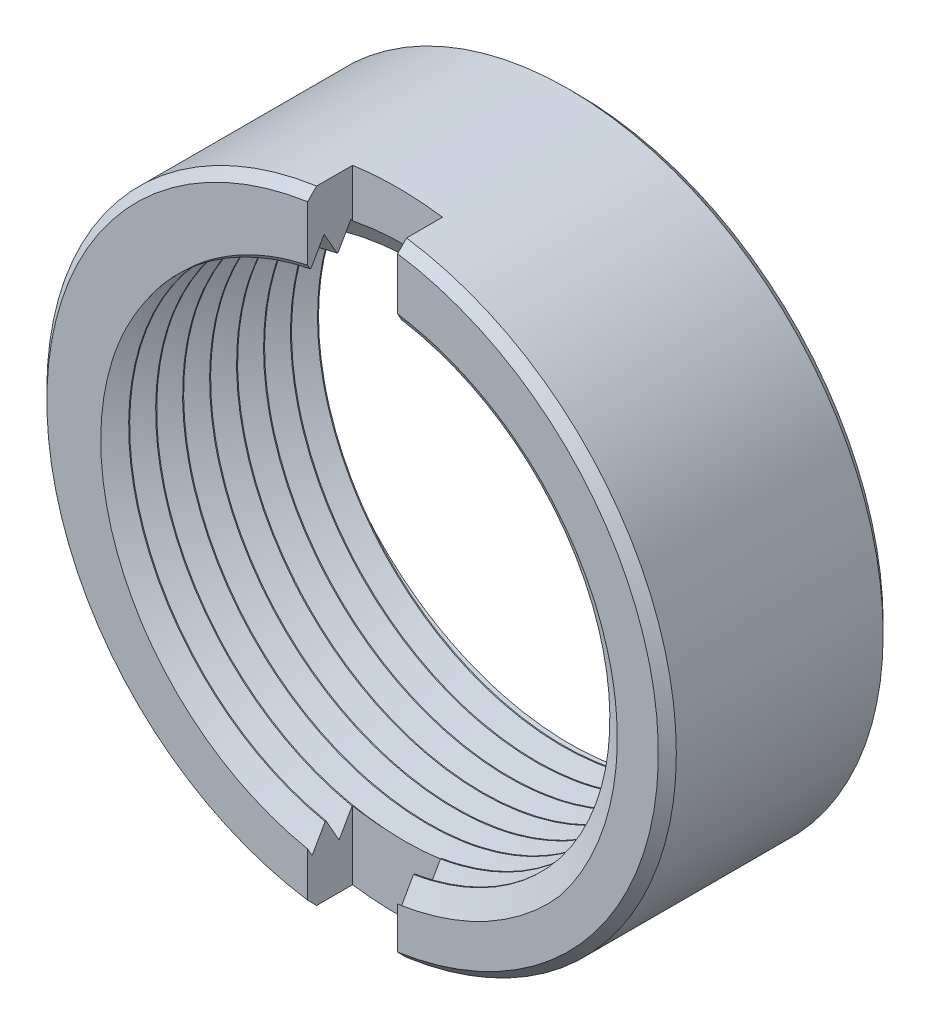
ISO-10303-21;
HEADER;
FILE_DESCRIPTION(('STEP AP214'),'2;1');
FILE_NAME('part.step','',(''),(''),'','','');
FILE_SCHEMA(('AUTOMOTIVE_DESIGN { 1 0 10303 214 1 1 1 1 }'));
ENDSEC;
DATA;
#1=APPLICATION_CONTEXT('core data for automotive mechanical design processes');
#2=APPLICATION_PROTOCOL_DEFINITION('international standard','automotive_design',2000,#1);
#3=PRODUCT_CONTEXT('',#1,'mechanical');
#4=PRODUCT('Part','Part','',(#3));
#5=PRODUCT_RELATED_PRODUCT_CATEGORY('part','',(#4));
#6=PRODUCT_DEFINITION_FORMATION('','',#4);
#7=PRODUCT_DEFINITION_CONTEXT('part definition',#1,'design');
#8=PRODUCT_DEFINITION('design','',#6,#7);
#9=PRODUCT_DEFINITION_SHAPE('','',#8);
#10=(LENGTH_UNIT() NAMED_UNIT(*) SI_UNIT(.MILLI.,.METRE.));
#11=(NAMED_UNIT(*) PLANE_ANGLE_UNIT() SI_UNIT($,.RADIAN.));
#12=(NAMED_UNIT(*) SI_UNIT($,.STERADIAN.) SOLID_ANGLE_UNIT());
#13=UNCERTAINTY_MEASURE_WITH_UNIT(LENGTH_MEASURE(1.E-05),#10,'distance_accuracy_value','');
#14=(GEOMETRIC_REPRESENTATION_CONTEXT(3) GLOBAL_UNCERTAINTY_ASSIGNED_CONTEXT((#13)) GLOBAL_UNIT_ASSIGNED_CONTEXT((#10,
#11,#12)) REPRESENTATION_CONTEXT('',''));
#15=CARTESIAN_POINT('',(0.,0.,0.));
#16=DIRECTION('',(0.,0.,1.));
#17=DIRECTION('',(1.,0.,0.));
#18=AXIS2_PLACEMENT_3D('',#15,#16,#17);
#19=CARTESIAN_POINT('',(0.,0.,-5.));
#20=DIRECTION('',(0.,0.,1.));
#21=DIRECTION('',(1.,0.,0.));
#22=AXIS2_PLACEMENT_3D('',#19,#20,#21);
#23=CYLINDRICAL_SURFACE('',#22,5.5);
#24=CARTESIAN_POINT('',(-3.8890872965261,3.88908729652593,1.18058812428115));
#25=CARTESIAN_POINT('',(-1.6437216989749,6.13445289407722,1.13058812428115));
#26=CARTESIAN_POINT('',(1.42350474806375,5.31259204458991,1.08058812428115));
#27=CARTESIAN_POINT('',(4.4907311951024,4.49073119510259,1.03058812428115));
#28=CARTESIAN_POINT('',(5.31259204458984,1.42350474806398,0.980588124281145));
#29=CARTESIAN_POINT('',(6.13445289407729,-1.64372169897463,0.930588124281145));
#30=CARTESIAN_POINT('',(3.8890872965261,-3.88908729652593,0.880588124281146));
#31=CARTESIAN_POINT('',(1.6437216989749,-6.13445289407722,0.830588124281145));
#32=CARTESIAN_POINT('',(-1.42350474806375,-5.31259204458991,0.780588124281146));
#33=CARTESIAN_POINT('',(-4.4907311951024,-4.49073119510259,0.730588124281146));
#34=CARTESIAN_POINT('',(-5.31259204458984,-1.42350474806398,0.680588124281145));
#35=CARTESIAN_POINT('',(-6.1344528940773,1.64372169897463,0.630588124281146));
#36=CARTESIAN_POINT('',(-3.8890872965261,3.88908729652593,0.580588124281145));
#37=CARTESIAN_POINT('',(-1.6437216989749,6.13445289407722,0.530588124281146));
#38=CARTESIAN_POINT('',(1.42350474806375,5.31259204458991,0.480588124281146));
#39=CARTESIAN_POINT('',(4.4907311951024,4.49073119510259,0.430588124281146));
#40=CARTESIAN_POINT('',(5.31259204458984,1.42350474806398,0.380588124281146));
#41=CARTESIAN_POINT('',(6.13445289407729,-1.64372169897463,0.330588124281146));
#42=CARTESIAN_POINT('',(3.8890872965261,-3.88908729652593,0.280588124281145));
#43=CARTESIAN_POINT('',(1.6437216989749,-6.13445289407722,0.230588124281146));
#44=CARTESIAN_POINT('',(-1.42350474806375,-5.31259204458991,0.180588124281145));
#45=CARTESIAN_POINT('',(-4.4907311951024,-4.49073119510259,0.130588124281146));
#46=CARTESIAN_POINT('',(-5.31259204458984,-1.42350474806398,0.0805881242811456));
#47=CARTESIAN_POINT('',(-6.1344528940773,1.64372169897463,0.0305881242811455));
#48=CARTESIAN_POINT('',(-3.8890872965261,3.88908729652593,-0.0194118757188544));
#49=CARTESIAN_POINT('',(-1.6437216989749,6.13445289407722,-0.0694118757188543));
#50=CARTESIAN_POINT('',(1.42350474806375,5.31259204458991,-0.119411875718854));
#51=CARTESIAN_POINT('',(4.4907311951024,4.49073119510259,-0.169411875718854));
#52=CARTESIAN_POINT('',(5.31259204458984,1.42350474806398,-0.219411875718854));
#53=CARTESIAN_POINT('',(6.13445289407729,-1.64372169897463,-0.269411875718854));
#54=CARTESIAN_POINT('',(3.8890872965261,-3.88908729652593,-0.319411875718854));
#55=CARTESIAN_POINT('',(1.6437216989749,-6.13445289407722,-0.369411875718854));
#56=CARTESIAN_POINT('',(-1.42350474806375,-5.31259204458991,-0.419411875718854));
#57=CARTESIAN_POINT('',(-4.4907311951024,-4.49073119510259,-0.469411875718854));
#58=CARTESIAN_POINT('',(-5.31259204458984,-1.42350474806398,-0.519411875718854));
#59=CARTESIAN_POINT('',(-6.1344528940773,1.64372169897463,-0.569411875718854));
#60=CARTESIAN_POINT('',(-3.8890872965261,3.88908729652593,-0.619411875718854));
#61=CARTESIAN_POINT('',(-1.6437216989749,6.13445289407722,-0.669411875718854));
#62=CARTESIAN_POINT('',(1.42350474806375,5.31259204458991,-0.719411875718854));
#63=CARTESIAN_POINT('',(4.4907311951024,4.49073119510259,-0.769411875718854));
#64=CARTESIAN_POINT('',(5.31259204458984,1.42350474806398,-0.819411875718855));
#65=CARTESIAN_POINT('',(6.13445289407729,-1.64372169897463,-0.869411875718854));
#66=CARTESIAN_POINT('',(3.8890872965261,-3.88908729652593,-0.919411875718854));
#67=CARTESIAN_POINT('',(1.6437216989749,-6.13445289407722,-0.969411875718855));
#68=CARTESIAN_POINT('',(-1.42350474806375,-5.31259204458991,-1.01941187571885));
#69=CARTESIAN_POINT('',(-4.4907311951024,-4.49073119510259,-1.06941187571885));
#70=CARTESIAN_POINT('',(-5.31259204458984,-1.42350474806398,-1.11941187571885));
#71=CARTESIAN_POINT('',(-6.1344528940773,1.64372169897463,-1.16941187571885));
#72=CARTESIAN_POINT('',(-3.8890872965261,3.88908729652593,-1.21941187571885));
#73=CARTESIAN_POINT('',(-1.6437216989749,6.13445289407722,-1.26941187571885));
#74=CARTESIAN_POINT('',(1.42350474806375,5.31259204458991,-1.31941187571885));
#75=CARTESIAN_POINT('',(4.4907311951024,4.49073119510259,-1.36941187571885));
#76=CARTESIAN_POINT('',(5.31259204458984,1.42350474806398,-1.41941187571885));
#77=CARTESIAN_POINT('',(6.13445289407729,-1.64372169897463,-1.46941187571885));
#78=CARTESIAN_POINT('',(3.8890872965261,-3.88908729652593,-1.51941187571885));
#79=CARTESIAN_POINT('',(1.6437216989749,-6.13445289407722,-1.56941187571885));
#80=CARTESIAN_POINT('',(-1.42350474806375,-5.31259204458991,-1.61941187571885));
#81=CARTESIAN_POINT('',(-4.4907311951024,-4.49073119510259,-1.66941187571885));
#82=CARTESIAN_POINT('',(-5.31259204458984,-1.42350474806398,-1.71941187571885));
#83=CARTESIAN_POINT('',(-6.1344528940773,1.64372169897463,-1.76941187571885));
#84=CARTESIAN_POINT('',(-3.8890872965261,3.88908729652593,-1.81941187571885));
#85=CARTESIAN_POINT('',(-1.6437216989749,6.13445289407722,-1.86941187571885));
#86=CARTESIAN_POINT('',(1.42350474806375,5.31259204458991,-1.91941187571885));
#87=CARTESIAN_POINT('',(4.4907311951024,4.49073119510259,-1.96941187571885));
#88=CARTESIAN_POINT('',(5.31259204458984,1.42350474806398,-2.01941187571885));
#89=CARTESIAN_POINT('',(6.13445289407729,-1.64372169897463,-2.06941187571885));
#90=CARTESIAN_POINT('',(3.8890872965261,-3.88908729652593,-2.11941187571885));
#91=CARTESIAN_POINT('',(1.6437216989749,-6.13445289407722,-2.16941187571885));
#92=CARTESIAN_POINT('',(-1.42350474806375,-5.31259204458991,-2.21941187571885));
#93=CARTESIAN_POINT('',(-4.4907311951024,-4.49073119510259,-2.26941187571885));
#94=CARTESIAN_POINT('',(-5.31259204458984,-1.42350474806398,-2.31941187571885));
#95=CARTESIAN_POINT('',(-6.1344528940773,1.64372169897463,-2.36941187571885));
#96=CARTESIAN_POINT('',(-3.8890872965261,3.88908729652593,-2.41941187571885));
#97=CARTESIAN_POINT('',(-1.6437216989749,6.13445289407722,-2.46941187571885));
#98=CARTESIAN_POINT('',(1.42350474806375,5.31259204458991,-2.51941187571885));
#99=CARTESIAN_POINT('',(4.4907311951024,4.49073119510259,-2.56941187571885));
#100=CARTESIAN_POINT('',(5.31259204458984,1.42350474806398,-2.61941187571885));
#101=CARTESIAN_POINT('',(6.13445289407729,-1.64372169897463,-2.66941187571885));
#102=CARTESIAN_POINT('',(3.8890872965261,-3.88908729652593,-2.71941187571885));
#103=CARTESIAN_POINT('',(1.6437216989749,-6.13445289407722,-2.76941187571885));
#104=CARTESIAN_POINT('',(-1.42350474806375,-5.31259204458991,-2.81941187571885));
#105=CARTESIAN_POINT('',(-4.4907311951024,-4.49073119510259,-2.86941187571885));
#106=CARTESIAN_POINT('',(-5.31259204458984,-1.42350474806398,-2.91941187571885));
#107=CARTESIAN_POINT('',(-6.1344528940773,1.64372169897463,-2.96941187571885));
#108=CARTESIAN_POINT('',(-3.8890872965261,3.88908729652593,-3.01941187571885));
#109=CARTESIAN_POINT('',(-1.6437216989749,6.13445289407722,-3.06941187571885));
#110=CARTESIAN_POINT('',(1.42350474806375,5.31259204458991,-3.11941187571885));
#111=CARTESIAN_POINT('',(4.4907311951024,4.49073119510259,-3.16941187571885));
#112=CARTESIAN_POINT('',(5.31259204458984,1.42350474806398,-3.21941187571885));
#113=CARTESIAN_POINT('',(6.13445289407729,-1.64372169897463,-3.26941187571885));
#114=CARTESIAN_POINT('',(3.8890872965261,-3.88908729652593,-3.31941187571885));
#115=CARTESIAN_POINT('',(1.6437216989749,-6.13445289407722,-3.36941187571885));
#116=CARTESIAN_POINT('',(-1.42350474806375,-5.31259204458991,-3.41941187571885));
#117=CARTESIAN_POINT('',(-4.4907311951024,-4.49073119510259,-3.46941187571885));
#118=CARTESIAN_POINT('',(-5.31259204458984,-1.42350474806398,-3.51941187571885));
#119=CARTESIAN_POINT('',(-6.1344528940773,1.64372169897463,-3.56941187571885));
#120=CARTESIAN_POINT('',(-3.8890872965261,3.88908729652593,-3.61941187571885));
#121=CARTESIAN_POINT('',(-1.6437216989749,6.13445289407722,-3.66941187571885));
#122=CARTESIAN_POINT('',(1.42350474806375,5.31259204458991,-3.71941187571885));
#123=CARTESIAN_POINT('',(4.4907311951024,4.49073119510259,-3.76941187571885));
#124=CARTESIAN_POINT('',(5.31259204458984,1.42350474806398,-3.81941187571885));
#125=CARTESIAN_POINT('',(6.13445289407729,-1.64372169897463,-3.86941187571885));
#126=CARTESIAN_POINT('',(3.8890872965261,-3.88908729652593,-3.91941187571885));
#127=CARTESIAN_POINT('',(1.6437216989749,-6.13445289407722,-3.96941187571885));
#128=CARTESIAN_POINT('',(-1.42350474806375,-5.31259204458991,-4.01941187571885));
#129=CARTESIAN_POINT('',(-4.4907311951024,-4.49073119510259,-4.06941187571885));
#130=CARTESIAN_POINT('',(-5.31259204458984,-1.42350474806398,-4.11941187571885));
#131=CARTESIAN_POINT('',(-6.1344528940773,1.64372169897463,-4.16941187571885));
#132=CARTESIAN_POINT('',(-3.8890872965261,3.88908729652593,-4.21941187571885));
#133=CARTESIAN_POINT('',(-1.6437216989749,6.13445289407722,-4.26941187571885));
#134=CARTESIAN_POINT('',(1.42350474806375,5.31259204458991,-4.31941187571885));
#135=CARTESIAN_POINT('',(4.4907311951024,4.49073119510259,-4.36941187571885));
#136=CARTESIAN_POINT('',(5.31259204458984,1.42350474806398,-4.41941187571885));
#137=CARTESIAN_POINT('',(6.13445289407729,-1.64372169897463,-4.46941187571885));
#138=CARTESIAN_POINT('',(3.8890872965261,-3.88908729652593,-4.51941187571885));
#139=CARTESIAN_POINT('',(1.6437216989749,-6.13445289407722,-4.56941187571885));
#140=CARTESIAN_POINT('',(-1.42350474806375,-5.31259204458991,-4.61941187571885));
#141=CARTESIAN_POINT('',(-4.4907311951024,-4.49073119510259,-4.66941187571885));
#142=CARTESIAN_POINT('',(-5.31259204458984,-1.42350474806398,-4.71941187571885));
#143=CARTESIAN_POINT('',(-6.1344528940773,1.64372169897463,-4.76941187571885));
#144=CARTESIAN_POINT('',(-3.8890872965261,3.88908729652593,-4.81941187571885));
#145=CARTESIAN_POINT('',(-1.6437216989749,6.13445289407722,-4.86941187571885));
#146=CARTESIAN_POINT('',(1.42350474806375,5.31259204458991,-4.91941187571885));
#147=CARTESIAN_POINT('',(4.4907311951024,4.49073119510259,-4.96941187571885));
#148=CARTESIAN_POINT('',(5.31259204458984,1.42350474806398,-5.01941187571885));
#149=CARTESIAN_POINT('',(6.13445289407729,-1.64372169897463,-5.06941187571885));
#150=CARTESIAN_POINT('',(3.8890872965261,-3.88908729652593,-5.11941187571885));
#151=CARTESIAN_POINT('',(1.6437216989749,-6.13445289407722,-5.16941187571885));
#152=CARTESIAN_POINT('',(-1.42350474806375,-5.31259204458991,-5.21941187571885));
#153=CARTESIAN_POINT('',(-4.4907311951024,-4.49073119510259,-5.26941187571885));
#154=CARTESIAN_POINT('',(-5.31259204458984,-1.42350474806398,-5.31941187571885));
#155=CARTESIAN_POINT('',(-6.1344528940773,1.64372169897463,-5.36941187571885));
#156=CARTESIAN_POINT('',(-3.8890872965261,3.88908729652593,-5.41941187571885));
#157=(BOUNDED_CURVE() B_SPLINE_CURVE(2,(#24,#25,#26,#27,#28,#29,#30,#31,#32,#33,#34,#35,#36,#37,
#38,#39,#40,#41,#42,#43,#44,#45,#46,#47,#48,#49,#50,#51,#52,#53,#54,#55,#56,#57,#58,#59,#60,#61,
#62,#63,#64,#65,#66,#67,#68,#69,#70,#71,#72,#73,#74,#75,#76,#77,#78,#79,#80,#81,#82,#83,#84,#85,
#86,#87,#88,#89,#90,#91,#92,#93,#94,#95,#96,#97,#98,#99,#100,#101,#102,#103,#104,#105,#106,#107,
#108,#109,#110,#111,#112,#113,#114,#115,#116,#117,#118,#119,#120,#121,#122,#123,#124,#125,#126,
#127,#128,#129,#130,#131,#132,#133,#134,#135,#136,#137,#138,#139,#140,#141,#142,#143,#144,#145,
#146,#147,#148,#149,#150,#151,#152,#153,#154,#155,#156),.UNSPECIFIED.,.F.,
.F.) B_SPLINE_CURVE_WITH_KNOTS((3,2,2,2,2,2,2,2,2,2,2,2,2,2,2,2,2,2,2,2,2,2,2,2,2,2,2,2,2,2,2,2,
2,2,2,2,2,2,2,2,2,2,2,2,2,2,2,2,2,2,2,2,2,2,2,2,2,2,2,2,2,2,2,2,2,2,3),(0.,0.0151515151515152,
0.0303030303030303,0.0454545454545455,0.0606060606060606,0.0757575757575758,0.0909090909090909,
0.106060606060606,0.121212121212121,0.136363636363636,0.151515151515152,0.166666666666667,
0.181818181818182,0.196969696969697,0.212121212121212,0.227272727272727,0.242424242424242,
0.257575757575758,0.272727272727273,0.287878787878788,0.303030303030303,0.318181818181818,
0.333333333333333,0.348484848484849,0.363636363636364,0.378787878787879,0.393939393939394,
0.409090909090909,0.424242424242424,0.439393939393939,0.454545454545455,0.46969696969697,
0.484848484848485,0.5,0.515151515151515,0.53030303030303,0.545454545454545,0.560606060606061,
0.575757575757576,0.590909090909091,0.606060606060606,0.621212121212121,0.636363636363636,
0.651515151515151,0.666666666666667,0.681818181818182,0.696969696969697,0.712121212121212,
0.727272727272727,0.742424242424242,0.757575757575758,0.772727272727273,0.787878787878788,
0.803030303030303,0.818181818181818,0.833333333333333,0.848484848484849,0.863636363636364,
0.878787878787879,0.893939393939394,0.909090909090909,0.924242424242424,0.939393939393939,
0.954545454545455,0.96969696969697,0.984848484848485,1.),
.UNSPECIFIED.) CURVE() GEOMETRIC_REPRESENTATION_ITEM() RATIONAL_B_SPLINE_CURVE((1.,
0.866025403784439,1.,0.866025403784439,1.,0.866025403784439,1.,0.866025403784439,1.,
0.866025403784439,1.,0.866025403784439,1.,0.866025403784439,1.,0.866025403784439,1.,
0.866025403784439,1.,0.866025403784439,1.,0.866025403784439,1.,0.866025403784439,1.,
0.866025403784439,1.,0.866025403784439,1.,0.866025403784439,1.,0.866025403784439,1.,
0.866025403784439,1.,0.866025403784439,1.,0.866025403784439,1.,0.866025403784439,1.,
0.866025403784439,1.,0.866025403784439,1.,0.866025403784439,1.,0.866025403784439,1.,
0.866025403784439,1.,0.866025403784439,1.,0.866025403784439,1.,0.866025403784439,1.,
0.866025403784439,1.,0.866025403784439,1.,0.866025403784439,1.,0.866025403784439,1.,
0.866025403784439,1.,0.866025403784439,1.,0.866025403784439,1.,0.866025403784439,1.,
0.866025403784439,1.,0.866025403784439,1.,0.866025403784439,1.,0.866025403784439,1.,
0.866025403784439,1.,0.866025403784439,1.,0.866025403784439,1.,0.866025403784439,1.,
0.866025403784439,1.,0.866025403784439,1.,0.866025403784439,1.,0.866025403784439,1.,
0.866025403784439,1.,0.866025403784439,1.,0.866025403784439,1.,0.866025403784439,1.,
0.866025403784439,1.,0.866025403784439,1.,0.866025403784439,1.,0.866025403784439,1.,
0.866025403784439,1.,0.866025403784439,1.,0.866025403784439,1.,0.866025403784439,1.,
0.866025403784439,1.,0.866025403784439,1.,0.866025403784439,1.,0.866025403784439,1.,
0.866025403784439,1.,0.866025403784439,1.)) REPRESENTATION_ITEM(''));
#158=CARTESIAN_POINT('',(-4.6225343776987,2.98029795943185,0.));
#159=VERTEX_POINT('',#158);
#160=CARTESIAN_POINT('',(-0.999999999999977,5.40832691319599,-0.0773000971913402));
#161=VERTEX_POINT('',#160);
#162=EDGE_CURVE('E488',#159,#161,#157,.T.);
#163=ORIENTED_EDGE('',*,*,#162,.T.);
#164=DIRECTION('',(0.,0.,1.));
#165=VECTOR('',#164,1.);
#166=CARTESIAN_POINT('',(-1.,5.40832691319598,-5.));
#167=LINE('',#166,#165);
#168=CARTESIAN_POINT('',(-1.,5.40832691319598,-0.0546503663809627));
#169=VERTEX_POINT('',#168);
#170=EDGE_CURVE('E396',#161,#169,#167,.T.);
#171=ORIENTED_EDGE('',*,*,#170,.T.);
#172=CARTESIAN_POINT('',(-3.8890872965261,3.88908729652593,0.603237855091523));
#173=CARTESIAN_POINT('',(-1.6437216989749,6.13445289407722,0.553237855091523));
#174=CARTESIAN_POINT('',(1.42350474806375,5.31259204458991,0.503237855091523));
#175=CARTESIAN_POINT('',(4.4907311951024,4.49073119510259,0.453237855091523));
#176=CARTESIAN_POINT('',(5.31259204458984,1.42350474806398,0.403237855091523));
#177=CARTESIAN_POINT('',(6.13445289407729,-1.64372169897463,0.353237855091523));
#178=CARTESIAN_POINT('',(3.8890872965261,-3.88908729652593,0.303237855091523));
#179=CARTESIAN_POINT('',(1.6437216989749,-6.13445289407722,0.253237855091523));
#180=CARTESIAN_POINT('',(-1.42350474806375,-5.31259204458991,0.203237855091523));
#181=CARTESIAN_POINT('',(-4.4907311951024,-4.49073119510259,0.153237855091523));
#182=CARTESIAN_POINT('',(-5.31259204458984,-1.42350474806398,0.103237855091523));
#183=CARTESIAN_POINT('',(-6.1344528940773,1.64372169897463,0.0532378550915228));
#184=CARTESIAN_POINT('',(-3.8890872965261,3.88908729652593,0.00323785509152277));
#185=CARTESIAN_POINT('',(-1.6437216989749,6.13445289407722,-0.0467621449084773));
#186=CARTESIAN_POINT('',(1.42350474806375,5.31259204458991,-0.0967621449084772));
#187=CARTESIAN_POINT('',(4.4907311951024,4.49073119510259,-0.146762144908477));
#188=CARTESIAN_POINT('',(5.31259204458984,1.42350474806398,-0.196762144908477));
#189=CARTESIAN_POINT('',(6.13445289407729,-1.64372169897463,-0.246762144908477));
#190=CARTESIAN_POINT('',(3.8890872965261,-3.88908729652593,-0.296762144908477));
#191=CARTESIAN_POINT('',(1.6437216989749,-6.13445289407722,-0.346762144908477));
#192=CARTESIAN_POINT('',(-1.42350474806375,-5.31259204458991,-0.396762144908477));
#193=CARTESIAN_POINT('',(-4.4907311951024,-4.49073119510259,-0.446762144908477));
#194=CARTESIAN_POINT('',(-5.31259204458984,-1.42350474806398,-0.496762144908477));
#195=CARTESIAN_POINT('',(-6.1344528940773,1.64372169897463,-0.546762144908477));
#196=CARTESIAN_POINT('',(-3.8890872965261,3.88908729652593,-0.596762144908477));
#197=CARTESIAN_POINT('',(-1.6437216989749,6.13445289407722,-0.646762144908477));
#198=CARTESIAN_POINT('',(1.42350474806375,5.31259204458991,-0.696762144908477));
#199=CARTESIAN_POINT('',(4.4907311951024,4.49073119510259,-0.746762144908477));
#200=CARTESIAN_POINT('',(5.31259204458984,1.42350474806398,-0.796762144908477));
#201=CARTESIAN_POINT('',(6.13445289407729,-1.64372169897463,-0.846762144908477));
#202=CARTESIAN_POINT('',(3.8890872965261,-3.88908729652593,-0.896762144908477));
#203=CARTESIAN_POINT('',(1.6437216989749,-6.13445289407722,-0.946762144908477));
#204=CARTESIAN_POINT('',(-1.42350474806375,-5.31259204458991,-0.996762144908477));
#205=CARTESIAN_POINT('',(-4.4907311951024,-4.49073119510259,-1.04676214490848));
#206=CARTESIAN_POINT('',(-5.31259204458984,-1.42350474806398,-1.09676214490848));
#207=CARTESIAN_POINT('',(-6.1344528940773,1.64372169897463,-1.14676214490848));
#208=CARTESIAN_POINT('',(-3.8890872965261,3.88908729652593,-1.19676214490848));
#209=CARTESIAN_POINT('',(-1.6437216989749,6.13445289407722,-1.24676214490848));
#210=CARTESIAN_POINT('',(1.42350474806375,5.31259204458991,-1.29676214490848));
#211=CARTESIAN_POINT('',(4.4907311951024,4.49073119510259,-1.34676214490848));
#212=CARTESIAN_POINT('',(5.31259204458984,1.42350474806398,-1.39676214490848));
#213=CARTESIAN_POINT('',(6.13445289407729,-1.64372169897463,-1.44676214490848));
#214=CARTESIAN_POINT('',(3.8890872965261,-3.88908729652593,-1.49676214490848));
#215=CARTESIAN_POINT('',(1.6437216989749,-6.13445289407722,-1.54676214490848));
#216=CARTESIAN_POINT('',(-1.42350474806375,-5.31259204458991,-1.59676214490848));
#217=CARTESIAN_POINT('',(-4.4907311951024,-4.49073119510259,-1.64676214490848));
#218=CARTESIAN_POINT('',(-5.31259204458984,-1.42350474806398,-1.69676214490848));
#219=CARTESIAN_POINT('',(-6.1344528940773,1.64372169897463,-1.74676214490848));
#220=CARTESIAN_POINT('',(-3.8890872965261,3.88908729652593,-1.79676214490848));
#221=CARTESIAN_POINT('',(-1.6437216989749,6.13445289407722,-1.84676214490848));
#222=CARTESIAN_POINT('',(1.42350474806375,5.31259204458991,-1.89676214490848));
#223=CARTESIAN_POINT('',(4.4907311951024,4.49073119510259,-1.94676214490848));
#224=CARTESIAN_POINT('',(5.31259204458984,1.42350474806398,-1.99676214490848));
#225=CARTESIAN_POINT('',(6.13445289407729,-1.64372169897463,-2.04676214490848));
#226=CARTESIAN_POINT('',(3.8890872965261,-3.88908729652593,-2.09676214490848));
#227=CARTESIAN_POINT('',(1.6437216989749,-6.13445289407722,-2.14676214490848));
#228=CARTESIAN_POINT('',(-1.42350474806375,-5.31259204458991,-2.19676214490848));
#229=CARTESIAN_POINT('',(-4.4907311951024,-4.49073119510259,-2.24676214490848));
#230=CARTESIAN_POINT('',(-5.31259204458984,-1.42350474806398,-2.29676214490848));
#231=CARTESIAN_POINT('',(-6.1344528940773,1.64372169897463,-2.34676214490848));
#232=CARTESIAN_POINT('',(-3.8890872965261,3.88908729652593,-2.39676214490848));
#233=CARTESIAN_POINT('',(-1.6437216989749,6.13445289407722,-2.44676214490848));
#234=CARTESIAN_POINT('',(1.42350474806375,5.31259204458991,-2.49676214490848));
#235=CARTESIAN_POINT('',(4.4907311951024,4.49073119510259,-2.54676214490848));
#236=CARTESIAN_POINT('',(5.31259204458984,1.42350474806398,-2.59676214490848));
#237=CARTESIAN_POINT('',(6.13445289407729,-1.64372169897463,-2.64676214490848));
#238=CARTESIAN_POINT('',(3.8890872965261,-3.88908729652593,-2.69676214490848));
#239=CARTESIAN_POINT('',(1.6437216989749,-6.13445289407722,-2.74676214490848));
#240=CARTESIAN_POINT('',(-1.42350474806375,-5.31259204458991,-2.79676214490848));
#241=CARTESIAN_POINT('',(-4.4907311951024,-4.49073119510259,-2.84676214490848));
#242=CARTESIAN_POINT('',(-5.31259204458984,-1.42350474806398,-2.89676214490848));
#243=CARTESIAN_POINT('',(-6.1344528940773,1.64372169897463,-2.94676214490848));
#244=CARTESIAN_POINT('',(-3.8890872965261,3.88908729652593,-2.99676214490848));
#245=CARTESIAN_POINT('',(-1.6437216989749,6.13445289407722,-3.04676214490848));
#246=CARTESIAN_POINT('',(1.42350474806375,5.31259204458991,-3.09676214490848));
#247=CARTESIAN_POINT('',(4.4907311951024,4.49073119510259,-3.14676214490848));
#248=CARTESIAN_POINT('',(5.31259204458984,1.42350474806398,-3.19676214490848));
#249=CARTESIAN_POINT('',(6.13445289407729,-1.64372169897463,-3.24676214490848));
#250=CARTESIAN_POINT('',(3.8890872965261,-3.88908729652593,-3.29676214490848));
#251=CARTESIAN_POINT('',(1.6437216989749,-6.13445289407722,-3.34676214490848));
#252=CARTESIAN_POINT('',(-1.42350474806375,-5.31259204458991,-3.39676214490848));
#253=CARTESIAN_POINT('',(-4.4907311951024,-4.49073119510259,-3.44676214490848));
#254=CARTESIAN_POINT('',(-5.31259204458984,-1.42350474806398,-3.49676214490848));
#255=CARTESIAN_POINT('',(-6.1344528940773,1.64372169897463,-3.54676214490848));
#256=CARTESIAN_POINT('',(-3.8890872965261,3.88908729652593,-3.59676214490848));
#257=CARTESIAN_POINT('',(-1.6437216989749,6.13445289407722,-3.64676214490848));
#258=CARTESIAN_POINT('',(1.42350474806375,5.31259204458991,-3.69676214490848));
#259=CARTESIAN_POINT('',(4.4907311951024,4.49073119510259,-3.74676214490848));
#260=CARTESIAN_POINT('',(5.31259204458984,1.42350474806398,-3.79676214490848));
#261=CARTESIAN_POINT('',(6.13445289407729,-1.64372169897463,-3.84676214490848));
#262=CARTESIAN_POINT('',(3.8890872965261,-3.88908729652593,-3.89676214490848));
#263=CARTESIAN_POINT('',(1.6437216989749,-6.13445289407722,-3.94676214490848));
#264=CARTESIAN_POINT('',(-1.42350474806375,-5.31259204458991,-3.99676214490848));
#265=CARTESIAN_POINT('',(-4.4907311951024,-4.49073119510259,-4.04676214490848));
#266=CARTESIAN_POINT('',(-5.31259204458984,-1.42350474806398,-4.09676214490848));
#267=CARTESIAN_POINT('',(-6.1344528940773,1.64372169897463,-4.14676214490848));
#268=CARTESIAN_POINT('',(-3.8890872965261,3.88908729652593,-4.19676214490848));
#269=CARTESIAN_POINT('',(-1.6437216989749,6.13445289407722,-4.24676214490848));
#270=CARTESIAN_POINT('',(1.42350474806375,5.31259204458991,-4.29676214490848));
#271=CARTESIAN_POINT('',(4.4907311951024,4.49073119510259,-4.34676214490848));
#272=CARTESIAN_POINT('',(5.31259204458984,1.42350474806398,-4.39676214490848));
#273=CARTESIAN_POINT('',(6.13445289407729,-1.64372169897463,-4.44676214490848));
#274=CARTESIAN_POINT('',(3.8890872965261,-3.88908729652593,-4.49676214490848));
#275=CARTESIAN_POINT('',(1.6437216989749,-6.13445289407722,-4.54676214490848));
#276=CARTESIAN_POINT('',(-1.42350474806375,-5.31259204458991,-4.59676214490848));
#277=CARTESIAN_POINT('',(-4.4907311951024,-4.49073119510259,-4.64676214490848));
#278=CARTESIAN_POINT('',(-5.31259204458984,-1.42350474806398,-4.69676214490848));
#279=CARTESIAN_POINT('',(-6.1344528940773,1.64372169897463,-4.74676214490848));
#280=CARTESIAN_POINT('',(-3.8890872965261,3.88908729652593,-4.79676214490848));
#281=CARTESIAN_POINT('',(-1.6437216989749,6.13445289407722,-4.84676214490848));
#282=CARTESIAN_POINT('',(1.42350474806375,5.31259204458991,-4.89676214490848));
#283=CARTESIAN_POINT('',(4.4907311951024,4.49073119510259,-4.94676214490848));
#284=CARTESIAN_POINT('',(5.31259204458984,1.42350474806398,-4.99676214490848));
#285=CARTESIAN_POINT('',(6.13445289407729,-1.64372169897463,-5.04676214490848));
#286=CARTESIAN_POINT('',(3.8890872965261,-3.88908729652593,-5.09676214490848));
#287=CARTESIAN_POINT('',(1.6437216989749,-6.13445289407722,-5.14676214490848));
#288=CARTESIAN_POINT('',(-1.42350474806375,-5.31259204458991,-5.19676214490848));
#289=CARTESIAN_POINT('',(-4.4907311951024,-4.49073119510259,-5.24676214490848));
#290=CARTESIAN_POINT('',(-5.31259204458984,-1.42350474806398,-5.29676214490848));
#291=CARTESIAN_POINT('',(-6.1344528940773,1.64372169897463,-5.34676214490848));
#292=CARTESIAN_POINT('',(-3.8890872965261,3.88908729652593,-5.39676214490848));
#293=CARTESIAN_POINT('',(-1.6437216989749,6.13445289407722,-5.44676214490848));
#294=CARTESIAN_POINT('',(1.42350474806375,5.31259204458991,-5.49676214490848));
#295=CARTESIAN_POINT('',(4.4907311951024,4.49073119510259,-5.54676214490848));
#296=CARTESIAN_POINT('',(5.31259204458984,1.42350474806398,-5.59676214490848));
#297=CARTESIAN_POINT('',(6.13445289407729,-1.64372169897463,-5.64676214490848));
#298=CARTESIAN_POINT('',(3.8890872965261,-3.88908729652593,-5.69676214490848));
#299=CARTESIAN_POINT('',(1.6437216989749,-6.13445289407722,-5.74676214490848));
#300=CARTESIAN_POINT('',(-1.42350474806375,-5.31259204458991,-5.79676214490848));
#301=CARTESIAN_POINT('',(-4.4907311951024,-4.49073119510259,-5.84676214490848));
#302=CARTESIAN_POINT('',(-5.31259204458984,-1.42350474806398,-5.89676214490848));
#303=CARTESIAN_POINT('',(-6.1344528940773,1.64372169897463,-5.94676214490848));
#304=CARTESIAN_POINT('',(-3.8890872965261,3.88908729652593,-5.99676214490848));
#305=(BOUNDED_CURVE() B_SPLINE_CURVE(2,(#172,#173,#174,#175,#176,#177,#178,#179,#180,#181,#182,
#183,#184,#185,#186,#187,#188,#189,#190,#191,#192,#193,#194,#195,#196,#197,#198,#199,#200,#201,
#202,#203,#204,#205,#206,#207,#208,#209,#210,#211,#212,#213,#214,#215,#216,#217,#218,#219,#220,
#221,#222,#223,#224,#225,#226,#227,#228,#229,#230,#231,#232,#233,#234,#235,#236,#237,#238,#239,
#240,#241,#242,#243,#244,#245,#246,#247,#248,#249,#250,#251,#252,#253,#254,#255,#256,#257,#258,
#259,#260,#261,#262,#263,#264,#265,#266,#267,#268,#269,#270,#271,#272,#273,#274,#275,#276,#277,
#278,#279,#280,#281,#282,#283,#284,#285,#286,#287,#288,#289,#290,#291,#292,#293,#294,#295,#296,
#297,#298,#299,#300,#301,#302,#303,#304),.UNSPECIFIED.,.F.,.F.) B_SPLINE_CURVE_WITH_KNOTS((3,2,
2,2,2,2,2,2,2,2,2,2,2,2,2,2,2,2,2,2,2,2,2,2,2,2,2,2,2,2,2,2,2,2,2,2,2,2,2,2,2,2,2,2,2,2,2,2,2,2,
2,2,2,2,2,2,2,2,2,2,2,2,2,2,2,2,3),(0.,0.0151515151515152,0.0303030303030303,0.0454545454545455,
0.0606060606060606,0.0757575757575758,0.0909090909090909,0.106060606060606,0.121212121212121,
0.136363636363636,0.151515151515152,0.166666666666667,0.181818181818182,0.196969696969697,
0.212121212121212,0.227272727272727,0.242424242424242,0.257575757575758,0.272727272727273,
0.287878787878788,0.303030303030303,0.318181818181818,0.333333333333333,0.348484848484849,
0.363636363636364,0.378787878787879,0.393939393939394,0.409090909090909,0.424242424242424,
0.439393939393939,0.454545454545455,0.46969696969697,0.484848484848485,0.5,0.515151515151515,
0.53030303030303,0.545454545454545,0.560606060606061,0.575757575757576,0.590909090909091,
0.606060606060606,0.621212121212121,0.636363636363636,0.651515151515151,0.666666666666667,
0.681818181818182,0.696969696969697,0.712121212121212,0.727272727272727,0.742424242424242,
0.757575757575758,0.772727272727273,0.787878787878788,0.803030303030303,0.818181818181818,
0.833333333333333,0.848484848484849,0.863636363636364,0.878787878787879,0.893939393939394,
0.909090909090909,0.924242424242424,0.939393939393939,0.954545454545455,0.96969696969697,
0.984848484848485,1.),
.UNSPECIFIED.) CURVE() GEOMETRIC_REPRESENTATION_ITEM() RATIONAL_B_SPLINE_CURVE((1.,
0.866025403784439,1.,0.866025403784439,1.,0.866025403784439,1.,0.866025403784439,1.,
0.866025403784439,1.,0.866025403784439,1.,0.866025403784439,1.,0.866025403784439,1.,
0.866025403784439,1.,0.866025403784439,1.,0.866025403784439,1.,0.866025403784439,1.,
0.866025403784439,1.,0.866025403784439,1.,0.866025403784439,1.,0.866025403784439,1.,
0.866025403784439,1.,0.866025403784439,1.,0.866025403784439,1.,0.866025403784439,1.,
0.866025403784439,1.,0.866025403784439,1.,0.866025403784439,1.,0.866025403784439,1.,
0.866025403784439,1.,0.866025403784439,1.,0.866025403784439,1.,0.866025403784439,1.,
0.866025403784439,1.,0.866025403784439,1.,0.866025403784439,1.,0.866025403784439,1.,
0.866025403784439,1.,0.866025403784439,1.,0.866025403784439,1.,0.866025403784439,1.,
0.866025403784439,1.,0.866025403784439,1.,0.866025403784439,1.,0.866025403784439,1.,
0.866025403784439,1.,0.866025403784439,1.,0.866025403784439,1.,0.866025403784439,1.,
0.866025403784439,1.,0.866025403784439,1.,0.866025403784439,1.,0.866025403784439,1.,
0.866025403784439,1.,0.866025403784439,1.,0.866025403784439,1.,0.866025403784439,1.,
0.866025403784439,1.,0.866025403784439,1.,0.866025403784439,1.,0.866025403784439,1.,
0.866025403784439,1.,0.866025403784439,1.,0.866025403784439,1.,0.866025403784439,1.,
0.866025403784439,1.,0.866025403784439,1.,0.866025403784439,1.,0.866025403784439,1.,
0.866025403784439,1.,0.866025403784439,1.)) REPRESENTATION_ITEM(''));
#306=CARTESIAN_POINT('',(-3.74255887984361,4.03029192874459,0.));
#307=VERTEX_POINT('',#306);
#308=EDGE_CURVE('E492',#169,#307,#305,.F.);
#309=ORIENTED_EDGE('',*,*,#308,.T.);
#310=CARTESIAN_POINT('',(0.,0.,0.));
#311=DIRECTION('',(0.,0.,1.));
#312=DIRECTION('',(1.,0.,0.));
#313=AXIS2_PLACEMENT_3D('',#310,#311,#312);
#314=CIRCLE('',#313,5.5);
#315=EDGE_CURVE('E500',#307,#159,#314,.T.);
#316=ORIENTED_EDGE('',*,*,#315,.T.);
#317=EDGE_LOOP('',(#163,#171,#309,#316));
#318=FACE_BOUND('',#317,.T.);
#319=ADVANCED_FACE('F35',(#318),#23,.F.);
#320=CARTESIAN_POINT('',(-1.,5.40832691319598,-0.654650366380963));
#321=VERTEX_POINT('',#320);
#322=CARTESIAN_POINT('',(-0.999999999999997,-5.40832691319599,-0.389774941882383));
#323=VERTEX_POINT('',#322);
#324=EDGE_CURVE('E589',#321,#323,#305,.F.);
#325=ORIENTED_EDGE('',*,*,#324,.T.);
#326=DIRECTION('',(0.,0.,1.));
#327=VECTOR('',#326,1.);
#328=CARTESIAN_POINT('',(-0.999999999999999,-5.40832691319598,-5.));
#329=LINE('',#328,#327);
#330=CARTESIAN_POINT('',(-0.999999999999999,-5.40832691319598,-0.41242467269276));
#331=VERTEX_POINT('',#330);
#332=EDGE_CURVE('E627',#323,#331,#329,.F.);
#333=ORIENTED_EDGE('',*,*,#332,.T.);
#334=CARTESIAN_POINT('',(-0.999999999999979,5.40832691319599,-0.67730009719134));
#335=VERTEX_POINT('',#334);
#336=EDGE_CURVE('E489',#331,#335,#157,.T.);
#337=ORIENTED_EDGE('',*,*,#336,.T.);
#338=EDGE_CURVE('E626',#335,#321,#167,.T.);
#339=ORIENTED_EDGE('',*,*,#338,.T.);
#340=EDGE_LOOP('',(#325,#333,#337,#339));
#341=FACE_BOUND('',#340,.T.);
#342=ADVANCED_FACE('F568',(#341),#23,.F.);
#343=CARTESIAN_POINT('',(1.,-5.40832691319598,-0.954650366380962));
#344=VERTEX_POINT('',#343);
#345=CARTESIAN_POINT('',(1.,5.40832691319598,-0.689774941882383));
#346=VERTEX_POINT('',#345);
#347=EDGE_CURVE('E512',#344,#346,#305,.F.);
#348=ORIENTED_EDGE('',*,*,#347,.T.);
#349=DIRECTION('',(0.,0.,1.));
#350=VECTOR('',#349,1.);
#351=CARTESIAN_POINT('',(1.,5.40832691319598,-5.));
#352=LINE('',#351,#350);
#353=CARTESIAN_POINT('',(1.,5.40832691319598,-0.71242467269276));
#354=VERTEX_POINT('',#353);
#355=EDGE_CURVE('E529',#346,#354,#352,.F.);
#356=ORIENTED_EDGE('',*,*,#355,.T.);
#357=CARTESIAN_POINT('',(0.999999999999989,-5.40832691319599,-0.97730009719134));
#358=VERTEX_POINT('',#357);
#359=EDGE_CURVE('E495',#354,#358,#157,.T.);
#360=ORIENTED_EDGE('',*,*,#359,.T.);
#361=DIRECTION('',(0.,0.,1.));
#362=VECTOR('',#361,1.);
#363=CARTESIAN_POINT('',(1.,-5.40832691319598,-5.));
#364=LINE('',#363,#362);
#365=EDGE_CURVE('E464',#358,#344,#364,.T.);
#366=ORIENTED_EDGE('',*,*,#365,.T.);
#367=EDGE_LOOP('',(#348,#356,#360,#366));
#368=FACE_BOUND('',#367,.T.);
#369=ADVANCED_FACE('F573',(#368),#23,.F.);
#370=CARTESIAN_POINT('',(1.,-5.40832691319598,-0.354650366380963));
#371=VERTEX_POINT('',#370);
#372=CARTESIAN_POINT('',(1.,5.40832691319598,-0.0897749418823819));
#373=VERTEX_POINT('',#372);
#374=EDGE_CURVE('E591',#371,#373,#305,.F.);
#375=ORIENTED_EDGE('',*,*,#374,.T.);
#376=CARTESIAN_POINT('',(0.999999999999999,5.40832691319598,-0.11242467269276));
#377=VERTEX_POINT('',#376);
#378=EDGE_CURVE('E317',#373,#377,#352,.F.);
#379=ORIENTED_EDGE('',*,*,#378,.T.);
#380=CARTESIAN_POINT('',(0.999999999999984,-5.40832691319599,-0.37730009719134));
#381=VERTEX_POINT('',#380);
#382=EDGE_CURVE('E484',#377,#381,#157,.T.);
#383=ORIENTED_EDGE('',*,*,#382,.T.);
#384=EDGE_CURVE('E468',#381,#371,#364,.T.);
#385=ORIENTED_EDGE('',*,*,#384,.T.);
#386=EDGE_LOOP('',(#375,#379,#383,#385));
#387=FACE_BOUND('',#386,.T.);
#388=ADVANCED_FACE('F487',(#387),#23,.F.);
#389=CARTESIAN_POINT('',(0.,0.,0.));
#390=DIRECTION('',(0.,0.,1.));
#391=DIRECTION('',(1.,0.,0.));
#392=AXIS2_PLACEMENT_3D('',#389,#390,#391);
#393=PLANE('',#392);
#394=DIRECTION('',(0.,-1.,0.));
#395=VECTOR('',#394,1.);
#396=CARTESIAN_POINT('',(-1.,8.,0.));
#397=LINE('',#396,#395);
#398=CARTESIAN_POINT('',(-1.,6.72606868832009,0.));
#399=VERTEX_POINT('',#398);
#400=CARTESIAN_POINT('',(-1.,5.50511264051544,0.));
#401=VERTEX_POINT('',#400);
#402=EDGE_CURVE('E209',#399,#401,#397,.T.);
#403=ORIENTED_EDGE('',*,*,#402,.F.);
#404=CARTESIAN_POINT('',(0.,0.,0.));
#405=DIRECTION('',(0.,0.,1.));
#406=DIRECTION('',(1.,0.,0.));
#407=AXIS2_PLACEMENT_3D('',#404,#405,#406);
#408=CIRCLE('',#407,6.8);
#409=CARTESIAN_POINT('',(-0.999999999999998,-6.72606868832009,0.));
#410=VERTEX_POINT('',#409);
#411=EDGE_CURVE('E224',#399,#410,#408,.T.);
#412=ORIENTED_EDGE('',*,*,#411,.T.);
#413=CARTESIAN_POINT('',(-0.999999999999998,-5.74005656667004,0.));
#414=VERTEX_POINT('',#413);
#415=EDGE_CURVE('E228',#414,#410,#397,.T.);
#416=ORIENTED_EDGE('',*,*,#415,.F.);
#417=CARTESIAN_POINT('',(-4.62253437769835,2.98029795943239,0.));
#418=CARTESIAN_POINT('',(-4.68403685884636,2.89090421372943,0.));
#419=CARTESIAN_POINT('',(-4.7429020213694,2.79973327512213,0.));
#420=CARTESIAN_POINT('',(-4.85519668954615,2.61409088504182,0.));
#421=CARTESIAN_POINT('',(-4.90862565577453,2.5196191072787,0.));
#422=CARTESIAN_POINT('',(-5.06060937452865,2.23145156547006,0.));
#423=CARTESIAN_POINT('',(-5.15072628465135,2.0331993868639,0.));
#424=CARTESIAN_POINT('',(-5.28500992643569,1.68484227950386,0.));
#425=CARTESIAN_POINT('',(-5.33496850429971,1.53692101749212,0.));
#426=CARTESIAN_POINT('',(-5.42226896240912,1.23734425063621,0.));
#427=CARTESIAN_POINT('',(-5.45960844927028,1.08568804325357,0.));
#428=CARTESIAN_POINT('',(-5.52137288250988,0.779790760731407,0.));
#429=CARTESIAN_POINT('',(-5.54579911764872,0.6255499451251,0.));
#430=CARTESIAN_POINT('',(-5.5815821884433,0.315489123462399,0.));
#431=CARTESIAN_POINT('',(-5.59293324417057,0.159668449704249,0.));
#432=CARTESIAN_POINT('',(-5.60246202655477,-0.152300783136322,0.));
#433=CARTESIAN_POINT('',(-5.60064610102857,-0.308449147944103,0.));
#434=CARTESIAN_POINT('',(-5.58387362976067,-0.620036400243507,0.));
#435=CARTESIAN_POINT('',(-5.56891682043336,-0.775475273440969,0.));
#436=CARTESIAN_POINT('',(-5.52595307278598,-1.08457984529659,0.));
#437=CARTESIAN_POINT('',(-5.49794449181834,-1.23824531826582,0.));
#438=CARTESIAN_POINT('',(-5.44632959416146,-1.46652379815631,0.));
#439=CARTESIAN_POINT('',(-5.42752244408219,-1.54225250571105,0.));
#440=CARTESIAN_POINT('',(-5.38684205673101,-1.69290145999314,0.));
#441=CARTESIAN_POINT('',(-5.36496805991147,-1.76782150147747,0.));
#442=CARTESIAN_POINT('',(-5.29452818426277,-1.99191879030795,0.));
#443=CARTESIAN_POINT('',(-5.24131817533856,-2.13966544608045,0.));
#444=CARTESIAN_POINT('',(-5.12293623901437,-2.43031459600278,0.));
#445=CARTESIAN_POINT('',(-5.05776081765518,-2.5732156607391,0.));
#446=CARTESIAN_POINT('',(-4.91589567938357,-2.85316839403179,0.));
#447=CARTESIAN_POINT('',(-4.83920733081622,-2.99022075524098,0.));
#448=CARTESIAN_POINT('',(-4.67483082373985,-3.25756255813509,0.));
#449=CARTESIAN_POINT('',(-4.58714247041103,-3.38785187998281,0.));
#450=CARTESIAN_POINT('',(-4.39896250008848,-3.64404709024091,0.));
#451=CARTESIAN_POINT('',(-4.29819926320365,-3.76975360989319,0.));
#452=CARTESIAN_POINT('',(-4.08647433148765,-4.01218671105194,0.));
#453=CARTESIAN_POINT('',(-3.97551606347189,-4.12891628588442,0.));
#454=CARTESIAN_POINT('',(-3.74414972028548,-4.35262408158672,0.));
#455=CARTESIAN_POINT('',(-3.62374077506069,-4.45960140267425,0.));
#456=CARTESIAN_POINT('',(-3.37433733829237,-4.66303312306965,0.));
#457=CARTESIAN_POINT('',(-3.24534272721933,-4.75948737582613,0.));
#458=CARTESIAN_POINT('',(-2.97969962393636,-4.94117666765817,0.));
#459=CARTESIAN_POINT('',(-2.84305197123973,-5.02641293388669,0.));
#460=CARTESIAN_POINT('',(-2.56307389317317,-5.18506832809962,0.));
#461=CARTESIAN_POINT('',(-2.41974373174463,-5.25848792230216,0.));
#462=CARTESIAN_POINT('',(-2.12737342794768,-5.39300822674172,0.));
#463=CARTESIAN_POINT('',(-1.97833266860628,-5.45410760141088,0.));
#464=CARTESIAN_POINT('',(-1.75134608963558,-5.53617066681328,0.));
#465=CARTESIAN_POINT('',(-1.67510297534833,-5.56193004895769,0.));
#466=CARTESIAN_POINT('',(-1.52159841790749,-5.61021302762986,0.));
#467=CARTESIAN_POINT('',(-1.44433695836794,-5.63273657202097,0.));
#468=CARTESIAN_POINT('',(-1.21109853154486,-5.69559416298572,0.));
#469=CARTESIAN_POINT('',(-1.05380954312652,-5.73116415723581,0.));
#470=CARTESIAN_POINT('',(-0.7368667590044,-5.78929469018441,0.));
#471=CARTESIAN_POINT('',(-0.577212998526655,-5.81185542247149,0.));
#472=CARTESIAN_POINT('',(-0.256579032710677,-5.8438364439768,0.));
#473=CARTESIAN_POINT('',(-0.0955987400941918,-5.85325586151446,0.));
#474=CARTESIAN_POINT('',(0.226591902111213,-5.858882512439,0.));
#475=CARTESIAN_POINT('',(0.387802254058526,-5.8550896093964,0.));
#476=CARTESIAN_POINT('',(0.713999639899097,-5.83401808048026,0.));
#477=CARTESIAN_POINT('',(0.878961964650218,-5.81635478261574,0.));
#478=CARTESIAN_POINT('',(1.20687008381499,-5.76718763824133,0.));
#479=CARTESIAN_POINT('',(1.36981513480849,-5.73567883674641,0.));
#480=CARTESIAN_POINT('',(1.69248169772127,-5.65904132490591,0.));
#481=CARTESIAN_POINT('',(1.85220300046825,-5.61391173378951,0.));
#482=CARTESIAN_POINT('',(2.16727482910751,-5.51035446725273,0.));
#483=CARTESIAN_POINT('',(2.32262535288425,-5.4519267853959,0.));
#484=CARTESIAN_POINT('',(2.62794179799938,-5.32215083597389,0.));
#485=CARTESIAN_POINT('',(2.77790445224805,-5.25079488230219,0.));
#486=CARTESIAN_POINT('',(3.07122900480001,-5.09572098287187,0.));
#487=CARTESIAN_POINT('',(3.2145932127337,-5.01200740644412,0.));
#488=CARTESIAN_POINT('',(3.49362583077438,-4.83288181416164,0.));
#489=CARTESIAN_POINT('',(3.62930121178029,-4.7374806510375,0.));
#490=CARTESIAN_POINT('',(3.89208531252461,-4.53563362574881,0.));
#491=CARTESIAN_POINT('',(4.01919808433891,-4.42919304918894,0.));
#492=CARTESIAN_POINT('',(4.22428452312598,-4.24222106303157,0.));
#493=CARTESIAN_POINT('',(4.30482377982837,-4.16448393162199,0.));
#494=CARTESIAN_POINT('',(4.42226025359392,-4.04472940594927,0.));
#495=CARTESIAN_POINT('',(4.46081068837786,-4.00432398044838,0.));
#496=CARTESIAN_POINT('',(4.53678918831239,-3.92245765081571,0.));
#497=CARTESIAN_POINT('',(4.57421704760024,-3.88099655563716,0.));
#498=CARTESIAN_POINT('',(4.61106385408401,-3.83902202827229,0.));
#499=B_SPLINE_CURVE_WITH_KNOTS('',3,(#417,#418,#419,#420,#421,#422,#423,#424,#425,#426,#427,
#428,#429,#430,#431,#432,#433,#434,#435,#436,#437,#438,#439,#440,#441,#442,#443,#444,#445,#446,
#447,#448,#449,#450,#451,#452,#453,#454,#455,#456,#457,#458,#459,#460,#461,#462,#463,#464,#465,
#466,#467,#468,#469,#470,#471,#472,#473,#474,#475,#476,#477,#478,#479,#480,#481,#482,#483,#484,
#485,#486,#487,#488,#489,#490,#491,#492,#493,#494,#495,#496,#497,#498),.UNSPECIFIED.,.F.,.F.,(4,
2,2,2,2,2,2,2,2,2,2,2,2,2,2,2,2,2,2,2,2,2,2,2,2,2,2,2,2,2,2,2,2,2,2,2,2,2,2,2,4),(0.,
0.325413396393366,0.650859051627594,1.30245895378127,1.77035492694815,2.23833959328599,
2.70627754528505,3.17442227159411,3.64234131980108,4.1102697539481,4.57825709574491,
4.812287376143,5.04637572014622,5.51690676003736,5.98757541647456,6.45818817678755,
6.9288092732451,7.41155333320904,7.89413571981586,8.37676258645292,8.85939617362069,
9.34197692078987,9.82453862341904,10.307152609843,10.5485216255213,10.7898945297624,
11.2730916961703,11.7562816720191,12.2395036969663,12.7227307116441,13.2198538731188,
13.7171550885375,14.2144884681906,14.7118220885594,15.2094523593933,15.7069071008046,
16.2039033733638,16.7006627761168,17.0362976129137,17.2038155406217,17.371364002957),.UNSPECIFIED.);
#500=EDGE_CURVE('E346',#159,#414,#499,.T.);
#501=ORIENTED_EDGE('',*,*,#500,.F.);
#502=ORIENTED_EDGE('',*,*,#315,.F.);
#503=CARTESIAN_POINT('',(4.61106385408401,-3.83902202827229,0.));
#504=CARTESIAN_POINT('',(4.67820692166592,-3.75393631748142,0.));
#505=CARTESIAN_POINT('',(4.74300040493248,-3.66702971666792,0.));
#506=CARTESIAN_POINT('',(4.86773069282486,-3.4897899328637,0.));
#507=CARTESIAN_POINT('',(4.92766717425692,-3.39945652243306,0.));
#508=CARTESIAN_POINT('',(5.10006251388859,-3.12346314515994,0.));
#509=CARTESIAN_POINT('',(5.20496551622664,-2.93298970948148,0.));
#510=CARTESIAN_POINT('',(5.37128740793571,-2.58733812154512,0.));
#511=CARTESIAN_POINT('',(5.43714444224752,-2.43426260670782,0.));
#512=CARTESIAN_POINT('',(5.55576019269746,-2.12305174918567,0.));
#513=CARTESIAN_POINT('',(5.60851571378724,-1.96491518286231,0.));
#514=CARTESIAN_POINT('',(5.70052790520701,-1.64472490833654,0.));
#515=CARTESIAN_POINT('',(5.73978113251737,-1.48267021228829,0.));
#516=CARTESIAN_POINT('',(5.8045064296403,-1.15577134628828,0.));
#517=CARTESIAN_POINT('',(5.82997369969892,-0.990926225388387,0.));
#518=CARTESIAN_POINT('',(5.8669153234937,-0.659755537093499,0.));
#519=CARTESIAN_POINT('',(5.8783963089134,-0.493430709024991,0.));
#520=CARTESIAN_POINT('',(5.88730603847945,-0.160404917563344,0.));
#521=CARTESIAN_POINT('',(5.8847349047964,0.00629604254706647,0.));
#522=CARTESIAN_POINT('',(5.86555929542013,0.338915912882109,0.));
#523=CARTESIAN_POINT('',(5.84895206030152,0.504834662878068,0.));
#524=CARTESIAN_POINT('',(5.80182071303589,0.834653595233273,0.));
#525=CARTESIAN_POINT('',(5.77130089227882,0.998554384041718,0.));
#526=CARTESIAN_POINT('',(5.71523516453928,1.2421125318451,0.));
#527=CARTESIAN_POINT('',(5.69481168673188,1.32298050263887,0.));
#528=CARTESIAN_POINT('',(5.65058194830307,1.48376379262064,0.));
#529=CARTESIAN_POINT('',(5.62677658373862,1.56367935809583,0.));
#530=CARTESIAN_POINT('',(5.55016675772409,1.80176294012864,0.));
#531=CARTESIAN_POINT('',(5.49216281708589,1.95829303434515,0.));
#532=CARTESIAN_POINT('',(5.36282451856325,2.265637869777,0.));
#533=CARTESIAN_POINT('',(5.29149595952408,2.41645506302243,0.));
#534=CARTESIAN_POINT('',(5.13598139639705,2.7113869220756,0.));
#535=CARTESIAN_POINT('',(5.0517907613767,2.85549914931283,0.));
#536=CARTESIAN_POINT('',(4.87345179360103,3.13238892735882,0.));
#537=CARTESIAN_POINT('',(4.77960182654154,3.26535883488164,0.));
#538=CARTESIAN_POINT('',(4.58092992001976,3.52292961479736,0.));
#539=CARTESIAN_POINT('',(4.47610309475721,3.6475267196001,0.));
#540=CARTESIAN_POINT('',(4.25625555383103,3.88740074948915,0.));
#541=CARTESIAN_POINT('',(4.14123376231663,4.00267668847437,0.));
#542=CARTESIAN_POINT('',(3.9018875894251,4.22301419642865,0.));
#543=CARTESIAN_POINT('',(3.77756748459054,4.32808041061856,0.));
#544=CARTESIAN_POINT('',(3.52118069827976,4.52675420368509,0.));
#545=CARTESIAN_POINT('',(3.38916035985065,4.62042159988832,0.));
#546=CARTESIAN_POINT('',(3.11774423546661,4.79626911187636,0.));
#547=CARTESIAN_POINT('',(2.9783511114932,4.87845333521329,0.));
#548=CARTESIAN_POINT('',(2.69311489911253,5.03080342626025,0.));
#549=CARTESIAN_POINT('',(2.54727049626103,5.10096683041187,0.));
#550=CARTESIAN_POINT('',(2.25016146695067,5.22877043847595,0.));
#551=CARTESIAN_POINT('',(2.09889656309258,5.28641000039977,0.));
#552=CARTESIAN_POINT('',(1.868739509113,5.36316475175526,0.));
#553=CARTESIAN_POINT('',(1.79143607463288,5.38714219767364,0.));
#554=CARTESIAN_POINT('',(1.63589034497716,5.43182624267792,0.));
#555=CARTESIAN_POINT('',(1.55764811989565,5.45253308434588,0.));
#556=CARTESIAN_POINT('',(1.40033226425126,5.49058907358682,0.));
#557=CARTESIAN_POINT('',(1.32125846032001,5.50793750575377,0.));
#558=CARTESIAN_POINT('',(1.162412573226,5.53916668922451,0.));
#559=CARTESIAN_POINT('',(1.08264031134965,5.55304652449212,0.));
#560=CARTESIAN_POINT('',(0.84263579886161,5.58944466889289,0.));
#561=CARTESIAN_POINT('',(0.681580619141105,5.60675432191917,0.));
#562=CARTESIAN_POINT('',(0.358593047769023,5.62730717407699,0.));
#563=CARTESIAN_POINT('',(0.19666063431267,5.63055002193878,0.));
#564=CARTESIAN_POINT('',(-0.123189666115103,5.62303971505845,0.));
#565=CARTESIAN_POINT('',(-0.28111495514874,5.61260377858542,0.));
#566=CARTESIAN_POINT('',(-0.595502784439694,5.57835681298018,0.));
#567=CARTESIAN_POINT('',(-0.751965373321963,5.55454623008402,0.));
#568=CARTESIAN_POINT('',(-1.06238709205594,5.49370596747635,0.));
#569=CARTESIAN_POINT('',(-1.21634482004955,5.456669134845,0.));
#570=CARTESIAN_POINT('',(-1.52055222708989,5.36964693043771,0.));
#571=CARTESIAN_POINT('',(-1.67080200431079,5.31966190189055,0.));
#572=CARTESIAN_POINT('',(-1.9654028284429,5.20752661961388,0.));
#573=CARTESIAN_POINT('',(-2.10978959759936,5.14547018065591,0.));
#574=CARTESIAN_POINT('',(-2.39276145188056,5.00942562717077,0.));
#575=CARTESIAN_POINT('',(-2.53134875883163,4.93544213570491,0.));
#576=CARTESIAN_POINT('',(-2.80158833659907,4.77617689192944,0.));
#577=CARTESIAN_POINT('',(-2.93325054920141,4.69091199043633,0.));
#578=CARTESIAN_POINT('',(-3.18887534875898,4.50963694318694,0.));
#579=CARTESIAN_POINT('',(-3.31284219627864,4.41363282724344,0.));
#580=CARTESIAN_POINT('',(-3.48597802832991,4.26749125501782,0.));
#581=CARTESIAN_POINT('',(-3.53857978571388,4.22136807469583,0.));
#582=CARTESIAN_POINT('',(-3.64194342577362,4.12723946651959,0.));
#583=CARTESIAN_POINT('',(-3.69270766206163,4.07923662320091,0.));
#584=CARTESIAN_POINT('',(-3.74255887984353,4.03029192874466,0.));
#585=B_SPLINE_CURVE_WITH_KNOTS('',3,(#503,#504,#505,#506,#507,#508,#509,#510,#511,#512,#513,
#514,#515,#516,#517,#518,#519,#520,#521,#522,#523,#524,#525,#526,#527,#528,#529,#530,#531,#532,
#533,#534,#535,#536,#537,#538,#539,#540,#541,#542,#543,#544,#545,#546,#547,#548,#549,#550,#551,
#552,#553,#554,#555,#556,#557,#558,#559,#560,#561,#562,#563,#564,#565,#566,#567,#568,#569,#570,
#571,#572,#573,#574,#575,#576,#577,#578,#579,#580,#581,#582,#583,#584),.UNSPECIFIED.,.F.,.F.,(4,
2,2,2,2,2,2,2,2,2,2,2,2,2,2,2,2,2,2,2,2,2,2,2,2,2,2,2,2,2,2,2,2,2,2,2,2,2,2,2,4),(0.,
0.325068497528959,0.650158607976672,1.30102176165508,1.80040651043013,2.29991292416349,
2.79954661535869,3.29935414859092,3.79892460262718,4.29849071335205,4.79815505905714,
5.29766538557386,5.54782313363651,5.79791472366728,6.29802065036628,6.79790943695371,
7.29797863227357,7.78565905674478,8.27355747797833,8.76150744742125,9.24923435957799,
9.73428004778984,10.2191517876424,10.7041227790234,11.1891186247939,11.4318696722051,
11.6746027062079,11.9173873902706,12.1602361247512,12.6455177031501,13.1308113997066,
13.605047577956,14.0792679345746,14.5537451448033,15.02820977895,15.4991246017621,
15.9698573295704,16.4398947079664,16.9096694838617,17.1195061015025,17.3290636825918),.UNSPECIFIED.);
#586=EDGE_CURVE('E227',#401,#307,#585,.T.);
#587=ORIENTED_EDGE('',*,*,#586,.F.);
#588=EDGE_LOOP('',(#403,#412,#416,#501,#502,#587));
#589=FACE_BOUND('',#588,.T.);
#590=ADVANCED_FACE('F222',(#589),#393,.T.);
#591=CARTESIAN_POINT('',(-3.8890872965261,3.88908729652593,0.603237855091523));
#592=CARTESIAN_POINT('',(-1.6437216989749,6.13445289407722,0.553237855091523));
#593=CARTESIAN_POINT('',(1.42350474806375,5.31259204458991,0.503237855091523));
#594=CARTESIAN_POINT('',(4.4907311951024,4.49073119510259,0.453237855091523));
#595=CARTESIAN_POINT('',(5.31259204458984,1.42350474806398,0.403237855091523));
#596=CARTESIAN_POINT('',(6.13445289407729,-1.64372169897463,0.353237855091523));
#597=CARTESIAN_POINT('',(3.8890872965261,-3.88908729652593,0.303237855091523));
#598=CARTESIAN_POINT('',(1.6437216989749,-6.13445289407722,0.253237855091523));
#599=CARTESIAN_POINT('',(-1.42350474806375,-5.31259204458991,0.203237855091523));
#600=CARTESIAN_POINT('',(-4.4907311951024,-4.49073119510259,0.153237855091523));
#601=CARTESIAN_POINT('',(-5.31259204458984,-1.42350474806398,0.103237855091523));
#602=CARTESIAN_POINT('',(-6.1344528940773,1.64372169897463,0.0532378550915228));
#603=CARTESIAN_POINT('',(-3.8890872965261,3.88908729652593,0.00323785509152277));
#604=CARTESIAN_POINT('',(-1.6437216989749,6.13445289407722,-0.0467621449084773));
#605=CARTESIAN_POINT('',(1.42350474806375,5.31259204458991,-0.0967621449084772));
#606=CARTESIAN_POINT('',(4.4907311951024,4.49073119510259,-0.146762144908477));
#607=CARTESIAN_POINT('',(5.31259204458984,1.42350474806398,-0.196762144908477));
#608=CARTESIAN_POINT('',(6.13445289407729,-1.64372169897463,-0.246762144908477));
#609=CARTESIAN_POINT('',(3.8890872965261,-3.88908729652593,-0.296762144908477));
#610=CARTESIAN_POINT('',(1.6437216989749,-6.13445289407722,-0.346762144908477));
#611=CARTESIAN_POINT('',(-1.42350474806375,-5.31259204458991,-0.396762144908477));
#612=CARTESIAN_POINT('',(-4.4907311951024,-4.49073119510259,-0.446762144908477));
#613=CARTESIAN_POINT('',(-5.31259204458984,-1.42350474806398,-0.496762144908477));
#614=CARTESIAN_POINT('',(-6.1344528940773,1.64372169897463,-0.546762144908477));
#615=CARTESIAN_POINT('',(-3.8890872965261,3.88908729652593,-0.596762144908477));
#616=CARTESIAN_POINT('',(-1.6437216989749,6.13445289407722,-0.646762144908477));
#617=CARTESIAN_POINT('',(1.42350474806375,5.31259204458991,-0.696762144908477));
#618=CARTESIAN_POINT('',(4.4907311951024,4.49073119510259,-0.746762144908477));
#619=CARTESIAN_POINT('',(5.31259204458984,1.42350474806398,-0.796762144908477));
#620=CARTESIAN_POINT('',(6.13445289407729,-1.64372169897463,-0.846762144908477));
#621=CARTESIAN_POINT('',(3.8890872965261,-3.88908729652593,-0.896762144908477));
#622=CARTESIAN_POINT('',(1.6437216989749,-6.13445289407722,-0.946762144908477));
#623=CARTESIAN_POINT('',(-1.42350474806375,-5.31259204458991,-0.996762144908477));
#624=CARTESIAN_POINT('',(-4.4907311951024,-4.49073119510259,-1.04676214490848));
#625=CARTESIAN_POINT('',(-5.31259204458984,-1.42350474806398,-1.09676214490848));
#626=CARTESIAN_POINT('',(-6.1344528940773,1.64372169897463,-1.14676214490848));
#627=CARTESIAN_POINT('',(-3.8890872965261,3.88908729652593,-1.19676214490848));
#628=CARTESIAN_POINT('',(-1.6437216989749,6.13445289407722,-1.24676214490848));
#629=CARTESIAN_POINT('',(1.42350474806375,5.31259204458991,-1.29676214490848));
#630=CARTESIAN_POINT('',(4.4907311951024,4.49073119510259,-1.34676214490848));
#631=CARTESIAN_POINT('',(5.31259204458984,1.42350474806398,-1.39676214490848));
#632=CARTESIAN_POINT('',(6.13445289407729,-1.64372169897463,-1.44676214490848));
#633=CARTESIAN_POINT('',(3.8890872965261,-3.88908729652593,-1.49676214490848));
#634=CARTESIAN_POINT('',(1.6437216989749,-6.13445289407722,-1.54676214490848));
#635=CARTESIAN_POINT('',(-1.42350474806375,-5.31259204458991,-1.59676214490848));
#636=CARTESIAN_POINT('',(-4.4907311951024,-4.49073119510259,-1.64676214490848));
#637=CARTESIAN_POINT('',(-5.31259204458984,-1.42350474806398,-1.69676214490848));
#638=CARTESIAN_POINT('',(-6.1344528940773,1.64372169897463,-1.74676214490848));
#639=CARTESIAN_POINT('',(-3.8890872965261,3.88908729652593,-1.79676214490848));
#640=CARTESIAN_POINT('',(-1.6437216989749,6.13445289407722,-1.84676214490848));
#641=CARTESIAN_POINT('',(1.42350474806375,5.31259204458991,-1.89676214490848));
#642=CARTESIAN_POINT('',(4.4907311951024,4.49073119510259,-1.94676214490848));
#643=CARTESIAN_POINT('',(5.31259204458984,1.42350474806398,-1.99676214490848));
#644=CARTESIAN_POINT('',(6.13445289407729,-1.64372169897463,-2.04676214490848));
#645=CARTESIAN_POINT('',(3.8890872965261,-3.88908729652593,-2.09676214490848));
#646=CARTESIAN_POINT('',(1.6437216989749,-6.13445289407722,-2.14676214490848));
#647=CARTESIAN_POINT('',(-1.42350474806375,-5.31259204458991,-2.19676214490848));
#648=CARTESIAN_POINT('',(-4.4907311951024,-4.49073119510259,-2.24676214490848));
#649=CARTESIAN_POINT('',(-5.31259204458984,-1.42350474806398,-2.29676214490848));
#650=CARTESIAN_POINT('',(-6.1344528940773,1.64372169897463,-2.34676214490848));
#651=CARTESIAN_POINT('',(-3.8890872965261,3.88908729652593,-2.39676214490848));
#652=CARTESIAN_POINT('',(-1.6437216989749,6.13445289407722,-2.44676214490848));
#653=CARTESIAN_POINT('',(1.42350474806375,5.31259204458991,-2.49676214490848));
#654=CARTESIAN_POINT('',(4.4907311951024,4.49073119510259,-2.54676214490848));
#655=CARTESIAN_POINT('',(5.31259204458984,1.42350474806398,-2.59676214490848));
#656=CARTESIAN_POINT('',(6.13445289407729,-1.64372169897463,-2.64676214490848));
#657=CARTESIAN_POINT('',(3.8890872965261,-3.88908729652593,-2.69676214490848));
#658=CARTESIAN_POINT('',(1.6437216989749,-6.13445289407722,-2.74676214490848));
#659=CARTESIAN_POINT('',(-1.42350474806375,-5.31259204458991,-2.79676214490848));
#660=CARTESIAN_POINT('',(-4.4907311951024,-4.49073119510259,-2.84676214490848));
#661=CARTESIAN_POINT('',(-5.31259204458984,-1.42350474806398,-2.89676214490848));
#662=CARTESIAN_POINT('',(-6.1344528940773,1.64372169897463,-2.94676214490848));
#663=CARTESIAN_POINT('',(-3.8890872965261,3.88908729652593,-2.99676214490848));
#664=CARTESIAN_POINT('',(-1.6437216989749,6.13445289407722,-3.04676214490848));
#665=CARTESIAN_POINT('',(1.42350474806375,5.31259204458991,-3.09676214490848));
#666=CARTESIAN_POINT('',(4.4907311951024,4.49073119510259,-3.14676214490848));
#667=CARTESIAN_POINT('',(5.31259204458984,1.42350474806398,-3.19676214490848));
#668=CARTESIAN_POINT('',(6.13445289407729,-1.64372169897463,-3.24676214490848));
#669=CARTESIAN_POINT('',(3.8890872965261,-3.88908729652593,-3.29676214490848));
#670=CARTESIAN_POINT('',(1.6437216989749,-6.13445289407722,-3.34676214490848));
#671=CARTESIAN_POINT('',(-1.42350474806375,-5.31259204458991,-3.39676214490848));
#672=CARTESIAN_POINT('',(-4.4907311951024,-4.49073119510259,-3.44676214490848));
#673=CARTESIAN_POINT('',(-5.31259204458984,-1.42350474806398,-3.49676214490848));
#674=CARTESIAN_POINT('',(-6.1344528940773,1.64372169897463,-3.54676214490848));
#675=CARTESIAN_POINT('',(-3.8890872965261,3.88908729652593,-3.59676214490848));
#676=CARTESIAN_POINT('',(-1.6437216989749,6.13445289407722,-3.64676214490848));
#677=CARTESIAN_POINT('',(1.42350474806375,5.31259204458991,-3.69676214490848));
#678=CARTESIAN_POINT('',(4.4907311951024,4.49073119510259,-3.74676214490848));
#679=CARTESIAN_POINT('',(5.31259204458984,1.42350474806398,-3.79676214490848));
#680=CARTESIAN_POINT('',(6.13445289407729,-1.64372169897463,-3.84676214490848));
#681=CARTESIAN_POINT('',(3.8890872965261,-3.88908729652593,-3.89676214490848));
#682=CARTESIAN_POINT('',(1.6437216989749,-6.13445289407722,-3.94676214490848));
#683=CARTESIAN_POINT('',(-1.42350474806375,-5.31259204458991,-3.99676214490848));
#684=CARTESIAN_POINT('',(-4.4907311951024,-4.49073119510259,-4.04676214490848));
#685=CARTESIAN_POINT('',(-5.31259204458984,-1.42350474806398,-4.09676214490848));
#686=CARTESIAN_POINT('',(-6.1344528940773,1.64372169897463,-4.14676214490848));
#687=CARTESIAN_POINT('',(-3.8890872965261,3.88908729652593,-4.19676214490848));
#688=CARTESIAN_POINT('',(-1.6437216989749,6.13445289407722,-4.24676214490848));
#689=CARTESIAN_POINT('',(1.42350474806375,5.31259204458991,-4.29676214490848));
#690=CARTESIAN_POINT('',(4.4907311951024,4.49073119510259,-4.34676214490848));
#691=CARTESIAN_POINT('',(5.31259204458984,1.42350474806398,-4.39676214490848));
#692=CARTESIAN_POINT('',(6.13445289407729,-1.64372169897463,-4.44676214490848));
#693=CARTESIAN_POINT('',(3.8890872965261,-3.88908729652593,-4.49676214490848));
#694=CARTESIAN_POINT('',(1.6437216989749,-6.13445289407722,-4.54676214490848));
#695=CARTESIAN_POINT('',(-1.42350474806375,-5.31259204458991,-4.59676214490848));
#696=CARTESIAN_POINT('',(-4.4907311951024,-4.49073119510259,-4.64676214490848));
#697=CARTESIAN_POINT('',(-5.31259204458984,-1.42350474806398,-4.69676214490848));
#698=CARTESIAN_POINT('',(-6.1344528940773,1.64372169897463,-4.74676214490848));
#699=CARTESIAN_POINT('',(-3.8890872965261,3.88908729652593,-4.79676214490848));
#700=CARTESIAN_POINT('',(-1.6437216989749,6.13445289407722,-4.84676214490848));
#701=CARTESIAN_POINT('',(1.42350474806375,5.31259204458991,-4.89676214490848));
#702=CARTESIAN_POINT('',(4.4907311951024,4.49073119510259,-4.94676214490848));
#703=CARTESIAN_POINT('',(5.31259204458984,1.42350474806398,-4.99676214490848));
#704=CARTESIAN_POINT('',(6.13445289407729,-1.64372169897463,-5.04676214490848));
#705=CARTESIAN_POINT('',(3.8890872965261,-3.88908729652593,-5.09676214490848));
#706=CARTESIAN_POINT('',(1.6437216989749,-6.13445289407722,-5.14676214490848));
#707=CARTESIAN_POINT('',(-1.42350474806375,-5.31259204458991,-5.19676214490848));
#708=CARTESIAN_POINT('',(-4.4907311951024,-4.49073119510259,-5.24676214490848));
#709=CARTESIAN_POINT('',(-5.31259204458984,-1.42350474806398,-5.29676214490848));
#710=CARTESIAN_POINT('',(-6.1344528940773,1.64372169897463,-5.34676214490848));
#711=CARTESIAN_POINT('',(-3.8890872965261,3.88908729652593,-5.39676214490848));
#712=CARTESIAN_POINT('',(-1.6437216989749,6.13445289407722,-5.44676214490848));
#713=CARTESIAN_POINT('',(1.42350474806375,5.31259204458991,-5.49676214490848));
#714=CARTESIAN_POINT('',(4.4907311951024,4.49073119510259,-5.54676214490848));
#715=CARTESIAN_POINT('',(5.31259204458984,1.42350474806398,-5.59676214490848));
#716=CARTESIAN_POINT('',(6.13445289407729,-1.64372169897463,-5.64676214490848));
#717=CARTESIAN_POINT('',(3.8890872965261,-3.88908729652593,-5.69676214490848));
#718=CARTESIAN_POINT('',(1.6437216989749,-6.13445289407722,-5.74676214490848));
#719=CARTESIAN_POINT('',(-1.42350474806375,-5.31259204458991,-5.79676214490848));
#720=CARTESIAN_POINT('',(-4.4907311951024,-4.49073119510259,-5.84676214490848));
#721=CARTESIAN_POINT('',(-5.31259204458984,-1.42350474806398,-5.89676214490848));
#722=CARTESIAN_POINT('',(-6.1344528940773,1.64372169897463,-5.94676214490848));
#723=CARTESIAN_POINT('',(-3.8890872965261,3.88908729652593,-5.99676214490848));
#724=CARTESIAN_POINT('',(-4.24264068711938,4.2426406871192,0.891912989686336));
#725=CARTESIAN_POINT('',(-1.79315094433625,6.69213042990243,0.841912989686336));
#726=CARTESIAN_POINT('',(1.552914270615,5.79555495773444,0.791912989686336));
#727=CARTESIAN_POINT('',(4.89897948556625,4.89897948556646,0.741912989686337));
#728=CARTESIAN_POINT('',(5.79555495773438,1.55291427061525,0.691912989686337));
#729=CARTESIAN_POINT('',(6.6921304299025,-1.79315094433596,0.641912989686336));
#730=CARTESIAN_POINT('',(4.24264068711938,-4.24264068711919,0.591912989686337));
#731=CARTESIAN_POINT('',(1.79315094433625,-6.69213042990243,0.541912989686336));
#732=CARTESIAN_POINT('',(-1.552914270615,-5.79555495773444,0.491912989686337));
#733=CARTESIAN_POINT('',(-4.89897948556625,-4.89897948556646,0.441912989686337));
#734=CARTESIAN_POINT('',(-5.79555495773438,-1.55291427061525,0.391912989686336));
#735=CARTESIAN_POINT('',(-6.6921304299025,1.79315094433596,0.341912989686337));
#736=CARTESIAN_POINT('',(-4.24264068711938,4.2426406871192,0.291912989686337));
#737=CARTESIAN_POINT('',(-1.79315094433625,6.69213042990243,0.241912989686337));
#738=CARTESIAN_POINT('',(1.552914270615,5.79555495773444,0.191912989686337));
#739=CARTESIAN_POINT('',(4.89897948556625,4.89897948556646,0.141912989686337));
#740=CARTESIAN_POINT('',(5.79555495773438,1.55291427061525,0.0919129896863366));
#741=CARTESIAN_POINT('',(6.6921304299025,-1.79315094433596,0.0419129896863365));
#742=CARTESIAN_POINT('',(4.24264068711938,-4.24264068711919,-0.00808701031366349));
#743=CARTESIAN_POINT('',(1.79315094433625,-6.69213042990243,-0.0580870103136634));
#744=CARTESIAN_POINT('',(-1.552914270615,-5.79555495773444,-0.108087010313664));
#745=CARTESIAN_POINT('',(-4.89897948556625,-4.89897948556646,-0.158087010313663));
#746=CARTESIAN_POINT('',(-5.79555495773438,-1.55291427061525,-0.208087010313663));
#747=CARTESIAN_POINT('',(-6.6921304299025,1.79315094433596,-0.258087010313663));
#748=CARTESIAN_POINT('',(-4.24264068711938,4.2426406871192,-0.308087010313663));
#749=CARTESIAN_POINT('',(-1.79315094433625,6.69213042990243,-0.358087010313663));
#750=CARTESIAN_POINT('',(1.552914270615,5.79555495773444,-0.408087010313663));
#751=CARTESIAN_POINT('',(4.89897948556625,4.89897948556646,-0.458087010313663));
#752=CARTESIAN_POINT('',(5.79555495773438,1.55291427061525,-0.508087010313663));
#753=CARTESIAN_POINT('',(6.6921304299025,-1.79315094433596,-0.558087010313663));
#754=CARTESIAN_POINT('',(4.24264068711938,-4.24264068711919,-0.608087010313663));
#755=CARTESIAN_POINT('',(1.79315094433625,-6.69213042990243,-0.658087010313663));
#756=CARTESIAN_POINT('',(-1.552914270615,-5.79555495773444,-0.708087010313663));
#757=CARTESIAN_POINT('',(-4.89897948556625,-4.89897948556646,-0.758087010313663));
#758=CARTESIAN_POINT('',(-5.79555495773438,-1.55291427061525,-0.808087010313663));
#759=CARTESIAN_POINT('',(-6.6921304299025,1.79315094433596,-0.858087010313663));
#760=CARTESIAN_POINT('',(-4.24264068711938,4.2426406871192,-0.908087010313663));
#761=CARTESIAN_POINT('',(-1.79315094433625,6.69213042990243,-0.958087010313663));
#762=CARTESIAN_POINT('',(1.552914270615,5.79555495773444,-1.00808701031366));
#763=CARTESIAN_POINT('',(4.89897948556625,4.89897948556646,-1.05808701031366));
#764=CARTESIAN_POINT('',(5.79555495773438,1.55291427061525,-1.10808701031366));
#765=CARTESIAN_POINT('',(6.6921304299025,-1.79315094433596,-1.15808701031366));
#766=CARTESIAN_POINT('',(4.24264068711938,-4.24264068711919,-1.20808701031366));
#767=CARTESIAN_POINT('',(1.79315094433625,-6.69213042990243,-1.25808701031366));
#768=CARTESIAN_POINT('',(-1.552914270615,-5.79555495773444,-1.30808701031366));
#769=CARTESIAN_POINT('',(-4.89897948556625,-4.89897948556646,-1.35808701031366));
#770=CARTESIAN_POINT('',(-5.79555495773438,-1.55291427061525,-1.40808701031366));
#771=CARTESIAN_POINT('',(-6.6921304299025,1.79315094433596,-1.45808701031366));
#772=CARTESIAN_POINT('',(-4.24264068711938,4.2426406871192,-1.50808701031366));
#773=CARTESIAN_POINT('',(-1.79315094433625,6.69213042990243,-1.55808701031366));
#774=CARTESIAN_POINT('',(1.552914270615,5.79555495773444,-1.60808701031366));
#775=CARTESIAN_POINT('',(4.89897948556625,4.89897948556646,-1.65808701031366));
#776=CARTESIAN_POINT('',(5.79555495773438,1.55291427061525,-1.70808701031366));
#777=CARTESIAN_POINT('',(6.6921304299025,-1.79315094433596,-1.75808701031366));
#778=CARTESIAN_POINT('',(4.24264068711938,-4.24264068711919,-1.80808701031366));
#779=CARTESIAN_POINT('',(1.79315094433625,-6.69213042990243,-1.85808701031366));
#780=CARTESIAN_POINT('',(-1.552914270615,-5.79555495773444,-1.90808701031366));
#781=CARTESIAN_POINT('',(-4.89897948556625,-4.89897948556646,-1.95808701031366));
#782=CARTESIAN_POINT('',(-5.79555495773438,-1.55291427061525,-2.00808701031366));
#783=CARTESIAN_POINT('',(-6.6921304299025,1.79315094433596,-2.05808701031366));
#784=CARTESIAN_POINT('',(-4.24264068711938,4.2426406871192,-2.10808701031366));
#785=CARTESIAN_POINT('',(-1.79315094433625,6.69213042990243,-2.15808701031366));
#786=CARTESIAN_POINT('',(1.552914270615,5.79555495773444,-2.20808701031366));
#787=CARTESIAN_POINT('',(4.89897948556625,4.89897948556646,-2.25808701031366));
#788=CARTESIAN_POINT('',(5.79555495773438,1.55291427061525,-2.30808701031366));
#789=CARTESIAN_POINT('',(6.6921304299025,-1.79315094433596,-2.35808701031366));
#790=CARTESIAN_POINT('',(4.24264068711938,-4.24264068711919,-2.40808701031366));
#791=CARTESIAN_POINT('',(1.79315094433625,-6.69213042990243,-2.45808701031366));
#792=CARTESIAN_POINT('',(-1.552914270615,-5.79555495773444,-2.50808701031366));
#793=CARTESIAN_POINT('',(-4.89897948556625,-4.89897948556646,-2.55808701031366));
#794=CARTESIAN_POINT('',(-5.79555495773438,-1.55291427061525,-2.60808701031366));
#795=CARTESIAN_POINT('',(-6.6921304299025,1.79315094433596,-2.65808701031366));
#796=CARTESIAN_POINT('',(-4.24264068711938,4.2426406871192,-2.70808701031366));
#797=CARTESIAN_POINT('',(-1.79315094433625,6.69213042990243,-2.75808701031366));
#798=CARTESIAN_POINT('',(1.552914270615,5.79555495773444,-2.80808701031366));
#799=CARTESIAN_POINT('',(4.89897948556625,4.89897948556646,-2.85808701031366));
#800=CARTESIAN_POINT('',(5.79555495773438,1.55291427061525,-2.90808701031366));
#801=CARTESIAN_POINT('',(6.6921304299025,-1.79315094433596,-2.95808701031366));
#802=CARTESIAN_POINT('',(4.24264068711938,-4.24264068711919,-3.00808701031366));
#803=CARTESIAN_POINT('',(1.79315094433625,-6.69213042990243,-3.05808701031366));
#804=CARTESIAN_POINT('',(-1.552914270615,-5.79555495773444,-3.10808701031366));
#805=CARTESIAN_POINT('',(-4.89897948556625,-4.89897948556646,-3.15808701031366));
#806=CARTESIAN_POINT('',(-5.79555495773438,-1.55291427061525,-3.20808701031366));
#807=CARTESIAN_POINT('',(-6.6921304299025,1.79315094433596,-3.25808701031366));
#808=CARTESIAN_POINT('',(-4.24264068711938,4.2426406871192,-3.30808701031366));
#809=CARTESIAN_POINT('',(-1.79315094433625,6.69213042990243,-3.35808701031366));
#810=CARTESIAN_POINT('',(1.552914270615,5.79555495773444,-3.40808701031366));
#811=CARTESIAN_POINT('',(4.89897948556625,4.89897948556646,-3.45808701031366));
#812=CARTESIAN_POINT('',(5.79555495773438,1.55291427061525,-3.50808701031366));
#813=CARTESIAN_POINT('',(6.6921304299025,-1.79315094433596,-3.55808701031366));
#814=CARTESIAN_POINT('',(4.24264068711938,-4.24264068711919,-3.60808701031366));
#815=CARTESIAN_POINT('',(1.79315094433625,-6.69213042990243,-3.65808701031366));
#816=CARTESIAN_POINT('',(-1.552914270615,-5.79555495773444,-3.70808701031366));
#817=CARTESIAN_POINT('',(-4.89897948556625,-4.89897948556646,-3.75808701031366));
#818=CARTESIAN_POINT('',(-5.79555495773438,-1.55291427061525,-3.80808701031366));
#819=CARTESIAN_POINT('',(-6.6921304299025,1.79315094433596,-3.85808701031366));
#820=CARTESIAN_POINT('',(-4.24264068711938,4.2426406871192,-3.90808701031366));
#821=CARTESIAN_POINT('',(-1.79315094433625,6.69213042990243,-3.95808701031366));
#822=CARTESIAN_POINT('',(1.552914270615,5.79555495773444,-4.00808701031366));
#823=CARTESIAN_POINT('',(4.89897948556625,4.89897948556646,-4.05808701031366));
#824=CARTESIAN_POINT('',(5.79555495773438,1.55291427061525,-4.10808701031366));
#825=CARTESIAN_POINT('',(6.6921304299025,-1.79315094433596,-4.15808701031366));
#826=CARTESIAN_POINT('',(4.24264068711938,-4.24264068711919,-4.20808701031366));
#827=CARTESIAN_POINT('',(1.79315094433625,-6.69213042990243,-4.25808701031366));
#828=CARTESIAN_POINT('',(-1.552914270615,-5.79555495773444,-4.30808701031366));
#829=CARTESIAN_POINT('',(-4.89897948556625,-4.89897948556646,-4.35808701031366));
#830=CARTESIAN_POINT('',(-5.79555495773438,-1.55291427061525,-4.40808701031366));
#831=CARTESIAN_POINT('',(-6.6921304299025,1.79315094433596,-4.45808701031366));
#832=CARTESIAN_POINT('',(-4.24264068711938,4.2426406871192,-4.50808701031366));
#833=CARTESIAN_POINT('',(-1.79315094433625,6.69213042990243,-4.55808701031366));
#834=CARTESIAN_POINT('',(1.552914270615,5.79555495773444,-4.60808701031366));
#835=CARTESIAN_POINT('',(4.89897948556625,4.89897948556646,-4.65808701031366));
#836=CARTESIAN_POINT('',(5.79555495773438,1.55291427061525,-4.70808701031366));
#837=CARTESIAN_POINT('',(6.6921304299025,-1.79315094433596,-4.75808701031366));
#838=CARTESIAN_POINT('',(4.24264068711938,-4.24264068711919,-4.80808701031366));
#839=CARTESIAN_POINT('',(1.79315094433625,-6.69213042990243,-4.85808701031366));
#840=CARTESIAN_POINT('',(-1.552914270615,-5.79555495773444,-4.90808701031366));
#841=CARTESIAN_POINT('',(-4.89897948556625,-4.89897948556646,-4.95808701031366));
#842=CARTESIAN_POINT('',(-5.79555495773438,-1.55291427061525,-5.00808701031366));
#843=CARTESIAN_POINT('',(-6.6921304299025,1.79315094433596,-5.05808701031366));
#844=CARTESIAN_POINT('',(-4.24264068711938,4.2426406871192,-5.10808701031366));
#845=CARTESIAN_POINT('',(-1.79315094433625,6.69213042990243,-5.15808701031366));
#846=CARTESIAN_POINT('',(1.552914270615,5.79555495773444,-5.20808701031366));
#847=CARTESIAN_POINT('',(4.89897948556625,4.89897948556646,-5.25808701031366));
#848=CARTESIAN_POINT('',(5.79555495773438,1.55291427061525,-5.30808701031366));
#849=CARTESIAN_POINT('',(6.6921304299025,-1.79315094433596,-5.35808701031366));
#850=CARTESIAN_POINT('',(4.24264068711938,-4.24264068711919,-5.40808701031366));
#851=CARTESIAN_POINT('',(1.79315094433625,-6.69213042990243,-5.45808701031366));
#852=CARTESIAN_POINT('',(-1.552914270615,-5.79555495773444,-5.50808701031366));
#853=CARTESIAN_POINT('',(-4.89897948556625,-4.89897948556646,-5.55808701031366));
#854=CARTESIAN_POINT('',(-5.79555495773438,-1.55291427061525,-5.60808701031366));
#855=CARTESIAN_POINT('',(-6.6921304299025,1.79315094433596,-5.65808701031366));
#856=CARTESIAN_POINT('',(-4.24264068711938,4.2426406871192,-5.70808701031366));
#857=(BOUNDED_SURFACE() B_SPLINE_SURFACE(1,2,((#591,#592,#593,#594,#595,#596,#597,#598,#599,
#600,#601,#602,#603,#604,#605,#606,#607,#608,#609,#610,#611,#612,#613,#614,#615,#616,#617,#618,
#619,#620,#621,#622,#623,#624,#625,#626,#627,#628,#629,#630,#631,#632,#633,#634,#635,#636,#637,
#638,#639,#640,#641,#642,#643,#644,#645,#646,#647,#648,#649,#650,#651,#652,#653,#654,#655,#656,
#657,#658,#659,#660,#661,#662,#663,#664,#665,#666,#667,#668,#669,#670,#671,#672,#673,#674,#675,
#676,#677,#678,#679,#680,#681,#682,#683,#684,#685,#686,#687,#688,#689,#690,#691,#692,#693,#694,
#695,#696,#697,#698,#699,#700,#701,#702,#703,#704,#705,#706,#707,#708,#709,#710,#711,#712,#713,
#714,#715,#716,#717,#718,#719,#720,#721,#722,#723),(#724,#725,#726,#727,#728,#729,#730,#731,
#732,#733,#734,#735,#736,#737,#738,#739,#740,#741,#742,#743,#744,#745,#746,#747,#748,#749,#750,
#751,#752,#753,#754,#755,#756,#757,#758,#759,#760,#761,#762,#763,#764,#765,#766,#767,#768,#769,
#770,#771,#772,#773,#774,#775,#776,#777,#778,#779,#780,#781,#782,#783,#784,#785,#786,#787,#788,
#789,#790,#791,#792,#793,#794,#795,#796,#797,#798,#799,#800,#801,#802,#803,#804,#805,#806,#807,
#808,#809,#810,#811,#812,#813,#814,#815,#816,#817,#818,#819,#820,#821,#822,#823,#824,#825,#826,
#827,#828,#829,#830,#831,#832,#833,#834,#835,#836,#837,#838,#839,#840,#841,#842,#843,#844,#845,
#846,#847,#848,#849,#850,#851,#852,#853,#854,#855,#856)),.UNSPECIFIED.,.F.,.F.,
.F.) B_SPLINE_SURFACE_WITH_KNOTS((2,2),(3,2,2,2,2,2,2,2,2,2,2,2,2,2,2,2,2,2,2,2,2,2,2,2,2,2,2,2,
2,2,2,2,2,2,2,2,2,2,2,2,2,2,2,2,2,2,2,2,2,2,2,2,2,2,2,2,2,2,2,2,2,2,2,2,2,2,3),(0.,1.),(0.,
0.0151515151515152,0.0303030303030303,0.0454545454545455,0.0606060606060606,0.0757575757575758,
0.0909090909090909,0.106060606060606,0.121212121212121,0.136363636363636,0.151515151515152,
0.166666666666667,0.181818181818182,0.196969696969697,0.212121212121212,0.227272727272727,
0.242424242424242,0.257575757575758,0.272727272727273,0.287878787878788,0.303030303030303,
0.318181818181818,0.333333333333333,0.348484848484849,0.363636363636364,0.378787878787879,
0.393939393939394,0.409090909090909,0.424242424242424,0.439393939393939,0.454545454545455,
0.46969696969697,0.484848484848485,0.5,0.515151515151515,0.53030303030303,0.545454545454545,
0.560606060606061,0.575757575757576,0.590909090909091,0.606060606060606,0.621212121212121,
0.636363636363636,0.651515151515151,0.666666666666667,0.681818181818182,0.696969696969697,
0.712121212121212,0.727272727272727,0.742424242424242,0.757575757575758,0.772727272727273,
0.787878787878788,0.803030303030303,0.818181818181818,0.833333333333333,0.848484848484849,
0.863636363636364,0.878787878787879,0.893939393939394,0.909090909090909,0.924242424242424,
0.939393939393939,0.954545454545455,0.96969696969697,0.984848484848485,1.),
.UNSPECIFIED.) GEOMETRIC_REPRESENTATION_ITEM() RATIONAL_B_SPLINE_SURFACE(((1.,0.866025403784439,
1.,0.866025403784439,1.,0.866025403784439,1.,0.866025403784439,1.,0.866025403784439,1.,
0.866025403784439,1.,0.866025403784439,1.,0.866025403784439,1.,0.866025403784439,1.,
0.866025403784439,1.,0.866025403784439,1.,0.866025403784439,1.,0.866025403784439,1.,
0.866025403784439,1.,0.866025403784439,1.,0.866025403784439,1.,0.866025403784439,1.,
0.866025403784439,1.,0.866025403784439,1.,0.866025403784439,1.,0.866025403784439,1.,
0.866025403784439,1.,0.866025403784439,1.,0.866025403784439,1.,0.866025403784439,1.,
0.866025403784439,1.,0.866025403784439,1.,0.866025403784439,1.,0.866025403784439,1.,
0.866025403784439,1.,0.866025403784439,1.,0.866025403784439,1.,0.866025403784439,1.,
0.866025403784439,1.,0.866025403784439,1.,0.866025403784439,1.,0.866025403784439,1.,
0.866025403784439,1.,0.866025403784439,1.,0.866025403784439,1.,0.866025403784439,1.,
0.866025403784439,1.,0.866025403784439,1.,0.866025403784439,1.,0.866025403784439,1.,
0.866025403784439,1.,0.866025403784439,1.,0.866025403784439,1.,0.866025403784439,1.,
0.866025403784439,1.,0.866025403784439,1.,0.866025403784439,1.,0.866025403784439,1.,
0.866025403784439,1.,0.866025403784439,1.,0.866025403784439,1.,0.866025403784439,1.,
0.866025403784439,1.,0.866025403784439,1.,0.866025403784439,1.,0.866025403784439,1.,
0.866025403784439,1.,0.866025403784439,1.,0.866025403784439,1.,0.866025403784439,1.,
0.866025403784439,1.),(1.,0.866025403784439,1.,0.866025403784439,1.,0.866025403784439,1.,
0.866025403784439,1.,0.866025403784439,1.,0.866025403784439,1.,0.866025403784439,1.,
0.866025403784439,1.,0.866025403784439,1.,0.866025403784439,1.,0.866025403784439,1.,
0.866025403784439,1.,0.866025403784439,1.,0.866025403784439,1.,0.866025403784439,1.,
0.866025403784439,1.,0.866025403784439,1.,0.866025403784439,1.,0.866025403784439,1.,
0.866025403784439,1.,0.866025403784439,1.,0.866025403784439,1.,0.866025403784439,1.,
0.866025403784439,1.,0.866025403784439,1.,0.866025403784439,1.,0.866025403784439,1.,
0.866025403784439,1.,0.866025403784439,1.,0.866025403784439,1.,0.866025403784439,1.,
0.866025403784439,1.,0.866025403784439,1.,0.866025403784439,1.,0.866025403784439,1.,
0.866025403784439,1.,0.866025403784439,1.,0.866025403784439,1.,0.866025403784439,1.,
0.866025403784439,1.,0.866025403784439,1.,0.866025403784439,1.,0.866025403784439,1.,
0.866025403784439,1.,0.866025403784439,1.,0.866025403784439,1.,0.866025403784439,1.,
0.866025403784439,1.,0.866025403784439,1.,0.866025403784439,1.,0.866025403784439,1.,
0.866025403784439,1.,0.866025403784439,1.,0.866025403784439,1.,0.866025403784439,1.,
0.866025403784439,1.,0.866025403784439,1.,0.866025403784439,1.,0.866025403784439,1.,
0.866025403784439,1.,0.866025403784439,1.,0.866025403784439,1.,0.866025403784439,1.,
0.866025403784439,1.,0.866025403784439,1.,0.866025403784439,1.))) REPRESENTATION_ITEM('') SURFACE());
#858=CARTESIAN_POINT('',(-4.24264068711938,4.2426406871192,0.891912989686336));
#859=CARTESIAN_POINT('',(-1.79315094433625,6.69213042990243,0.841912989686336));
#860=CARTESIAN_POINT('',(1.552914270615,5.79555495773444,0.791912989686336));
#861=CARTESIAN_POINT('',(4.89897948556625,4.89897948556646,0.741912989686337));
#862=CARTESIAN_POINT('',(5.79555495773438,1.55291427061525,0.691912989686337));
#863=CARTESIAN_POINT('',(6.6921304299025,-1.79315094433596,0.641912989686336));
#864=CARTESIAN_POINT('',(4.24264068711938,-4.24264068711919,0.591912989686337));
#865=CARTESIAN_POINT('',(1.79315094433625,-6.69213042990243,0.541912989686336));
#866=CARTESIAN_POINT('',(-1.552914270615,-5.79555495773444,0.491912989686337));
#867=CARTESIAN_POINT('',(-4.89897948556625,-4.89897948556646,0.441912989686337));
#868=CARTESIAN_POINT('',(-5.79555495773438,-1.55291427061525,0.391912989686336));
#869=CARTESIAN_POINT('',(-6.6921304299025,1.79315094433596,0.341912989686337));
#870=CARTESIAN_POINT('',(-4.24264068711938,4.2426406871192,0.291912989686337));
#871=CARTESIAN_POINT('',(-1.79315094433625,6.69213042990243,0.241912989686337));
#872=CARTESIAN_POINT('',(1.552914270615,5.79555495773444,0.191912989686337));
#873=CARTESIAN_POINT('',(4.89897948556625,4.89897948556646,0.141912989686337));
#874=CARTESIAN_POINT('',(5.79555495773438,1.55291427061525,0.0919129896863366));
#875=CARTESIAN_POINT('',(6.6921304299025,-1.79315094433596,0.0419129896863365));
#876=CARTESIAN_POINT('',(4.24264068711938,-4.24264068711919,-0.00808701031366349));
#877=CARTESIAN_POINT('',(1.79315094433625,-6.69213042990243,-0.0580870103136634));
#878=CARTESIAN_POINT('',(-1.552914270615,-5.79555495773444,-0.108087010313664));
#879=CARTESIAN_POINT('',(-4.89897948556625,-4.89897948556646,-0.158087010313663));
#880=CARTESIAN_POINT('',(-5.79555495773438,-1.55291427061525,-0.208087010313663));
#881=CARTESIAN_POINT('',(-6.6921304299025,1.79315094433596,-0.258087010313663));
#882=CARTESIAN_POINT('',(-4.24264068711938,4.2426406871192,-0.308087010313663));
#883=CARTESIAN_POINT('',(-1.79315094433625,6.69213042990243,-0.358087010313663));
#884=CARTESIAN_POINT('',(1.552914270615,5.79555495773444,-0.408087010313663));
#885=CARTESIAN_POINT('',(4.89897948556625,4.89897948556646,-0.458087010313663));
#886=CARTESIAN_POINT('',(5.79555495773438,1.55291427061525,-0.508087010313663));
#887=CARTESIAN_POINT('',(6.6921304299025,-1.79315094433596,-0.558087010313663));
#888=CARTESIAN_POINT('',(4.24264068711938,-4.24264068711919,-0.608087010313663));
#889=CARTESIAN_POINT('',(1.79315094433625,-6.69213042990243,-0.658087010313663));
#890=CARTESIAN_POINT('',(-1.552914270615,-5.79555495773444,-0.708087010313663));
#891=CARTESIAN_POINT('',(-4.89897948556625,-4.89897948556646,-0.758087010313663));
#892=CARTESIAN_POINT('',(-5.79555495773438,-1.55291427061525,-0.808087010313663));
#893=CARTESIAN_POINT('',(-6.6921304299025,1.79315094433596,-0.858087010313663));
#894=CARTESIAN_POINT('',(-4.24264068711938,4.2426406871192,-0.908087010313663));
#895=CARTESIAN_POINT('',(-1.79315094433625,6.69213042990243,-0.958087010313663));
#896=CARTESIAN_POINT('',(1.552914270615,5.79555495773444,-1.00808701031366));
#897=CARTESIAN_POINT('',(4.89897948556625,4.89897948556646,-1.05808701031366));
#898=CARTESIAN_POINT('',(5.79555495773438,1.55291427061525,-1.10808701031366));
#899=CARTESIAN_POINT('',(6.6921304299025,-1.79315094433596,-1.15808701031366));
#900=CARTESIAN_POINT('',(4.24264068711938,-4.24264068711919,-1.20808701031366));
#901=CARTESIAN_POINT('',(1.79315094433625,-6.69213042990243,-1.25808701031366));
#902=CARTESIAN_POINT('',(-1.552914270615,-5.79555495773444,-1.30808701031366));
#903=CARTESIAN_POINT('',(-4.89897948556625,-4.89897948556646,-1.35808701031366));
#904=CARTESIAN_POINT('',(-5.79555495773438,-1.55291427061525,-1.40808701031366));
#905=CARTESIAN_POINT('',(-6.6921304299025,1.79315094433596,-1.45808701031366));
#906=CARTESIAN_POINT('',(-4.24264068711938,4.2426406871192,-1.50808701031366));
#907=CARTESIAN_POINT('',(-1.79315094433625,6.69213042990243,-1.55808701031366));
#908=CARTESIAN_POINT('',(1.552914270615,5.79555495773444,-1.60808701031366));
#909=CARTESIAN_POINT('',(4.89897948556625,4.89897948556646,-1.65808701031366));
#910=CARTESIAN_POINT('',(5.79555495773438,1.55291427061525,-1.70808701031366));
#911=CARTESIAN_POINT('',(6.6921304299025,-1.79315094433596,-1.75808701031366));
#912=CARTESIAN_POINT('',(4.24264068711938,-4.24264068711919,-1.80808701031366));
#913=CARTESIAN_POINT('',(1.79315094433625,-6.69213042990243,-1.85808701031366));
#914=CARTESIAN_POINT('',(-1.552914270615,-5.79555495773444,-1.90808701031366));
#915=CARTESIAN_POINT('',(-4.89897948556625,-4.89897948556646,-1.95808701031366));
#916=CARTESIAN_POINT('',(-5.79555495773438,-1.55291427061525,-2.00808701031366));
#917=CARTESIAN_POINT('',(-6.6921304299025,1.79315094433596,-2.05808701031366));
#918=CARTESIAN_POINT('',(-4.24264068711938,4.2426406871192,-2.10808701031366));
#919=CARTESIAN_POINT('',(-1.79315094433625,6.69213042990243,-2.15808701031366));
#920=CARTESIAN_POINT('',(1.552914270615,5.79555495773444,-2.20808701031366));
#921=CARTESIAN_POINT('',(4.89897948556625,4.89897948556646,-2.25808701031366));
#922=CARTESIAN_POINT('',(5.79555495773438,1.55291427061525,-2.30808701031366));
#923=CARTESIAN_POINT('',(6.6921304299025,-1.79315094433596,-2.35808701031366));
#924=CARTESIAN_POINT('',(4.24264068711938,-4.24264068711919,-2.40808701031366));
#925=CARTESIAN_POINT('',(1.79315094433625,-6.69213042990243,-2.45808701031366));
#926=CARTESIAN_POINT('',(-1.552914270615,-5.79555495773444,-2.50808701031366));
#927=CARTESIAN_POINT('',(-4.89897948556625,-4.89897948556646,-2.55808701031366));
#928=CARTESIAN_POINT('',(-5.79555495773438,-1.55291427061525,-2.60808701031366));
#929=CARTESIAN_POINT('',(-6.6921304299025,1.79315094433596,-2.65808701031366));
#930=CARTESIAN_POINT('',(-4.24264068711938,4.2426406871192,-2.70808701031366));
#931=CARTESIAN_POINT('',(-1.79315094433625,6.69213042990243,-2.75808701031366));
#932=CARTESIAN_POINT('',(1.552914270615,5.79555495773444,-2.80808701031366));
#933=CARTESIAN_POINT('',(4.89897948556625,4.89897948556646,-2.85808701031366));
#934=CARTESIAN_POINT('',(5.79555495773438,1.55291427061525,-2.90808701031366));
#935=CARTESIAN_POINT('',(6.6921304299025,-1.79315094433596,-2.95808701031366));
#936=CARTESIAN_POINT('',(4.24264068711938,-4.24264068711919,-3.00808701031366));
#937=CARTESIAN_POINT('',(1.79315094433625,-6.69213042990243,-3.05808701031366));
#938=CARTESIAN_POINT('',(-1.552914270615,-5.79555495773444,-3.10808701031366));
#939=CARTESIAN_POINT('',(-4.89897948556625,-4.89897948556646,-3.15808701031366));
#940=CARTESIAN_POINT('',(-5.79555495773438,-1.55291427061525,-3.20808701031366));
#941=CARTESIAN_POINT('',(-6.6921304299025,1.79315094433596,-3.25808701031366));
#942=CARTESIAN_POINT('',(-4.24264068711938,4.2426406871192,-3.30808701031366));
#943=CARTESIAN_POINT('',(-1.79315094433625,6.69213042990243,-3.35808701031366));
#944=CARTESIAN_POINT('',(1.552914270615,5.79555495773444,-3.40808701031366));
#945=CARTESIAN_POINT('',(4.89897948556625,4.89897948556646,-3.45808701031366));
#946=CARTESIAN_POINT('',(5.79555495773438,1.55291427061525,-3.50808701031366));
#947=CARTESIAN_POINT('',(6.6921304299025,-1.79315094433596,-3.55808701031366));
#948=CARTESIAN_POINT('',(4.24264068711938,-4.24264068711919,-3.60808701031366));
#949=CARTESIAN_POINT('',(1.79315094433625,-6.69213042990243,-3.65808701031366));
#950=CARTESIAN_POINT('',(-1.552914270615,-5.79555495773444,-3.70808701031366));
#951=CARTESIAN_POINT('',(-4.89897948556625,-4.89897948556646,-3.75808701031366));
#952=CARTESIAN_POINT('',(-5.79555495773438,-1.55291427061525,-3.80808701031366));
#953=CARTESIAN_POINT('',(-6.6921304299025,1.79315094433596,-3.85808701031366));
#954=CARTESIAN_POINT('',(-4.24264068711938,4.2426406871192,-3.90808701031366));
#955=CARTESIAN_POINT('',(-1.79315094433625,6.69213042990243,-3.95808701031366));
#956=CARTESIAN_POINT('',(1.552914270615,5.79555495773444,-4.00808701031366));
#957=CARTESIAN_POINT('',(4.89897948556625,4.89897948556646,-4.05808701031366));
#958=CARTESIAN_POINT('',(5.79555495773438,1.55291427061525,-4.10808701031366));
#959=CARTESIAN_POINT('',(6.6921304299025,-1.79315094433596,-4.15808701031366));
#960=CARTESIAN_POINT('',(4.24264068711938,-4.24264068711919,-4.20808701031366));
#961=CARTESIAN_POINT('',(1.79315094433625,-6.69213042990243,-4.25808701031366));
#962=CARTESIAN_POINT('',(-1.552914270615,-5.79555495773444,-4.30808701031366));
#963=CARTESIAN_POINT('',(-4.89897948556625,-4.89897948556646,-4.35808701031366));
#964=CARTESIAN_POINT('',(-5.79555495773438,-1.55291427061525,-4.40808701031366));
#965=CARTESIAN_POINT('',(-6.6921304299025,1.79315094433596,-4.45808701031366));
#966=CARTESIAN_POINT('',(-4.24264068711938,4.2426406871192,-4.50808701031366));
#967=CARTESIAN_POINT('',(-1.79315094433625,6.69213042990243,-4.55808701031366));
#968=CARTESIAN_POINT('',(1.552914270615,5.79555495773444,-4.60808701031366));
#969=CARTESIAN_POINT('',(4.89897948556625,4.89897948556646,-4.65808701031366));
#970=CARTESIAN_POINT('',(5.79555495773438,1.55291427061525,-4.70808701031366));
#971=CARTESIAN_POINT('',(6.6921304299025,-1.79315094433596,-4.75808701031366));
#972=CARTESIAN_POINT('',(4.24264068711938,-4.24264068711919,-4.80808701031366));
#973=CARTESIAN_POINT('',(1.79315094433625,-6.69213042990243,-4.85808701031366));
#974=CARTESIAN_POINT('',(-1.552914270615,-5.79555495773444,-4.90808701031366));
#975=CARTESIAN_POINT('',(-4.89897948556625,-4.89897948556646,-4.95808701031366));
#976=CARTESIAN_POINT('',(-5.79555495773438,-1.55291427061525,-5.00808701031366));
#977=CARTESIAN_POINT('',(-6.6921304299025,1.79315094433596,-5.05808701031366));
#978=CARTESIAN_POINT('',(-4.24264068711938,4.2426406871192,-5.10808701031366));
#979=CARTESIAN_POINT('',(-1.79315094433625,6.69213042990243,-5.15808701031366));
#980=CARTESIAN_POINT('',(1.552914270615,5.79555495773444,-5.20808701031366));
#981=CARTESIAN_POINT('',(4.89897948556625,4.89897948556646,-5.25808701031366));
#982=CARTESIAN_POINT('',(5.79555495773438,1.55291427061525,-5.30808701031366));
#983=CARTESIAN_POINT('',(6.6921304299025,-1.79315094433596,-5.35808701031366));
#984=CARTESIAN_POINT('',(4.24264068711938,-4.24264068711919,-5.40808701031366));
#985=CARTESIAN_POINT('',(1.79315094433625,-6.69213042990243,-5.45808701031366));
#986=CARTESIAN_POINT('',(-1.552914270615,-5.79555495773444,-5.50808701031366));
#987=CARTESIAN_POINT('',(-4.89897948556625,-4.89897948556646,-5.55808701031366));
#988=CARTESIAN_POINT('',(-5.79555495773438,-1.55291427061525,-5.60808701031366));
#989=CARTESIAN_POINT('',(-6.6921304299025,1.79315094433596,-5.65808701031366));
#990=CARTESIAN_POINT('',(-4.24264068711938,4.2426406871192,-5.70808701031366));
#991=(BOUNDED_CURVE() B_SPLINE_CURVE(2,(#858,#859,#860,#861,#862,#863,#864,#865,#866,#867,#868,
#869,#870,#871,#872,#873,#874,#875,#876,#877,#878,#879,#880,#881,#882,#883,#884,#885,#886,#887,
#888,#889,#890,#891,#892,#893,#894,#895,#896,#897,#898,#899,#900,#901,#902,#903,#904,#905,#906,
#907,#908,#909,#910,#911,#912,#913,#914,#915,#916,#917,#918,#919,#920,#921,#922,#923,#924,#925,
#926,#927,#928,#929,#930,#931,#932,#933,#934,#935,#936,#937,#938,#939,#940,#941,#942,#943,#944,
#945,#946,#947,#948,#949,#950,#951,#952,#953,#954,#955,#956,#957,#958,#959,#960,#961,#962,#963,
#964,#965,#966,#967,#968,#969,#970,#971,#972,#973,#974,#975,#976,#977,#978,#979,#980,#981,#982,
#983,#984,#985,#986,#987,#988,#989,#990),.UNSPECIFIED.,.F.,.F.) B_SPLINE_CURVE_WITH_KNOTS((3,2,
2,2,2,2,2,2,2,2,2,2,2,2,2,2,2,2,2,2,2,2,2,2,2,2,2,2,2,2,2,2,2,2,2,2,2,2,2,2,2,2,2,2,2,2,2,2,2,2,
2,2,2,2,2,2,2,2,2,2,2,2,2,2,2,2,3),(0.,0.0151515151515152,0.0303030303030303,0.0454545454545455,
0.0606060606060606,0.0757575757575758,0.0909090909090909,0.106060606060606,0.121212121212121,
0.136363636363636,0.151515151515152,0.166666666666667,0.181818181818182,0.196969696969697,
0.212121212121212,0.227272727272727,0.242424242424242,0.257575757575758,0.272727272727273,
0.287878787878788,0.303030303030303,0.318181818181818,0.333333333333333,0.348484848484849,
0.363636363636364,0.378787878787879,0.393939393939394,0.409090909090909,0.424242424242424,
0.439393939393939,0.454545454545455,0.46969696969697,0.484848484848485,0.5,0.515151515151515,
0.53030303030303,0.545454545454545,0.560606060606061,0.575757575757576,0.590909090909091,
0.606060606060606,0.621212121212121,0.636363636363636,0.651515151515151,0.666666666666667,
0.681818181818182,0.696969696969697,0.712121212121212,0.727272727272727,0.742424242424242,
0.757575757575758,0.772727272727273,0.787878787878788,0.803030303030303,0.818181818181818,
0.833333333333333,0.848484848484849,0.863636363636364,0.878787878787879,0.893939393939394,
0.909090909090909,0.924242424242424,0.939393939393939,0.954545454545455,0.96969696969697,
0.984848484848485,1.),
.UNSPECIFIED.) CURVE() GEOMETRIC_REPRESENTATION_ITEM() RATIONAL_B_SPLINE_CURVE((1.,
0.866025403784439,1.,0.866025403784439,1.,0.866025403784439,1.,0.866025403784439,1.,
0.866025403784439,1.,0.866025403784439,1.,0.866025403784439,1.,0.866025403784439,1.,
0.866025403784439,1.,0.866025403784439,1.,0.866025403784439,1.,0.866025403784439,1.,
0.866025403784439,1.,0.866025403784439,1.,0.866025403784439,1.,0.866025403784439,1.,
0.866025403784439,1.,0.866025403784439,1.,0.866025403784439,1.,0.866025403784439,1.,
0.866025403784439,1.,0.866025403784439,1.,0.866025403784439,1.,0.866025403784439,1.,
0.866025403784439,1.,0.866025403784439,1.,0.866025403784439,1.,0.866025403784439,1.,
0.866025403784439,1.,0.866025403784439,1.,0.866025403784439,1.,0.866025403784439,1.,
0.866025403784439,1.,0.866025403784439,1.,0.866025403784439,1.,0.866025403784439,1.,
0.866025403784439,1.,0.866025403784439,1.,0.866025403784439,1.,0.866025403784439,1.,
0.866025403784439,1.,0.866025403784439,1.,0.866025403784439,1.,0.866025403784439,1.,
0.866025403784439,1.,0.866025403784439,1.,0.866025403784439,1.,0.866025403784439,1.,
0.866025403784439,1.,0.866025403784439,1.,0.866025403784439,1.,0.866025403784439,1.,
0.866025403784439,1.,0.866025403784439,1.,0.866025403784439,1.,0.866025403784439,1.,
0.866025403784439,1.,0.866025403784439,1.,0.866025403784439,1.,0.866025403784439,1.,
0.866025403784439,1.,0.866025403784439,1.,0.866025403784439,1.,0.866025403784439,1.,
0.866025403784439,1.,0.866025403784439,1.)) REPRESENTATION_ITEM(''));
#992=CARTESIAN_POINT('',(-0.999999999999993,-5.91607978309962,-0.099705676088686));
#993=VERTEX_POINT('',#992);
#994=CARTESIAN_POINT('',(-0.999999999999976,5.91607978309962,-0.367508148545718));
#995=VERTEX_POINT('',#994);
#996=EDGE_CURVE('E422',#993,#995,#991,.T.);
#997=CARTESIAN_POINT('',(-0.999999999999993,-5.91607978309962,-0.099705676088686));
#998=CARTESIAN_POINT('',(-0.999999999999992,-5.86938321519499,-0.126406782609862));
#999=CARTESIAN_POINT('',(-0.999999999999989,-5.82268402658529,-0.1531033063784));
#1000=CARTESIAN_POINT('',(-0.999999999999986,-5.7292799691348,-0.206486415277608));
#1001=CARTESIAN_POINT('',(-0.999999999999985,-5.682575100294,-0.233173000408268));
#1002=CARTESIAN_POINT('',(-0.999999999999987,-5.56002879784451,-0.303175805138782));
#1003=CARTESIAN_POINT('',(-0.999999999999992,-5.48418235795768,-0.346483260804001));
#1004=CARTESIAN_POINT('',(-1.00000000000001,-5.40832691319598,-0.389774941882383));
#1005=B_SPLINE_CURVE_WITH_KNOTS('',3,(#997,#998,#999,#1000,#1001,#1002,#1003,#1004),
.UNSPECIFIED.,.F.,.F.,(4,2,2,4),(0.,0.161374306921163,0.322748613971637,0.584767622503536),.UNSPECIFIED.);
#1006=EDGE_CURVE('E524',#993,#323,#1005,.T.);
#1007=CARTESIAN_POINT('',(-0.999999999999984,5.40832691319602,-0.654650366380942));
#1008=CARTESIAN_POINT('',(-1.0000000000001,5.45517147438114,-0.628209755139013));
#1009=CARTESIAN_POINT('',(-1.00000000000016,5.50200951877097,-0.601757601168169));
#1010=CARTESIAN_POINT('',(-1.00000000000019,5.59567341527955,-0.548831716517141));
#1011=CARTESIAN_POINT('',(-1.00000000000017,5.64249926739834,-0.522357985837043));
#1012=CARTESIAN_POINT('',(-1.00000000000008,5.76492043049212,-0.453110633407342));
#1013=CARTESIAN_POINT('',(-1.,5.84050661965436,-0.410320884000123));
#1014=CARTESIAN_POINT('',(-0.999999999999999,5.91607978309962,-0.367508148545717));
#1015=B_SPLINE_CURVE_WITH_KNOTS('',3,(#1007,#1008,#1009,#1010,#1011,#1012,#1013,#1014),
.UNSPECIFIED.,.F.,.F.,(4,2,2,4),(0.,0.161374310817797,0.322748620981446,0.583321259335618),.UNSPECIFIED.);
#1016=EDGE_CURVE('E397',#321,#995,#1015,.T.);
#1017=ORIENTED_EDGE('',*,*,#996,.F.);
#1018=ORIENTED_EDGE('',*,*,#1006,.T.);
#1019=ORIENTED_EDGE('',*,*,#324,.F.);
#1020=ORIENTED_EDGE('',*,*,#1016,.T.);
#1021=EDGE_LOOP('',(#1017,#1018,#1019,#1020));
#1022=FACE_BOUND('',#1021,.T.);
#1023=ADVANCED_FACE('F585',(#1022),#857,.F.);
#1024=CARTESIAN_POINT('',(1.00000000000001,5.91607978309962,-0.399705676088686));
#1025=VERTEX_POINT('',#1024);
#1026=CARTESIAN_POINT('',(0.999999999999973,-5.91607978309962,-0.667508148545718));
#1027=VERTEX_POINT('',#1026);
#1028=EDGE_CURVE('E431',#1025,#1027,#991,.T.);
#1029=CARTESIAN_POINT('',(1.00000000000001,5.91607978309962,-0.399705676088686));
#1030=CARTESIAN_POINT('',(0.999999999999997,5.86938321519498,-0.426406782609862));
#1031=CARTESIAN_POINT('',(0.999999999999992,5.82268402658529,-0.453103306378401));
#1032=CARTESIAN_POINT('',(0.999999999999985,5.7292799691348,-0.506486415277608));
#1033=CARTESIAN_POINT('',(0.999999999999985,5.68257510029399,-0.533173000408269));
#1034=CARTESIAN_POINT('',(0.999999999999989,5.56002879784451,-0.603175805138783));
#1035=CARTESIAN_POINT('',(0.999999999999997,5.48418235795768,-0.646483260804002));
#1036=CARTESIAN_POINT('',(1.00000000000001,5.40832691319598,-0.689774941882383));
#1037=B_SPLINE_CURVE_WITH_KNOTS('',3,(#1029,#1030,#1031,#1032,#1033,#1034,#1035,#1036),
.UNSPECIFIED.,.F.,.F.,(4,2,2,4),(0.,0.161374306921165,0.322748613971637,0.584767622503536),.UNSPECIFIED.);
#1038=EDGE_CURVE('E307',#1025,#346,#1037,.T.);
#1039=CARTESIAN_POINT('',(0.999999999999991,-5.40832691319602,-0.954650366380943));
#1040=CARTESIAN_POINT('',(1.00000000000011,-5.45517147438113,-0.928209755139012));
#1041=CARTESIAN_POINT('',(1.00000000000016,-5.50200951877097,-0.901757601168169));
#1042=CARTESIAN_POINT('',(1.0000000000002,-5.59567341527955,-0.848831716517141));
#1043=CARTESIAN_POINT('',(1.00000000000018,-5.64249926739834,-0.822357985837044));
#1044=CARTESIAN_POINT('',(1.00000000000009,-5.76492043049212,-0.753110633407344));
#1045=CARTESIAN_POINT('',(1.00000000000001,-5.84050661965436,-0.710320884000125));
#1046=CARTESIAN_POINT('',(0.999999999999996,-5.91607978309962,-0.667508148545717));
#1047=B_SPLINE_CURVE_WITH_KNOTS('',3,(#1039,#1040,#1041,#1042,#1043,#1044,#1045,#1046),
.UNSPECIFIED.,.F.,.F.,(4,2,2,4),(0.,0.161374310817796,0.322748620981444,0.583321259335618),.UNSPECIFIED.);
#1048=EDGE_CURVE('E270',#344,#1027,#1047,.T.);
#1049=ORIENTED_EDGE('',*,*,#1028,.F.);
#1050=ORIENTED_EDGE('',*,*,#1038,.T.);
#1051=ORIENTED_EDGE('',*,*,#347,.F.);
#1052=ORIENTED_EDGE('',*,*,#1048,.T.);
#1053=EDGE_LOOP('',(#1049,#1050,#1051,#1052));
#1054=FACE_BOUND('',#1053,.T.);
#1055=ADVANCED_FACE('F725',(#1054),#857,.F.);
#1056=CARTESIAN_POINT('',(-0.999999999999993,-5.91607978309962,-0.699705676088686));
#1057=VERTEX_POINT('',#1056);
#1058=CARTESIAN_POINT('',(-0.999999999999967,5.91607978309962,-0.967508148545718));
#1059=VERTEX_POINT('',#1058);
#1060=EDGE_CURVE('E432',#1057,#1059,#991,.T.);
#1061=CARTESIAN_POINT('',(-0.999999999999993,-5.91607978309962,-0.699705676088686));
#1062=CARTESIAN_POINT('',(-0.999999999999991,-5.86938321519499,-0.726406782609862));
#1063=CARTESIAN_POINT('',(-0.999999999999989,-5.82268402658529,-0.7531033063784));
#1064=CARTESIAN_POINT('',(-0.999999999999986,-5.7292799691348,-0.806486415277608));
#1065=CARTESIAN_POINT('',(-0.999999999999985,-5.68257510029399,-0.833173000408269));
#1066=CARTESIAN_POINT('',(-0.999999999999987,-5.56002879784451,-0.903175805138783));
#1067=CARTESIAN_POINT('',(-0.999999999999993,-5.48418235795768,-0.946483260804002));
#1068=CARTESIAN_POINT('',(-1.00000000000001,-5.40832691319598,-0.989774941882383));
#1069=B_SPLINE_CURVE_WITH_KNOTS('',3,(#1061,#1062,#1063,#1064,#1065,#1066,#1067,#1068),
.UNSPECIFIED.,.F.,.F.,(4,2,2,4),(0.,0.161374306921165,0.322748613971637,0.584767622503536),.UNSPECIFIED.);
#1070=CARTESIAN_POINT('',(-1.,-5.40832691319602,-0.989774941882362));
#1071=VERTEX_POINT('',#1070);
#1072=EDGE_CURVE('E630',#1057,#1071,#1069,.T.);
#1073=CARTESIAN_POINT('',(5.36161463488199,1.22600510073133,-5.));
#1074=VERTEX_POINT('',#1073);
#1075=EDGE_CURVE('E502',#1074,#1071,#305,.F.);
#1076=CARTESIAN_POINT('',(-5.63022252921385,-2.07378742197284,-5.));
#1077=CARTESIAN_POINT('',(-5.59010767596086,-2.17447787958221,-5.));
#1078=CARTESIAN_POINT('',(-5.54724109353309,-2.2740439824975,-5.));
#1079=CARTESIAN_POINT('',(-5.45611208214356,-2.47068347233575,-5.));
#1080=CARTESIAN_POINT('',(-5.40784929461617,-2.56775669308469,-5.));
#1081=CARTESIAN_POINT('',(-5.25502968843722,-2.85505212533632,-5.));
#1082=CARTESIAN_POINT('',(-5.14252635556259,-3.04113750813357,-4.99999999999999));
#1083=CARTESIAN_POINT('',(-4.9263442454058,-3.35800228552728,-4.99999999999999));
#1084=CARTESIAN_POINT('',(-4.82670547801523,-3.49157390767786,-5.));
#1085=CARTESIAN_POINT('',(-4.61649684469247,-3.74990358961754,-5.));
#1086=CARTESIAN_POINT('',(-4.50592432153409,-3.87465949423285,-5.));
#1087=CARTESIAN_POINT('',(-4.27463750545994,-4.11443952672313,-5.));
#1088=CARTESIAN_POINT('',(-4.15392063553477,-4.22946116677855,-5.));
#1089=CARTESIAN_POINT('',(-3.90318056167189,-4.44896435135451,-5.));
#1090=CARTESIAN_POINT('',(-3.77315413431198,-4.55344221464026,-5.));
#1091=CARTESIAN_POINT('',(-3.50482271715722,-4.75101994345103,-5.));
#1092=CARTESIAN_POINT('',(-3.36652168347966,-4.84412518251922,-5.));
#1093=CARTESIAN_POINT('',(-3.08256775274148,-5.01835413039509,-5.));
#1094=CARTESIAN_POINT('',(-2.93691491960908,-5.09947794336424,-5.));
#1095=CARTESIAN_POINT('',(-2.63926985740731,-5.24918131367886,-5.));
#1096=CARTESIAN_POINT('',(-2.48727638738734,-5.3177584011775,-5.));
#1097=CARTESIAN_POINT('',(-2.17807913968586,-5.44185092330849,-5.));
#1098=CARTESIAN_POINT('',(-2.0208769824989,-5.49737037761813,-5.));
#1099=CARTESIAN_POINT('',(-1.78191657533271,-5.57059510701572,-5.));
#1100=CARTESIAN_POINT('',(-1.70167111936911,-5.59334184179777,-5.));
#1101=CARTESIAN_POINT('',(-1.54031383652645,-5.63542940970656,-5.));
#1102=CARTESIAN_POINT('',(-1.45920224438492,-5.65477114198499,-5.));
#1103=CARTESIAN_POINT('',(-1.21471090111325,-5.70746687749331,-5.));
#1104=CARTESIAN_POINT('',(-1.05014989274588,-5.73549903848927,-5.));
#1105=CARTESIAN_POINT('',(-0.719312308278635,-5.77716120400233,-5.));
#1106=CARTESIAN_POINT('',(-0.553036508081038,-5.79079745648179,-5.));
#1107=CARTESIAN_POINT('',(-0.219860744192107,-5.80358382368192,-5.));
#1108=CARTESIAN_POINT('',(-0.0529605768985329,-5.80272870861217,-5.));
#1109=CARTESIAN_POINT('',(0.276002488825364,-5.78672752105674,-5.));
#1110=CARTESIAN_POINT('',(0.438082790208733,-5.77193601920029,-5.));
#1111=CARTESIAN_POINT('',(0.760481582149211,-5.72866649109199,-5.));
#1112=CARTESIAN_POINT('',(0.920799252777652,-5.70018234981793,-5.));
#1113=CARTESIAN_POINT('',(1.23846002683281,-5.62972580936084,-5.));
#1114=CARTESIAN_POINT('',(1.39580281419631,-5.58775198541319,-5.));
#1115=CARTESIAN_POINT('',(1.70629377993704,-5.49064087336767,-5.));
#1116=CARTESIAN_POINT('',(1.85944384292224,-5.43550961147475,-5.));
#1117=CARTESIAN_POINT('',(2.15969378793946,-5.31280903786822,-5.));
#1118=CARTESIAN_POINT('',(2.30682230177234,-5.24530976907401,-5.));
#1119=CARTESIAN_POINT('',(2.59481877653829,-5.09818026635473,-5.));
#1120=CARTESIAN_POINT('',(2.73568896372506,-5.01855439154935,-5.));
#1121=CARTESIAN_POINT('',(3.01024611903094,-4.84770763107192,-5.));
#1122=CARTESIAN_POINT('',(3.14393161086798,-4.75648437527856,-5.));
#1123=CARTESIAN_POINT('',(3.40316729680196,-4.5630822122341,-5.));
#1124=CARTESIAN_POINT('',(3.52871707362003,-4.46090274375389,-5.));
#1125=CARTESIAN_POINT('',(3.71026716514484,-4.29995826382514,-5.));
#1126=CARTESIAN_POINT('',(3.76968395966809,-4.24500024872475,-5.));
#1127=CARTESIAN_POINT('',(3.8861543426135,-4.13263571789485,-5.));
#1128=CARTESIAN_POINT('',(3.94320810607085,-4.07522938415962,-5.));
#1129=CARTESIAN_POINT('',(4.05482348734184,-3.95801785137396,-5.));
#1130=CARTESIAN_POINT('',(4.10938457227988,-3.8982121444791,-5.));
#1131=CARTESIAN_POINT('',(4.21585278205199,-3.77626216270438,-5.));
#1132=CARTESIAN_POINT('',(4.26775920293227,-3.71411727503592,-5.));
#1133=CARTESIAN_POINT('',(4.41928317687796,-3.52446634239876,-5.));
#1134=CARTESIAN_POINT('',(4.51480136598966,-3.39364329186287,-5.));
#1135=CARTESIAN_POINT('',(4.6940944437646,-3.12420427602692,-5.));
#1136=CARTESIAN_POINT('',(4.7778690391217,-2.98558811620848,-5.));
#1137=CARTESIAN_POINT('',(4.931290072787,-2.70483447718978,-5.));
#1138=CARTESIAN_POINT('',(5.00121493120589,-2.56284919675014,-5.));
#1139=CARTESIAN_POINT('',(5.12875010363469,-2.2734578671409,-5.));
#1140=CARTESIAN_POINT('',(5.18636082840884,-2.1260519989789,-5.));
#1141=CARTESIAN_POINT('',(5.28888247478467,-1.82679877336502,-5.));
#1142=CARTESIAN_POINT('',(5.33378650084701,-1.67494905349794,-5.));
#1143=CARTESIAN_POINT('',(5.41052676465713,-1.36798660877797,-5.));
#1144=CARTESIAN_POINT('',(5.44236334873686,-1.21287397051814,-5.));
#1145=CARTESIAN_POINT('',(5.49255175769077,-0.901674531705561,-5.));
#1146=CARTESIAN_POINT('',(5.511002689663,-0.745603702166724,-5.));
#1147=CARTESIAN_POINT('',(5.53467057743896,-0.432520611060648,-5.));
#1148=CARTESIAN_POINT('',(5.53989264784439,-0.275508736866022,-5.));
#1149=CARTESIAN_POINT('',(5.53708468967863,0.0381582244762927,-5.));
#1150=CARTESIAN_POINT('',(5.52907422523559,0.194813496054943,-5.));
#1151=CARTESIAN_POINT('',(5.49989782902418,0.50682858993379,-5.));
#1152=CARTESIAN_POINT('',(5.47873924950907,0.662189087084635,-5.));
#1153=CARTESIAN_POINT('',(5.43874485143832,0.885199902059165,-5.));
#1154=CARTESIAN_POINT('',(5.42510188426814,0.95381595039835,-5.));
#1155=CARTESIAN_POINT('',(5.39526593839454,1.09039579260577,-5.));
#1156=CARTESIAN_POINT('',(5.37907637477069,1.15836033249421,-5.));
#1157=CARTESIAN_POINT('',(5.36161463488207,1.22600510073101,-5.00000000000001));
#1158=B_SPLINE_CURVE_WITH_KNOTS('',3,(#1076,#1077,#1078,#1079,#1080,#1081,#1082,#1083,#1084,
#1085,#1086,#1087,#1088,#1089,#1090,#1091,#1092,#1093,#1094,#1095,#1096,#1097,#1098,#1099,#1100,
#1101,#1102,#1103,#1104,#1105,#1106,#1107,#1108,#1109,#1110,#1111,#1112,#1113,#1114,#1115,#1116,
#1117,#1118,#1119,#1120,#1121,#1122,#1123,#1124,#1125,#1126,#1127,#1128,#1129,#1130,#1131,#1132,
#1133,#1134,#1135,#1136,#1137,#1138,#1139,#1140,#1141,#1142,#1143,#1144,#1145,#1146,#1147,#1148,
#1149,#1150,#1151,#1152,#1153,#1154,#1155,#1156,#1157),.UNSPECIFIED.,.F.,.F.,(4,2,2,2,2,2,2,2,2,
2,2,2,2,2,2,2,2,2,2,2,2,2,2,2,2,2,2,2,2,2,2,2,2,2,2,2,2,2,2,2,4),(0.,0.325068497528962,
0.650158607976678,1.30102176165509,1.80040651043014,2.2999129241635,2.7995466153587,
3.29935414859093,3.79892460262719,4.29849071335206,4.79815505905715,5.29766538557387,
5.54782313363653,5.79791472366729,6.29802065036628,6.79790943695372,7.29797863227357,
7.78565905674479,8.27355747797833,8.76150744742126,9.249234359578,9.73428004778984,
10.2191517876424,10.7041227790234,11.1891186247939,11.4318696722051,11.6746027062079,
11.9173873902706,12.1602361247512,12.6455177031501,13.1308113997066,13.605047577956,
14.0792679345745,14.5537451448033,15.02820977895,15.499124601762,15.9698573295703,
16.4398947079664,16.9096694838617,17.1195061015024,17.3290636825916),.UNSPECIFIED.);
#1159=CARTESIAN_POINT('',(-5.63022252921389,-2.07378742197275,-5.));
#1160=VERTEX_POINT('',#1159);
#1161=EDGE_CURVE('E542',#1160,#1074,#1158,.T.);
#1162=CARTESIAN_POINT('',(0.999999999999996,5.91607978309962,-0.999705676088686));
#1163=VERTEX_POINT('',#1162);
#1164=EDGE_CURVE('E423',#1163,#1160,#991,.T.);
#1165=CARTESIAN_POINT('',(0.999999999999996,5.91607978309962,-0.999705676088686));
#1166=CARTESIAN_POINT('',(0.999999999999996,5.91590820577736,-0.999803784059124));
#1167=CARTESIAN_POINT('',(0.999999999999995,5.9157366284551,-0.999901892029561));
#1168=CARTESIAN_POINT('',(0.999999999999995,5.91556505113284,-0.999999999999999));
#1169=B_SPLINE_CURVE_WITH_KNOTS('',3,(#1165,#1166,#1167,#1168),.UNSPECIFIED.,.F.,.F.,(4,4),(0.,
0.000592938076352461),.UNSPECIFIED.);
#1170=CARTESIAN_POINT('',(1.,5.91556505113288,-1.));
#1171=VERTEX_POINT('',#1170);
#1172=EDGE_CURVE('E301',#1163,#1171,#1169,.T.);
#1173=CARTESIAN_POINT('',(-0.999999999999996,5.85871480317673,-1.));
#1174=CARTESIAN_POINT('',(-0.89316340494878,5.88015510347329,-1.));
#1175=CARTESIAN_POINT('',(-0.785764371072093,5.89864406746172,-1.));
#1176=CARTESIAN_POINT('',(-0.570094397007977,5.9296773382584,-1.));
#1177=CARTESIAN_POINT('',(-0.46182332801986,5.94222074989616,-1.));
#1178=CARTESIAN_POINT('',(-0.138229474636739,5.97067669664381,-1.));
#1179=CARTESIAN_POINT('',(0.0779506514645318,5.97783020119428,-1.));
#1180=CARTESIAN_POINT('',(0.411628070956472,5.97063723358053,-1.));
#1181=CARTESIAN_POINT('',(0.529381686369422,5.96457537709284,-1.));
#1182=CARTESIAN_POINT('',(0.764914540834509,5.94539519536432,-0.999999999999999));
#1183=CARTESIAN_POINT('',(0.882690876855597,5.93224121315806,-0.999999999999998));
#1184=CARTESIAN_POINT('',(0.999999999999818,5.91556505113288,-0.999999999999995));
#1185=B_SPLINE_CURVE_WITH_KNOTS('',3,(#1173,#1174,#1175,#1176,#1177,#1178,#1179,#1180,#1181,
#1182,#1183,#1184),.UNSPECIFIED.,.F.,.F.,(4,2,2,2,2,4),(0.,0.326800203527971,0.65364959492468,
1.30102820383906,1.65457984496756,2.00992583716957),.UNSPECIFIED.);
#1186=CARTESIAN_POINT('',(-1.,5.85871480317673,-1.));
#1187=VERTEX_POINT('',#1186);
#1188=EDGE_CURVE('E409',#1187,#1171,#1185,.T.);
#1189=CARTESIAN_POINT('',(-0.999999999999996,5.85871480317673,-1.));
#1190=CARTESIAN_POINT('',(-0.999999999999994,5.87783646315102,-0.989169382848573));
#1191=CARTESIAN_POINT('',(-0.999999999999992,5.89695812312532,-0.978338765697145));
#1192=CARTESIAN_POINT('',(-0.99999999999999,5.91607978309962,-0.967508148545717));
#1193=B_SPLINE_CURVE_WITH_KNOTS('',3,(#1189,#1190,#1191,#1192),.UNSPECIFIED.,.F.,.F.,(4,4),(0.,
0.0659276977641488),.UNSPECIFIED.);
#1194=EDGE_CURVE('E632',#1187,#1059,#1193,.T.);
#1195=ORIENTED_EDGE('',*,*,#1060,.F.);
#1196=ORIENTED_EDGE('',*,*,#1072,.T.);
#1197=ORIENTED_EDGE('',*,*,#1075,.F.);
#1198=ORIENTED_EDGE('',*,*,#1161,.F.);
#1199=ORIENTED_EDGE('',*,*,#1164,.F.);
#1200=ORIENTED_EDGE('',*,*,#1172,.T.);
#1201=ORIENTED_EDGE('',*,*,#1188,.F.);
#1202=ORIENTED_EDGE('',*,*,#1194,.T.);
#1203=EDGE_LOOP('',(#1195,#1196,#1197,#1198,#1199,#1200,#1201,#1202));
#1204=FACE_BOUND('',#1203,.T.);
#1205=ADVANCED_FACE('F637',(#1204),#857,.F.);
#1206=CARTESIAN_POINT('',(-0.999999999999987,5.40832691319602,-0.0546503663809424));
#1207=CARTESIAN_POINT('',(-0.99999999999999,5.4405888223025,-0.0364335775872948));
#1208=CARTESIAN_POINT('',(-0.999999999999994,5.47285073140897,-0.0182167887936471));
#1209=CARTESIAN_POINT('',(-0.999999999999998,5.50511264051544,0.));
#1210=B_SPLINE_CURVE_WITH_KNOTS('',3,(#1206,#1207,#1208,#1209),.UNSPECIFIED.,.F.,.F.,(4,4),(0.,
0.111149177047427),.UNSPECIFIED.);
#1211=EDGE_CURVE('E402',#169,#401,#1210,.T.);
#1212=ORIENTED_EDGE('',*,*,#308,.F.);
#1213=ORIENTED_EDGE('',*,*,#1211,.T.);
#1214=ORIENTED_EDGE('',*,*,#586,.T.);
#1215=EDGE_LOOP('',(#1212,#1213,#1214));
#1216=FACE_BOUND('',#1215,.T.);
#1217=ADVANCED_FACE('F599',(#1216),#857,.F.);
#1218=CARTESIAN_POINT('',(-4.24264068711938,4.2426406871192,0.891912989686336));
#1219=CARTESIAN_POINT('',(-1.79315094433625,6.69213042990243,0.841912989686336));
#1220=CARTESIAN_POINT('',(1.552914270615,5.79555495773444,0.791912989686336));
#1221=CARTESIAN_POINT('',(4.89897948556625,4.89897948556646,0.741912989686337));
#1222=CARTESIAN_POINT('',(5.79555495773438,1.55291427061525,0.691912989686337));
#1223=CARTESIAN_POINT('',(6.6921304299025,-1.79315094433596,0.641912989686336));
#1224=CARTESIAN_POINT('',(4.24264068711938,-4.24264068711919,0.591912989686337));
#1225=CARTESIAN_POINT('',(1.79315094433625,-6.69213042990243,0.541912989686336));
#1226=CARTESIAN_POINT('',(-1.552914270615,-5.79555495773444,0.491912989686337));
#1227=CARTESIAN_POINT('',(-4.89897948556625,-4.89897948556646,0.441912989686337));
#1228=CARTESIAN_POINT('',(-5.79555495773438,-1.55291427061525,0.391912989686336));
#1229=CARTESIAN_POINT('',(-6.6921304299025,1.79315094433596,0.341912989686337));
#1230=CARTESIAN_POINT('',(-4.24264068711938,4.2426406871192,0.291912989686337));
#1231=CARTESIAN_POINT('',(-1.79315094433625,6.69213042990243,0.241912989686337));
#1232=CARTESIAN_POINT('',(1.552914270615,5.79555495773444,0.191912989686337));
#1233=CARTESIAN_POINT('',(4.89897948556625,4.89897948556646,0.141912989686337));
#1234=CARTESIAN_POINT('',(5.79555495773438,1.55291427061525,0.0919129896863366));
#1235=CARTESIAN_POINT('',(6.6921304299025,-1.79315094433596,0.0419129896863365));
#1236=CARTESIAN_POINT('',(4.24264068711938,-4.24264068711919,-0.00808701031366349));
#1237=CARTESIAN_POINT('',(1.79315094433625,-6.69213042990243,-0.0580870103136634));
#1238=CARTESIAN_POINT('',(-1.552914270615,-5.79555495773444,-0.108087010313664));
#1239=CARTESIAN_POINT('',(-4.89897948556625,-4.89897948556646,-0.158087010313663));
#1240=CARTESIAN_POINT('',(-5.79555495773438,-1.55291427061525,-0.208087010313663));
#1241=CARTESIAN_POINT('',(-6.6921304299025,1.79315094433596,-0.258087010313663));
#1242=CARTESIAN_POINT('',(-4.24264068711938,4.2426406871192,-0.308087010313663));
#1243=CARTESIAN_POINT('',(-1.79315094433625,6.69213042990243,-0.358087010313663));
#1244=CARTESIAN_POINT('',(1.552914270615,5.79555495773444,-0.408087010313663));
#1245=CARTESIAN_POINT('',(4.89897948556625,4.89897948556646,-0.458087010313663));
#1246=CARTESIAN_POINT('',(5.79555495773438,1.55291427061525,-0.508087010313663));
#1247=CARTESIAN_POINT('',(6.6921304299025,-1.79315094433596,-0.558087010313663));
#1248=CARTESIAN_POINT('',(4.24264068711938,-4.24264068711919,-0.608087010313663));
#1249=CARTESIAN_POINT('',(1.79315094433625,-6.69213042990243,-0.658087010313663));
#1250=CARTESIAN_POINT('',(-1.552914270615,-5.79555495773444,-0.708087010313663));
#1251=CARTESIAN_POINT('',(-4.89897948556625,-4.89897948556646,-0.758087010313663));
#1252=CARTESIAN_POINT('',(-5.79555495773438,-1.55291427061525,-0.808087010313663));
#1253=CARTESIAN_POINT('',(-6.6921304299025,1.79315094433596,-0.858087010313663));
#1254=CARTESIAN_POINT('',(-4.24264068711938,4.2426406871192,-0.908087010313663));
#1255=CARTESIAN_POINT('',(-1.79315094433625,6.69213042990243,-0.958087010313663));
#1256=CARTESIAN_POINT('',(1.552914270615,5.79555495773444,-1.00808701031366));
#1257=CARTESIAN_POINT('',(4.89897948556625,4.89897948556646,-1.05808701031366));
#1258=CARTESIAN_POINT('',(5.79555495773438,1.55291427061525,-1.10808701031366));
#1259=CARTESIAN_POINT('',(6.6921304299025,-1.79315094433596,-1.15808701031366));
#1260=CARTESIAN_POINT('',(4.24264068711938,-4.24264068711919,-1.20808701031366));
#1261=CARTESIAN_POINT('',(1.79315094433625,-6.69213042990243,-1.25808701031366));
#1262=CARTESIAN_POINT('',(-1.552914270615,-5.79555495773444,-1.30808701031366));
#1263=CARTESIAN_POINT('',(-4.89897948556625,-4.89897948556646,-1.35808701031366));
#1264=CARTESIAN_POINT('',(-5.79555495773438,-1.55291427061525,-1.40808701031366));
#1265=CARTESIAN_POINT('',(-6.6921304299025,1.79315094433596,-1.45808701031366));
#1266=CARTESIAN_POINT('',(-4.24264068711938,4.2426406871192,-1.50808701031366));
#1267=CARTESIAN_POINT('',(-1.79315094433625,6.69213042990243,-1.55808701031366));
#1268=CARTESIAN_POINT('',(1.552914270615,5.79555495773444,-1.60808701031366));
#1269=CARTESIAN_POINT('',(4.89897948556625,4.89897948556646,-1.65808701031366));
#1270=CARTESIAN_POINT('',(5.79555495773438,1.55291427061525,-1.70808701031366));
#1271=CARTESIAN_POINT('',(6.6921304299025,-1.79315094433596,-1.75808701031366));
#1272=CARTESIAN_POINT('',(4.24264068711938,-4.24264068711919,-1.80808701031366));
#1273=CARTESIAN_POINT('',(1.79315094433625,-6.69213042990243,-1.85808701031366));
#1274=CARTESIAN_POINT('',(-1.552914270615,-5.79555495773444,-1.90808701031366));
#1275=CARTESIAN_POINT('',(-4.89897948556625,-4.89897948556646,-1.95808701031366));
#1276=CARTESIAN_POINT('',(-5.79555495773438,-1.55291427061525,-2.00808701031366));
#1277=CARTESIAN_POINT('',(-6.6921304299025,1.79315094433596,-2.05808701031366));
#1278=CARTESIAN_POINT('',(-4.24264068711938,4.2426406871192,-2.10808701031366));
#1279=CARTESIAN_POINT('',(-1.79315094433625,6.69213042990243,-2.15808701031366));
#1280=CARTESIAN_POINT('',(1.552914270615,5.79555495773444,-2.20808701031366));
#1281=CARTESIAN_POINT('',(4.89897948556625,4.89897948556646,-2.25808701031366));
#1282=CARTESIAN_POINT('',(5.79555495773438,1.55291427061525,-2.30808701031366));
#1283=CARTESIAN_POINT('',(6.6921304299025,-1.79315094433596,-2.35808701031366));
#1284=CARTESIAN_POINT('',(4.24264068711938,-4.24264068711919,-2.40808701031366));
#1285=CARTESIAN_POINT('',(1.79315094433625,-6.69213042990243,-2.45808701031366));
#1286=CARTESIAN_POINT('',(-1.552914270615,-5.79555495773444,-2.50808701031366));
#1287=CARTESIAN_POINT('',(-4.89897948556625,-4.89897948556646,-2.55808701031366));
#1288=CARTESIAN_POINT('',(-5.79555495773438,-1.55291427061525,-2.60808701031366));
#1289=CARTESIAN_POINT('',(-6.6921304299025,1.79315094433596,-2.65808701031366));
#1290=CARTESIAN_POINT('',(-4.24264068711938,4.2426406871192,-2.70808701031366));
#1291=CARTESIAN_POINT('',(-1.79315094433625,6.69213042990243,-2.75808701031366));
#1292=CARTESIAN_POINT('',(1.552914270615,5.79555495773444,-2.80808701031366));
#1293=CARTESIAN_POINT('',(4.89897948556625,4.89897948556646,-2.85808701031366));
#1294=CARTESIAN_POINT('',(5.79555495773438,1.55291427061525,-2.90808701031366));
#1295=CARTESIAN_POINT('',(6.6921304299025,-1.79315094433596,-2.95808701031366));
#1296=CARTESIAN_POINT('',(4.24264068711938,-4.24264068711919,-3.00808701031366));
#1297=CARTESIAN_POINT('',(1.79315094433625,-6.69213042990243,-3.05808701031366));
#1298=CARTESIAN_POINT('',(-1.552914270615,-5.79555495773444,-3.10808701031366));
#1299=CARTESIAN_POINT('',(-4.89897948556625,-4.89897948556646,-3.15808701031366));
#1300=CARTESIAN_POINT('',(-5.79555495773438,-1.55291427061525,-3.20808701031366));
#1301=CARTESIAN_POINT('',(-6.6921304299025,1.79315094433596,-3.25808701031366));
#1302=CARTESIAN_POINT('',(-4.24264068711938,4.2426406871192,-3.30808701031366));
#1303=CARTESIAN_POINT('',(-1.79315094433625,6.69213042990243,-3.35808701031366));
#1304=CARTESIAN_POINT('',(1.552914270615,5.79555495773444,-3.40808701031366));
#1305=CARTESIAN_POINT('',(4.89897948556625,4.89897948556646,-3.45808701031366));
#1306=CARTESIAN_POINT('',(5.79555495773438,1.55291427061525,-3.50808701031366));
#1307=CARTESIAN_POINT('',(6.6921304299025,-1.79315094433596,-3.55808701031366));
#1308=CARTESIAN_POINT('',(4.24264068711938,-4.24264068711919,-3.60808701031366));
#1309=CARTESIAN_POINT('',(1.79315094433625,-6.69213042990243,-3.65808701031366));
#1310=CARTESIAN_POINT('',(-1.552914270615,-5.79555495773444,-3.70808701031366));
#1311=CARTESIAN_POINT('',(-4.89897948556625,-4.89897948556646,-3.75808701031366));
#1312=CARTESIAN_POINT('',(-5.79555495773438,-1.55291427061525,-3.80808701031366));
#1313=CARTESIAN_POINT('',(-6.6921304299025,1.79315094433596,-3.85808701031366));
#1314=CARTESIAN_POINT('',(-4.24264068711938,4.2426406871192,-3.90808701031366));
#1315=CARTESIAN_POINT('',(-1.79315094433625,6.69213042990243,-3.95808701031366));
#1316=CARTESIAN_POINT('',(1.552914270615,5.79555495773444,-4.00808701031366));
#1317=CARTESIAN_POINT('',(4.89897948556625,4.89897948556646,-4.05808701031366));
#1318=CARTESIAN_POINT('',(5.79555495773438,1.55291427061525,-4.10808701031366));
#1319=CARTESIAN_POINT('',(6.6921304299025,-1.79315094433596,-4.15808701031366));
#1320=CARTESIAN_POINT('',(4.24264068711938,-4.24264068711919,-4.20808701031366));
#1321=CARTESIAN_POINT('',(1.79315094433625,-6.69213042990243,-4.25808701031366));
#1322=CARTESIAN_POINT('',(-1.552914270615,-5.79555495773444,-4.30808701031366));
#1323=CARTESIAN_POINT('',(-4.89897948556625,-4.89897948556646,-4.35808701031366));
#1324=CARTESIAN_POINT('',(-5.79555495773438,-1.55291427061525,-4.40808701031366));
#1325=CARTESIAN_POINT('',(-6.6921304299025,1.79315094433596,-4.45808701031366));
#1326=CARTESIAN_POINT('',(-4.24264068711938,4.2426406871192,-4.50808701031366));
#1327=CARTESIAN_POINT('',(-1.79315094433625,6.69213042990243,-4.55808701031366));
#1328=CARTESIAN_POINT('',(1.552914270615,5.79555495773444,-4.60808701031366));
#1329=CARTESIAN_POINT('',(4.89897948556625,4.89897948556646,-4.65808701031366));
#1330=CARTESIAN_POINT('',(5.79555495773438,1.55291427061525,-4.70808701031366));
#1331=CARTESIAN_POINT('',(6.6921304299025,-1.79315094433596,-4.75808701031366));
#1332=CARTESIAN_POINT('',(4.24264068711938,-4.24264068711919,-4.80808701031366));
#1333=CARTESIAN_POINT('',(1.79315094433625,-6.69213042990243,-4.85808701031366));
#1334=CARTESIAN_POINT('',(-1.552914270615,-5.79555495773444,-4.90808701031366));
#1335=CARTESIAN_POINT('',(-4.89897948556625,-4.89897948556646,-4.95808701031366));
#1336=CARTESIAN_POINT('',(-5.79555495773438,-1.55291427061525,-5.00808701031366));
#1337=CARTESIAN_POINT('',(-6.6921304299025,1.79315094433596,-5.05808701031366));
#1338=CARTESIAN_POINT('',(-4.24264068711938,4.2426406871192,-5.10808701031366));
#1339=CARTESIAN_POINT('',(-1.79315094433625,6.69213042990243,-5.15808701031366));
#1340=CARTESIAN_POINT('',(1.552914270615,5.79555495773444,-5.20808701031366));
#1341=CARTESIAN_POINT('',(4.89897948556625,4.89897948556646,-5.25808701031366));
#1342=CARTESIAN_POINT('',(5.79555495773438,1.55291427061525,-5.30808701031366));
#1343=CARTESIAN_POINT('',(6.6921304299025,-1.79315094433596,-5.35808701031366));
#1344=CARTESIAN_POINT('',(4.24264068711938,-4.24264068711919,-5.40808701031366));
#1345=CARTESIAN_POINT('',(1.79315094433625,-6.69213042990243,-5.45808701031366));
#1346=CARTESIAN_POINT('',(-1.552914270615,-5.79555495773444,-5.50808701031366));
#1347=CARTESIAN_POINT('',(-4.89897948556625,-4.89897948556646,-5.55808701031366));
#1348=CARTESIAN_POINT('',(-5.79555495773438,-1.55291427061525,-5.60808701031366));
#1349=CARTESIAN_POINT('',(-6.6921304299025,1.79315094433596,-5.65808701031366));
#1350=CARTESIAN_POINT('',(-4.24264068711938,4.2426406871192,-5.70808701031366));
#1351=CARTESIAN_POINT('',(-3.8890872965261,3.88908729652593,1.18058812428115));
#1352=CARTESIAN_POINT('',(-1.6437216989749,6.13445289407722,1.13058812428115));
#1353=CARTESIAN_POINT('',(1.42350474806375,5.31259204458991,1.08058812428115));
#1354=CARTESIAN_POINT('',(4.4907311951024,4.49073119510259,1.03058812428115));
#1355=CARTESIAN_POINT('',(5.31259204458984,1.42350474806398,0.980588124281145));
#1356=CARTESIAN_POINT('',(6.13445289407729,-1.64372169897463,0.930588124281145));
#1357=CARTESIAN_POINT('',(3.8890872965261,-3.88908729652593,0.880588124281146));
#1358=CARTESIAN_POINT('',(1.6437216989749,-6.13445289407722,0.830588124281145));
#1359=CARTESIAN_POINT('',(-1.42350474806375,-5.31259204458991,0.780588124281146));
#1360=CARTESIAN_POINT('',(-4.4907311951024,-4.49073119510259,0.730588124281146));
#1361=CARTESIAN_POINT('',(-5.31259204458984,-1.42350474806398,0.680588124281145));
#1362=CARTESIAN_POINT('',(-6.1344528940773,1.64372169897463,0.630588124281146));
#1363=CARTESIAN_POINT('',(-3.8890872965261,3.88908729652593,0.580588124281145));
#1364=CARTESIAN_POINT('',(-1.6437216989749,6.13445289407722,0.530588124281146));
#1365=CARTESIAN_POINT('',(1.42350474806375,5.31259204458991,0.480588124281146));
#1366=CARTESIAN_POINT('',(4.4907311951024,4.49073119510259,0.430588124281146));
#1367=CARTESIAN_POINT('',(5.31259204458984,1.42350474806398,0.380588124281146));
#1368=CARTESIAN_POINT('',(6.13445289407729,-1.64372169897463,0.330588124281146));
#1369=CARTESIAN_POINT('',(3.8890872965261,-3.88908729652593,0.280588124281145));
#1370=CARTESIAN_POINT('',(1.6437216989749,-6.13445289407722,0.230588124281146));
#1371=CARTESIAN_POINT('',(-1.42350474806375,-5.31259204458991,0.180588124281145));
#1372=CARTESIAN_POINT('',(-4.4907311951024,-4.49073119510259,0.130588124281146));
#1373=CARTESIAN_POINT('',(-5.31259204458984,-1.42350474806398,0.0805881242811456));
#1374=CARTESIAN_POINT('',(-6.1344528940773,1.64372169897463,0.0305881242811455));
#1375=CARTESIAN_POINT('',(-3.8890872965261,3.88908729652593,-0.0194118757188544));
#1376=CARTESIAN_POINT('',(-1.6437216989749,6.13445289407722,-0.0694118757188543));
#1377=CARTESIAN_POINT('',(1.42350474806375,5.31259204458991,-0.119411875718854));
#1378=CARTESIAN_POINT('',(4.4907311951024,4.49073119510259,-0.169411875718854));
#1379=CARTESIAN_POINT('',(5.31259204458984,1.42350474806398,-0.219411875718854));
#1380=CARTESIAN_POINT('',(6.13445289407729,-1.64372169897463,-0.269411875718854));
#1381=CARTESIAN_POINT('',(3.8890872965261,-3.88908729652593,-0.319411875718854));
#1382=CARTESIAN_POINT('',(1.6437216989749,-6.13445289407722,-0.369411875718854));
#1383=CARTESIAN_POINT('',(-1.42350474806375,-5.31259204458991,-0.419411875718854));
#1384=CARTESIAN_POINT('',(-4.4907311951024,-4.49073119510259,-0.469411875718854));
#1385=CARTESIAN_POINT('',(-5.31259204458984,-1.42350474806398,-0.519411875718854));
#1386=CARTESIAN_POINT('',(-6.1344528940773,1.64372169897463,-0.569411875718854));
#1387=CARTESIAN_POINT('',(-3.8890872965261,3.88908729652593,-0.619411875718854));
#1388=CARTESIAN_POINT('',(-1.6437216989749,6.13445289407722,-0.669411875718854));
#1389=CARTESIAN_POINT('',(1.42350474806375,5.31259204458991,-0.719411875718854));
#1390=CARTESIAN_POINT('',(4.4907311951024,4.49073119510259,-0.769411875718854));
#1391=CARTESIAN_POINT('',(5.31259204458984,1.42350474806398,-0.819411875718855));
#1392=CARTESIAN_POINT('',(6.13445289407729,-1.64372169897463,-0.869411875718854));
#1393=CARTESIAN_POINT('',(3.8890872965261,-3.88908729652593,-0.919411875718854));
#1394=CARTESIAN_POINT('',(1.6437216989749,-6.13445289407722,-0.969411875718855));
#1395=CARTESIAN_POINT('',(-1.42350474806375,-5.31259204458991,-1.01941187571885));
#1396=CARTESIAN_POINT('',(-4.4907311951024,-4.49073119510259,-1.06941187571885));
#1397=CARTESIAN_POINT('',(-5.31259204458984,-1.42350474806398,-1.11941187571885));
#1398=CARTESIAN_POINT('',(-6.1344528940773,1.64372169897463,-1.16941187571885));
#1399=CARTESIAN_POINT('',(-3.8890872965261,3.88908729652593,-1.21941187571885));
#1400=CARTESIAN_POINT('',(-1.6437216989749,6.13445289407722,-1.26941187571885));
#1401=CARTESIAN_POINT('',(1.42350474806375,5.31259204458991,-1.31941187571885));
#1402=CARTESIAN_POINT('',(4.4907311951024,4.49073119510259,-1.36941187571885));
#1403=CARTESIAN_POINT('',(5.31259204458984,1.42350474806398,-1.41941187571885));
#1404=CARTESIAN_POINT('',(6.13445289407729,-1.64372169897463,-1.46941187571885));
#1405=CARTESIAN_POINT('',(3.8890872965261,-3.88908729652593,-1.51941187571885));
#1406=CARTESIAN_POINT('',(1.6437216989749,-6.13445289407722,-1.56941187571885));
#1407=CARTESIAN_POINT('',(-1.42350474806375,-5.31259204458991,-1.61941187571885));
#1408=CARTESIAN_POINT('',(-4.4907311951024,-4.49073119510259,-1.66941187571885));
#1409=CARTESIAN_POINT('',(-5.31259204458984,-1.42350474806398,-1.71941187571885));
#1410=CARTESIAN_POINT('',(-6.1344528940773,1.64372169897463,-1.76941187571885));
#1411=CARTESIAN_POINT('',(-3.8890872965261,3.88908729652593,-1.81941187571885));
#1412=CARTESIAN_POINT('',(-1.6437216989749,6.13445289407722,-1.86941187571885));
#1413=CARTESIAN_POINT('',(1.42350474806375,5.31259204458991,-1.91941187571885));
#1414=CARTESIAN_POINT('',(4.4907311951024,4.49073119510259,-1.96941187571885));
#1415=CARTESIAN_POINT('',(5.31259204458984,1.42350474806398,-2.01941187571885));
#1416=CARTESIAN_POINT('',(6.13445289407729,-1.64372169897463,-2.06941187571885));
#1417=CARTESIAN_POINT('',(3.8890872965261,-3.88908729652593,-2.11941187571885));
#1418=CARTESIAN_POINT('',(1.6437216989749,-6.13445289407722,-2.16941187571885));
#1419=CARTESIAN_POINT('',(-1.42350474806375,-5.31259204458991,-2.21941187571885));
#1420=CARTESIAN_POINT('',(-4.4907311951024,-4.49073119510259,-2.26941187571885));
#1421=CARTESIAN_POINT('',(-5.31259204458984,-1.42350474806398,-2.31941187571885));
#1422=CARTESIAN_POINT('',(-6.1344528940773,1.64372169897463,-2.36941187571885));
#1423=CARTESIAN_POINT('',(-3.8890872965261,3.88908729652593,-2.41941187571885));
#1424=CARTESIAN_POINT('',(-1.6437216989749,6.13445289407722,-2.46941187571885));
#1425=CARTESIAN_POINT('',(1.42350474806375,5.31259204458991,-2.51941187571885));
#1426=CARTESIAN_POINT('',(4.4907311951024,4.49073119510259,-2.56941187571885));
#1427=CARTESIAN_POINT('',(5.31259204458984,1.42350474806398,-2.61941187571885));
#1428=CARTESIAN_POINT('',(6.13445289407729,-1.64372169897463,-2.66941187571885));
#1429=CARTESIAN_POINT('',(3.8890872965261,-3.88908729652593,-2.71941187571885));
#1430=CARTESIAN_POINT('',(1.6437216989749,-6.13445289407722,-2.76941187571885));
#1431=CARTESIAN_POINT('',(-1.42350474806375,-5.31259204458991,-2.81941187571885));
#1432=CARTESIAN_POINT('',(-4.4907311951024,-4.49073119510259,-2.86941187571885));
#1433=CARTESIAN_POINT('',(-5.31259204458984,-1.42350474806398,-2.91941187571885));
#1434=CARTESIAN_POINT('',(-6.1344528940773,1.64372169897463,-2.96941187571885));
#1435=CARTESIAN_POINT('',(-3.8890872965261,3.88908729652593,-3.01941187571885));
#1436=CARTESIAN_POINT('',(-1.6437216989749,6.13445289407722,-3.06941187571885));
#1437=CARTESIAN_POINT('',(1.42350474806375,5.31259204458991,-3.11941187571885));
#1438=CARTESIAN_POINT('',(4.4907311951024,4.49073119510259,-3.16941187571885));
#1439=CARTESIAN_POINT('',(5.31259204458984,1.42350474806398,-3.21941187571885));
#1440=CARTESIAN_POINT('',(6.13445289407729,-1.64372169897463,-3.26941187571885));
#1441=CARTESIAN_POINT('',(3.8890872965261,-3.88908729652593,-3.31941187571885));
#1442=CARTESIAN_POINT('',(1.6437216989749,-6.13445289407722,-3.36941187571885));
#1443=CARTESIAN_POINT('',(-1.42350474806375,-5.31259204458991,-3.41941187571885));
#1444=CARTESIAN_POINT('',(-4.4907311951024,-4.49073119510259,-3.46941187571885));
#1445=CARTESIAN_POINT('',(-5.31259204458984,-1.42350474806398,-3.51941187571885));
#1446=CARTESIAN_POINT('',(-6.1344528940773,1.64372169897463,-3.56941187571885));
#1447=CARTESIAN_POINT('',(-3.8890872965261,3.88908729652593,-3.61941187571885));
#1448=CARTESIAN_POINT('',(-1.6437216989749,6.13445289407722,-3.66941187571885));
#1449=CARTESIAN_POINT('',(1.42350474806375,5.31259204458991,-3.71941187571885));
#1450=CARTESIAN_POINT('',(4.4907311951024,4.49073119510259,-3.76941187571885));
#1451=CARTESIAN_POINT('',(5.31259204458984,1.42350474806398,-3.81941187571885));
#1452=CARTESIAN_POINT('',(6.13445289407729,-1.64372169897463,-3.86941187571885));
#1453=CARTESIAN_POINT('',(3.8890872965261,-3.88908729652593,-3.91941187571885));
#1454=CARTESIAN_POINT('',(1.6437216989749,-6.13445289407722,-3.96941187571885));
#1455=CARTESIAN_POINT('',(-1.42350474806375,-5.31259204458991,-4.01941187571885));
#1456=CARTESIAN_POINT('',(-4.4907311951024,-4.49073119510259,-4.06941187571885));
#1457=CARTESIAN_POINT('',(-5.31259204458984,-1.42350474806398,-4.11941187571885));
#1458=CARTESIAN_POINT('',(-6.1344528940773,1.64372169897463,-4.16941187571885));
#1459=CARTESIAN_POINT('',(-3.8890872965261,3.88908729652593,-4.21941187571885));
#1460=CARTESIAN_POINT('',(-1.6437216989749,6.13445289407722,-4.26941187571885));
#1461=CARTESIAN_POINT('',(1.42350474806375,5.31259204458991,-4.31941187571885));
#1462=CARTESIAN_POINT('',(4.4907311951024,4.49073119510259,-4.36941187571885));
#1463=CARTESIAN_POINT('',(5.31259204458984,1.42350474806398,-4.41941187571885));
#1464=CARTESIAN_POINT('',(6.13445289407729,-1.64372169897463,-4.46941187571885));
#1465=CARTESIAN_POINT('',(3.8890872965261,-3.88908729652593,-4.51941187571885));
#1466=CARTESIAN_POINT('',(1.6437216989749,-6.13445289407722,-4.56941187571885));
#1467=CARTESIAN_POINT('',(-1.42350474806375,-5.31259204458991,-4.61941187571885));
#1468=CARTESIAN_POINT('',(-4.4907311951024,-4.49073119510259,-4.66941187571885));
#1469=CARTESIAN_POINT('',(-5.31259204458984,-1.42350474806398,-4.71941187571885));
#1470=CARTESIAN_POINT('',(-6.1344528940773,1.64372169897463,-4.76941187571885));
#1471=CARTESIAN_POINT('',(-3.8890872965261,3.88908729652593,-4.81941187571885));
#1472=CARTESIAN_POINT('',(-1.6437216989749,6.13445289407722,-4.86941187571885));
#1473=CARTESIAN_POINT('',(1.42350474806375,5.31259204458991,-4.91941187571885));
#1474=CARTESIAN_POINT('',(4.4907311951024,4.49073119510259,-4.96941187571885));
#1475=CARTESIAN_POINT('',(5.31259204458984,1.42350474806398,-5.01941187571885));
#1476=CARTESIAN_POINT('',(6.13445289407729,-1.64372169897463,-5.06941187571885));
#1477=CARTESIAN_POINT('',(3.8890872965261,-3.88908729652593,-5.11941187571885));
#1478=CARTESIAN_POINT('',(1.6437216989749,-6.13445289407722,-5.16941187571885));
#1479=CARTESIAN_POINT('',(-1.42350474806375,-5.31259204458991,-5.21941187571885));
#1480=CARTESIAN_POINT('',(-4.4907311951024,-4.49073119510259,-5.26941187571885));
#1481=CARTESIAN_POINT('',(-5.31259204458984,-1.42350474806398,-5.31941187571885));
#1482=CARTESIAN_POINT('',(-6.1344528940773,1.64372169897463,-5.36941187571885));
#1483=CARTESIAN_POINT('',(-3.8890872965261,3.88908729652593,-5.41941187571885));
#1484=(BOUNDED_SURFACE() B_SPLINE_SURFACE(1,2,((#1218,#1219,#1220,#1221,#1222,#1223,#1224,#1225,
#1226,#1227,#1228,#1229,#1230,#1231,#1232,#1233,#1234,#1235,#1236,#1237,#1238,#1239,#1240,#1241,
#1242,#1243,#1244,#1245,#1246,#1247,#1248,#1249,#1250,#1251,#1252,#1253,#1254,#1255,#1256,#1257,
#1258,#1259,#1260,#1261,#1262,#1263,#1264,#1265,#1266,#1267,#1268,#1269,#1270,#1271,#1272,#1273,
#1274,#1275,#1276,#1277,#1278,#1279,#1280,#1281,#1282,#1283,#1284,#1285,#1286,#1287,#1288,#1289,
#1290,#1291,#1292,#1293,#1294,#1295,#1296,#1297,#1298,#1299,#1300,#1301,#1302,#1303,#1304,#1305,
#1306,#1307,#1308,#1309,#1310,#1311,#1312,#1313,#1314,#1315,#1316,#1317,#1318,#1319,#1320,#1321,
#1322,#1323,#1324,#1325,#1326,#1327,#1328,#1329,#1330,#1331,#1332,#1333,#1334,#1335,#1336,#1337,
#1338,#1339,#1340,#1341,#1342,#1343,#1344,#1345,#1346,#1347,#1348,#1349,#1350),(#1351,#1352,
#1353,#1354,#1355,#1356,#1357,#1358,#1359,#1360,#1361,#1362,#1363,#1364,#1365,#1366,#1367,#1368,
#1369,#1370,#1371,#1372,#1373,#1374,#1375,#1376,#1377,#1378,#1379,#1380,#1381,#1382,#1383,#1384,
#1385,#1386,#1387,#1388,#1389,#1390,#1391,#1392,#1393,#1394,#1395,#1396,#1397,#1398,#1399,#1400,
#1401,#1402,#1403,#1404,#1405,#1406,#1407,#1408,#1409,#1410,#1411,#1412,#1413,#1414,#1415,#1416,
#1417,#1418,#1419,#1420,#1421,#1422,#1423,#1424,#1425,#1426,#1427,#1428,#1429,#1430,#1431,#1432,
#1433,#1434,#1435,#1436,#1437,#1438,#1439,#1440,#1441,#1442,#1443,#1444,#1445,#1446,#1447,#1448,
#1449,#1450,#1451,#1452,#1453,#1454,#1455,#1456,#1457,#1458,#1459,#1460,#1461,#1462,#1463,#1464,
#1465,#1466,#1467,#1468,#1469,#1470,#1471,#1472,#1473,#1474,#1475,#1476,#1477,#1478,#1479,#1480,
#1481,#1482,#1483)),.UNSPECIFIED.,.F.,.F.,.F.) B_SPLINE_SURFACE_WITH_KNOTS((2,2),(3,2,2,2,2,2,2,
2,2,2,2,2,2,2,2,2,2,2,2,2,2,2,2,2,2,2,2,2,2,2,2,2,2,2,2,2,2,2,2,2,2,2,2,2,2,2,2,2,2,2,2,2,2,2,2,
2,2,2,2,2,2,2,2,2,2,2,3),(0.,1.),(0.,0.0151515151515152,0.0303030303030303,0.0454545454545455,
0.0606060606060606,0.0757575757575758,0.0909090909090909,0.106060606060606,0.121212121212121,
0.136363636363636,0.151515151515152,0.166666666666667,0.181818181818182,0.196969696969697,
0.212121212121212,0.227272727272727,0.242424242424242,0.257575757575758,0.272727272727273,
0.287878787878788,0.303030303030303,0.318181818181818,0.333333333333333,0.348484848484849,
0.363636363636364,0.378787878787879,0.393939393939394,0.409090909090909,0.424242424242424,
0.439393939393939,0.454545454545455,0.46969696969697,0.484848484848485,0.5,0.515151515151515,
0.53030303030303,0.545454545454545,0.560606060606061,0.575757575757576,0.590909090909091,
0.606060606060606,0.621212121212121,0.636363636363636,0.651515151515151,0.666666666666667,
0.681818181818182,0.696969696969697,0.712121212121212,0.727272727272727,0.742424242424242,
0.757575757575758,0.772727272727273,0.787878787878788,0.803030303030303,0.818181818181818,
0.833333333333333,0.848484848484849,0.863636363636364,0.878787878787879,0.893939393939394,
0.909090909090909,0.924242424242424,0.939393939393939,0.954545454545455,0.96969696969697,
0.984848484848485,1.),
.UNSPECIFIED.) GEOMETRIC_REPRESENTATION_ITEM() RATIONAL_B_SPLINE_SURFACE(((1.,0.866025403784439,
1.,0.866025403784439,1.,0.866025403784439,1.,0.866025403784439,1.,0.866025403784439,1.,
0.866025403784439,1.,0.866025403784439,1.,0.866025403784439,1.,0.866025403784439,1.,
0.866025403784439,1.,0.866025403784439,1.,0.866025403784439,1.,0.866025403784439,1.,
0.866025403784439,1.,0.866025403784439,1.,0.866025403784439,1.,0.866025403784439,1.,
0.866025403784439,1.,0.866025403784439,1.,0.866025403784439,1.,0.866025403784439,1.,
0.866025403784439,1.,0.866025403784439,1.,0.866025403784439,1.,0.866025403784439,1.,
0.866025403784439,1.,0.866025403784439,1.,0.866025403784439,1.,0.866025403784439,1.,
0.866025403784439,1.,0.866025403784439,1.,0.866025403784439,1.,0.866025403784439,1.,
0.866025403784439,1.,0.866025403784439,1.,0.866025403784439,1.,0.866025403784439,1.,
0.866025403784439,1.,0.866025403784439,1.,0.866025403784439,1.,0.866025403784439,1.,
0.866025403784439,1.,0.866025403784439,1.,0.866025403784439,1.,0.866025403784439,1.,
0.866025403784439,1.,0.866025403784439,1.,0.866025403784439,1.,0.866025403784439,1.,
0.866025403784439,1.,0.866025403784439,1.,0.866025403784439,1.,0.866025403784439,1.,
0.866025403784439,1.,0.866025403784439,1.,0.866025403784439,1.,0.866025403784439,1.,
0.866025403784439,1.,0.866025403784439,1.,0.866025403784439,1.,0.866025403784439,1.,
0.866025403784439,1.,0.866025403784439,1.,0.866025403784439,1.,0.866025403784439,1.,
0.866025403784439,1.),(1.,0.866025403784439,1.,0.866025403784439,1.,0.866025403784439,1.,
0.866025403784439,1.,0.866025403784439,1.,0.866025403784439,1.,0.866025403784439,1.,
0.866025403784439,1.,0.866025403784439,1.,0.866025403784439,1.,0.866025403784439,1.,
0.866025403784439,1.,0.866025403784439,1.,0.866025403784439,1.,0.866025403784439,1.,
0.866025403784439,1.,0.866025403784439,1.,0.866025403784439,1.,0.866025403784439,1.,
0.866025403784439,1.,0.866025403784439,1.,0.866025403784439,1.,0.866025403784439,1.,
0.866025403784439,1.,0.866025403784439,1.,0.866025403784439,1.,0.866025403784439,1.,
0.866025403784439,1.,0.866025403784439,1.,0.866025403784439,1.,0.866025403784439,1.,
0.866025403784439,1.,0.866025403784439,1.,0.866025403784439,1.,0.866025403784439,1.,
0.866025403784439,1.,0.866025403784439,1.,0.866025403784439,1.,0.866025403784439,1.,
0.866025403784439,1.,0.866025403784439,1.,0.866025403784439,1.,0.866025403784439,1.,
0.866025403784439,1.,0.866025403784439,1.,0.866025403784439,1.,0.866025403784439,1.,
0.866025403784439,1.,0.866025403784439,1.,0.866025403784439,1.,0.866025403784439,1.,
0.866025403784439,1.,0.866025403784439,1.,0.866025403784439,1.,0.866025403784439,1.,
0.866025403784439,1.,0.866025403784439,1.,0.866025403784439,1.,0.866025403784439,1.,
0.866025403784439,1.,0.866025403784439,1.,0.866025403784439,1.,0.866025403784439,1.,
0.866025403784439,1.,0.866025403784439,1.,0.866025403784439,1.))) REPRESENTATION_ITEM('') SURFACE());
#1485=CARTESIAN_POINT('',(-0.999999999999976,5.91607978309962,-0.367508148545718));
#1486=CARTESIAN_POINT('',(-1.00000000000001,5.86938803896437,-0.340798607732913));
#1487=CARTESIAN_POINT('',(-1.00000000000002,5.8226938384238,-0.314093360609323));
#1488=CARTESIAN_POINT('',(-1.00000000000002,5.72930012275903,-0.260692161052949));
#1489=CARTESIAN_POINT('',(-1.00000000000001,5.68260060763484,-0.233996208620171));
#1490=CARTESIAN_POINT('',(-1.00000000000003,5.5600489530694,-0.163956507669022));
#1491=CARTESIAN_POINT('',(-1.00000000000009,5.48419213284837,-0.120620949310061));
#1492=CARTESIAN_POINT('',(-1.00000000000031,5.40832691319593,-0.0773000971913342));
#1493=B_SPLINE_CURVE_WITH_KNOTS('',3,(#1485,#1486,#1487,#1488,#1489,#1490,#1491,#1492),
.UNSPECIFIED.,.F.,.F.,(4,2,2,4),(0.,0.161374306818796,0.322748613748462,0.584836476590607),.UNSPECIFIED.);
#1494=EDGE_CURVE('E389',#995,#161,#1493,.T.);
#1495=CARTESIAN_POINT('',(-0.999999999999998,-5.74005656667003,0.));
#1496=CARTESIAN_POINT('',(-0.999999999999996,-5.79873097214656,-0.0332352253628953));
#1497=CARTESIAN_POINT('',(-0.999999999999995,-5.85740537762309,-0.0664704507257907));
#1498=CARTESIAN_POINT('',(-0.999999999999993,-5.91607978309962,-0.099705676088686));
#1499=B_SPLINE_CURVE_WITH_KNOTS('',3,(#1495,#1496,#1497,#1498),.UNSPECIFIED.,.F.,.F.,(4,4),(0.,
0.202300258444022),.UNSPECIFIED.);
#1500=EDGE_CURVE('E368',#414,#993,#1499,.T.);
#1501=ORIENTED_EDGE('',*,*,#996,.T.);
#1502=ORIENTED_EDGE('',*,*,#1494,.T.);
#1503=ORIENTED_EDGE('',*,*,#162,.F.);
#1504=ORIENTED_EDGE('',*,*,#500,.T.);
#1505=ORIENTED_EDGE('',*,*,#1500,.T.);
#1506=EDGE_LOOP('',(#1501,#1502,#1503,#1504,#1505));
#1507=FACE_BOUND('',#1506,.T.);
#1508=ADVANCED_FACE('F331',(#1507),#1484,.F.);
#1509=CARTESIAN_POINT('',(-0.999999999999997,-5.40832691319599,-0.41242467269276));
#1510=CARTESIAN_POINT('',(-0.999999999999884,-5.45516523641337,-0.438876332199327));
#1511=CARTESIAN_POINT('',(-0.999999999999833,-5.5019972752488,-0.465339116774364));
#1512=CARTESIAN_POINT('',(-0.999999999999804,-5.59564958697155,-0.518285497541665));
#1513=CARTESIAN_POINT('',(-0.999999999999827,-5.64246985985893,-0.544769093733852));
#1514=CARTESIAN_POINT('',(-0.999999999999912,-5.76489676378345,-0.61405255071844));
#1515=CARTESIAN_POINT('',(-0.999999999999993,-5.84049457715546,-0.656867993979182));
#1516=CARTESIAN_POINT('',(-0.999999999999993,-5.91607978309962,-0.699705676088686));
#1517=B_SPLINE_CURVE_WITH_KNOTS('',3,(#1509,#1510,#1511,#1512,#1513,#1514,#1515,#1516),
.UNSPECIFIED.,.F.,.F.,(4,2,2,4),(0.,0.161374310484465,0.322748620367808,0.583389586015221),.UNSPECIFIED.);
#1518=EDGE_CURVE('E376',#331,#1057,#1517,.T.);
#1519=CARTESIAN_POINT('',(-0.999999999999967,5.91607978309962,-0.967508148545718));
#1520=CARTESIAN_POINT('',(-1.00000000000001,5.86938803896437,-0.940798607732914));
#1521=CARTESIAN_POINT('',(-1.00000000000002,5.8226938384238,-0.914093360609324));
#1522=CARTESIAN_POINT('',(-1.00000000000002,5.72930012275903,-0.860692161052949));
#1523=CARTESIAN_POINT('',(-1.00000000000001,5.68260060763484,-0.833996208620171));
#1524=CARTESIAN_POINT('',(-1.00000000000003,5.5600489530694,-0.763956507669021));
#1525=CARTESIAN_POINT('',(-1.00000000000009,5.48419213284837,-0.720620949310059));
#1526=CARTESIAN_POINT('',(-1.00000000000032,5.40832691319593,-0.677300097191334));
#1527=B_SPLINE_CURVE_WITH_KNOTS('',3,(#1519,#1520,#1521,#1522,#1523,#1524,#1525,#1526),
.UNSPECIFIED.,.F.,.F.,(4,2,2,4),(0.,0.161374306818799,0.322748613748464,0.584836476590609),.UNSPECIFIED.);
#1528=EDGE_CURVE('E383',#1059,#335,#1527,.T.);
#1529=ORIENTED_EDGE('',*,*,#336,.F.);
#1530=ORIENTED_EDGE('',*,*,#1518,.T.);
#1531=ORIENTED_EDGE('',*,*,#1060,.T.);
#1532=ORIENTED_EDGE('',*,*,#1528,.T.);
#1533=EDGE_LOOP('',(#1529,#1530,#1531,#1532));
#1534=FACE_BOUND('',#1533,.T.);
#1535=ADVANCED_FACE('F613',(#1534),#1484,.F.);
#1536=CARTESIAN_POINT('',(0.999999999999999,5.40832691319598,-0.11242467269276));
#1537=CARTESIAN_POINT('',(0.999999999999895,5.45516523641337,-0.138876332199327));
#1538=CARTESIAN_POINT('',(0.999999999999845,5.5019972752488,-0.165339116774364));
#1539=CARTESIAN_POINT('',(0.999999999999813,5.59564958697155,-0.218285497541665));
#1540=CARTESIAN_POINT('',(0.999999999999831,5.64246985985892,-0.244769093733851));
#1541=CARTESIAN_POINT('',(0.999999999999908,5.76489676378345,-0.314052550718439));
#1542=CARTESIAN_POINT('',(0.999999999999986,5.84049457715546,-0.35686799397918));
#1543=CARTESIAN_POINT('',(1.00000000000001,5.91607978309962,-0.399705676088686));
#1544=B_SPLINE_CURVE_WITH_KNOTS('',3,(#1536,#1537,#1538,#1539,#1540,#1541,#1542,#1543),
.UNSPECIFIED.,.F.,.F.,(4,2,2,4),(0.,0.161374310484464,0.322748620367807,0.583389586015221),.UNSPECIFIED.);
#1545=EDGE_CURVE('E312',#377,#1025,#1544,.T.);
#1546=CARTESIAN_POINT('',(0.999999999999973,-5.91607978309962,-0.667508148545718));
#1547=CARTESIAN_POINT('',(1.00000000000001,-5.86938803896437,-0.640798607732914));
#1548=CARTESIAN_POINT('',(1.00000000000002,-5.8226938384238,-0.614093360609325));
#1549=CARTESIAN_POINT('',(1.00000000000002,-5.72930012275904,-0.560692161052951));
#1550=CARTESIAN_POINT('',(1.00000000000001,-5.68260060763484,-0.533996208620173));
#1551=CARTESIAN_POINT('',(1.00000000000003,-5.5600489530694,-0.463956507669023));
#1552=CARTESIAN_POINT('',(1.00000000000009,-5.48419213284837,-0.42062094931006));
#1553=CARTESIAN_POINT('',(1.00000000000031,-5.40832691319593,-0.377300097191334));
#1554=B_SPLINE_CURVE_WITH_KNOTS('',3,(#1546,#1547,#1548,#1549,#1550,#1551,#1552,#1553),
.UNSPECIFIED.,.F.,.F.,(4,2,2,4),(0.,0.161374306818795,0.322748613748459,0.584836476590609),.UNSPECIFIED.);
#1555=EDGE_CURVE('E277',#1027,#381,#1554,.T.);
#1556=ORIENTED_EDGE('',*,*,#382,.F.);
#1557=ORIENTED_EDGE('',*,*,#1545,.T.);
#1558=ORIENTED_EDGE('',*,*,#1028,.T.);
#1559=ORIENTED_EDGE('',*,*,#1555,.T.);
#1560=EDGE_LOOP('',(#1556,#1557,#1558,#1559));
#1561=FACE_BOUND('',#1560,.T.);
#1562=ADVANCED_FACE('F483',(#1561),#1484,.F.);
#1563=CARTESIAN_POINT('',(1.,5.40832691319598,-0.71242467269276));
#1564=CARTESIAN_POINT('',(0.9999999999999,5.45516523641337,-0.738876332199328));
#1565=CARTESIAN_POINT('',(0.99999999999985,5.5019972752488,-0.765339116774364));
#1566=CARTESIAN_POINT('',(0.999999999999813,5.59564958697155,-0.818285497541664));
#1567=CARTESIAN_POINT('',(0.999999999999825,5.64246985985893,-0.84476909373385));
#1568=CARTESIAN_POINT('',(0.999999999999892,5.76489676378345,-0.914052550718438));
#1569=CARTESIAN_POINT('',(0.999999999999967,5.84049457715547,-0.956867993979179));
#1570=CARTESIAN_POINT('',(0.999999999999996,5.91607978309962,-0.999705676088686));
#1571=B_SPLINE_CURVE_WITH_KNOTS('',3,(#1563,#1564,#1565,#1566,#1567,#1568,#1569,#1570),
.UNSPECIFIED.,.F.,.F.,(4,2,2,4),(0.,0.161374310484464,0.322748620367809,0.583389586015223),.UNSPECIFIED.);
#1572=EDGE_CURVE('E295',#354,#1163,#1571,.T.);
#1573=CARTESIAN_POINT('',(4.89228093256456,2.51308322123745,-5.));
#1574=CARTESIAN_POINT('',(4.84561491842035,2.61104280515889,-5.));
#1575=CARTESIAN_POINT('',(4.79609115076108,2.70760700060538,-5.));
#1576=CARTESIAN_POINT('',(4.69146745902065,2.89767823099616,-5.));
#1577=CARTESIAN_POINT('',(4.6363669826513,2.99118496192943,-5.));
#1578=CARTESIAN_POINT('',(4.46279843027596,3.26689049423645,-5.));
#1579=CARTESIAN_POINT('',(4.33616546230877,3.44406011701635,-5.));
#1580=CARTESIAN_POINT('',(4.10162117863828,3.73453171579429,-5.));
#1581=CARTESIAN_POINT('',(3.99849689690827,3.85175774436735,-5.));
#1582=CARTESIAN_POINT('',(3.78270603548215,4.07715054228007,-5.));
#1583=CARTESIAN_POINT('',(3.67003765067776,4.18531559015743,-5.));
#1584=CARTESIAN_POINT('',(3.43600504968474,4.39175379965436,-5.));
#1585=CARTESIAN_POINT('',(3.31464170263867,4.49002794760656,-5.));
#1586=CARTESIAN_POINT('',(3.06401268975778,4.67604740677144,-5.));
#1587=CARTESIAN_POINT('',(2.93474355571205,4.7637880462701,-5.));
#1588=CARTESIAN_POINT('',(2.66933466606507,4.92802483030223,-5.));
#1589=CARTESIAN_POINT('',(2.53319825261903,5.00452637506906,-5.));
#1590=CARTESIAN_POINT('',(2.25496954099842,5.14579461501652,-5.));
#1591=CARTESIAN_POINT('',(2.11287712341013,5.21056107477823,-5.));
#1592=CARTESIAN_POINT('',(1.82370283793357,5.32790566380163,-5.));
#1593=CARTESIAN_POINT('',(1.67662034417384,5.38048225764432,-5.));
#1594=CARTESIAN_POINT('',(1.45311793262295,5.44992168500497,-5.));
#1595=CARTESIAN_POINT('',(1.37813137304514,5.4714985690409,-5.));
#1596=CARTESIAN_POINT('',(1.2273253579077,5.51159279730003,-5.));
#1597=CARTESIAN_POINT('',(1.15150570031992,5.53010938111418,-5.));
#1598=CARTESIAN_POINT('',(0.922211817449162,5.58115530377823,-5.));
#1599=CARTESIAN_POINT('',(0.76765445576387,5.60894741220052,-5.));
#1600=CARTESIAN_POINT('',(0.456753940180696,5.65175022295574,-5.));
#1601=CARTESIAN_POINT('',(0.300410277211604,5.66675718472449,-5.));
#1602=CARTESIAN_POINT('',(-0.0129684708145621,5.68387473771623,-5.));
#1603=CARTESIAN_POINT('',(-0.170003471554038,5.68598686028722,-5.));
#1604=CARTESIAN_POINT('',(-0.483716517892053,5.67730353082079,-5.));
#1605=CARTESIAN_POINT('',(-0.640394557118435,5.66650785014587,-5.));
#1606=CARTESIAN_POINT('',(-0.956356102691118,5.63163682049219,-5.));
#1607=CARTESIAN_POINT('',(-1.11560276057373,5.60722655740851,-5.));
#1608=CARTESIAN_POINT('',(-1.43141845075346,5.54508393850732,-5.));
#1609=CARTESIAN_POINT('',(-1.58798836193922,5.50735604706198,-5.));
#1610=CARTESIAN_POINT('',(-1.89740816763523,5.418840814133,-5.));
#1611=CARTESIAN_POINT('',(-2.05025771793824,5.3680522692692,-5.));
#1612=CARTESIAN_POINT('',(-2.35113647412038,5.2537784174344,-5.));
#1613=CARTESIAN_POINT('',(-2.49916561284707,5.19029293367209,-5.));
#1614=CARTESIAN_POINT('',(-2.7893347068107,5.05108390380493,-5.));
#1615=CARTESIAN_POINT('',(-2.93147530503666,4.9753616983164,-5.));
#1616=CARTESIAN_POINT('',(-3.20886394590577,4.81222126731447,-5.));
#1617=CARTESIAN_POINT('',(-3.34411226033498,4.7248035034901,-5.));
#1618=CARTESIAN_POINT('',(-3.60679541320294,4.53886354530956,-5.));
#1619=CARTESIAN_POINT('',(-3.73422940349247,4.44034014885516,-5.));
#1620=CARTESIAN_POINT('',(-3.91879139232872,4.28479553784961,-5.));
#1621=CARTESIAN_POINT('',(-3.9792212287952,4.23164675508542,-5.));
#1622=CARTESIAN_POINT('',(-4.09778779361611,4.12284939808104,-5.));
#1623=CARTESIAN_POINT('',(-4.15592448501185,4.06720078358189,-5.));
#1624=CARTESIAN_POINT('',(-4.32697996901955,3.89663917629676,-5.));
#1625=CARTESIAN_POINT('',(-4.43642898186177,3.77820791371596,-5.));
#1626=CARTESIAN_POINT('',(-4.64524289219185,3.53279267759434,-5.));
#1627=CARTESIAN_POINT('',(-4.74460793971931,3.40580883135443,-5.));
#1628=CARTESIAN_POINT('',(-4.93262129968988,3.1441221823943,-5.));
#1629=CARTESIAN_POINT('',(-5.02126890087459,3.0094188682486,-5.));
#1630=CARTESIAN_POINT('',(-5.18723704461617,2.73320691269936,-5.));
#1631=CARTESIAN_POINT('',(-5.26455747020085,2.59169820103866,-5.));
#1632=CARTESIAN_POINT('',(-5.40940768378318,2.29866721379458,-5.));
#1633=CARTESIAN_POINT('',(-5.47659198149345,2.14697400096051,-5.));
#1634=CARTESIAN_POINT('',(-5.59796604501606,1.83841366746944,-5.));
#1635=CARTESIAN_POINT('',(-5.65215114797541,1.68154471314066,-5.));
#1636=CARTESIAN_POINT('',(-5.74711439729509,1.36378851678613,-5.));
#1637=CARTESIAN_POINT('',(-5.78789167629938,1.2029010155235,-5.));
#1638=CARTESIAN_POINT('',(-5.85574436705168,0.878262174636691,-5.));
#1639=CARTESIAN_POINT('',(-5.8828197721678,0.71451083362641,-4.99999999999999));
#1640=CARTESIAN_POINT('',(-5.92308872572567,0.385211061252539,-4.99999999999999));
#1641=CARTESIAN_POINT('',(-5.93627398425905,0.2196616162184,-5.));
#1642=CARTESIAN_POINT('',(-5.94863832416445,-0.11190184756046,-5.));
#1643=CARTESIAN_POINT('',(-5.94782234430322,-0.277915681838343,-5.));
#1644=CARTESIAN_POINT('',(-5.932211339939,-0.609127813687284,-5.));
#1645=CARTESIAN_POINT('',(-5.91742919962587,-0.774326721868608,-5.));
#1646=CARTESIAN_POINT('',(-5.8740165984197,-1.10282794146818,-5.));
#1647=CARTESIAN_POINT('',(-5.84539274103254,-1.26613111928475,-5.));
#1648=CARTESIAN_POINT('',(-5.78601347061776,-1.53722717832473,-5.));
#1649=CARTESIAN_POINT('',(-5.75896076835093,-1.64584478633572,-5.));
#1650=CARTESIAN_POINT('',(-5.71396854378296,-1.80742501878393,-5.));
#1651=CARTESIAN_POINT('',(-5.69825163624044,-1.86101338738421,-5.));
#1652=CARTESIAN_POINT('',(-5.66534256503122,-1.96774586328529,-5.));
#1653=CARTESIAN_POINT('',(-5.64815013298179,-2.02088988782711,-5.));
#1654=CARTESIAN_POINT('',(-5.63022252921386,-2.07378742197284,-5.));
#1655=B_SPLINE_CURVE_WITH_KNOTS('',3,(#1573,#1574,#1575,#1576,#1577,#1578,#1579,#1580,#1581,
#1582,#1583,#1584,#1585,#1586,#1587,#1588,#1589,#1590,#1591,#1592,#1593,#1594,#1595,#1596,#1597,
#1598,#1599,#1600,#1601,#1602,#1603,#1604,#1605,#1606,#1607,#1608,#1609,#1610,#1611,#1612,#1613,
#1614,#1615,#1616,#1617,#1618,#1619,#1620,#1621,#1622,#1623,#1624,#1625,#1626,#1627,#1628,#1629,
#1630,#1631,#1632,#1633,#1634,#1635,#1636,#1637,#1638,#1639,#1640,#1641,#1642,#1643,#1644,#1645,
#1646,#1647,#1648,#1649,#1650,#1651,#1652,#1653,#1654),.UNSPECIFIED.,.F.,.F.,(4,2,2,2,2,2,2,2,2,
2,2,2,2,2,2,2,2,2,2,2,2,2,2,2,2,2,2,2,2,2,2,2,2,2,2,2,2,2,2,2,4),(0.,0.325413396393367,
0.650859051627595,1.30245895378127,1.77035492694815,2.23833959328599,2.70627754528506,
3.17442227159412,3.64234131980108,4.1102697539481,4.57825709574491,4.812287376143,
5.04637572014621,5.51690676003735,5.98757541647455,6.45818817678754,6.92880927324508,
7.41155333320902,7.89413571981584,8.3767625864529,8.85939617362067,9.34197692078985,
9.82453862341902,10.307152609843,10.5485216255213,10.7898945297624,11.2730916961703,
11.7562816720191,12.2395036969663,12.7227307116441,13.2198538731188,13.7171550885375,
14.2144884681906,14.7118220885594,15.2094523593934,15.7069071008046,16.2039033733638,
16.7006627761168,17.0362976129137,17.2038155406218,17.3713640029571),.UNSPECIFIED.);
#1656=CARTESIAN_POINT('',(4.89228093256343,2.51308322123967,-4.99999999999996));
#1657=VERTEX_POINT('',#1656);
#1658=EDGE_CURVE('E355',#1657,#1160,#1655,.T.);
#1659=CARTESIAN_POINT('',(-0.269746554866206,-5.49338118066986,-1.));
#1660=VERTEX_POINT('',#1659);
#1661=EDGE_CURVE('E493',#1660,#1657,#157,.T.);
#1662=CARTESIAN_POINT('',(1.,-5.44807685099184,-1.));
#1663=CARTESIAN_POINT('',(0.94739186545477,-5.45604801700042,-1.));
#1664=CARTESIAN_POINT('',(0.894669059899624,-5.46326223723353,-1.));
#1665=CARTESIAN_POINT('',(0.789167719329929,-5.47615594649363,-1.));
#1666=CARTESIAN_POINT('',(0.736389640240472,-5.48183916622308,-1.));
#1667=CARTESIAN_POINT('',(0.630778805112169,-5.49168120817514,-1.));
#1668=CARTESIAN_POINT('',(0.577946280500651,-5.4958425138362,-1.));
#1669=CARTESIAN_POINT('',(0.47222722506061,-5.50264764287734,-1.));
#1670=CARTESIAN_POINT('',(0.419340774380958,-5.5052927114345,-1.));
#1671=CARTESIAN_POINT('',(0.313513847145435,-5.50906848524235,-1.));
#1672=CARTESIAN_POINT('',(0.260573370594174,-5.51019919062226,-1.));
#1673=CARTESIAN_POINT('',(0.154638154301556,-5.51094566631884,-1.));
#1674=CARTESIAN_POINT('',(0.101643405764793,-5.51056018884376,-1.));
#1675=CARTESIAN_POINT('',(-0.00440030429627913,-5.5082698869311,-1.));
#1676=CARTESIAN_POINT('',(-0.0574492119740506,-5.5063625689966,-1.));
#1677=CARTESIAN_POINT('',(-0.163601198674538,-5.50102076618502,-1.));
#1678=CARTESIAN_POINT('',(-0.216704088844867,-5.49758252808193,-1.));
#1679=CARTESIAN_POINT('',(-0.269746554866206,-5.49338118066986,-1.));
#1680=B_SPLINE_CURVE_WITH_KNOTS('',3,(#1662,#1663,#1664,#1665,#1666,#1667,#1668,#1669,#1670,
#1671,#1672,#1673,#1674,#1675,#1676,#1677,#1678,#1679),.UNSPECIFIED.,.F.,.F.,(4,2,2,2,2,2,2,2,
4),(0.,0.159620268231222,0.318847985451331,0.477814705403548,0.636650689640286,
0.795486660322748,0.954453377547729,1.11368109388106,1.27330134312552),.UNSPECIFIED.);
#1681=CARTESIAN_POINT('',(1.,-5.44807685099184,-1.));
#1682=VERTEX_POINT('',#1681);
#1683=EDGE_CURVE('E11',#1682,#1660,#1680,.T.);
#1684=CARTESIAN_POINT('',(1.,-5.44807685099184,-1.));
#1685=CARTESIAN_POINT('',(1.00000000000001,-5.43482687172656,-0.992433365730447));
#1686=CARTESIAN_POINT('',(1.00000000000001,-5.42157689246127,-0.984866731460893));
#1687=CARTESIAN_POINT('',(1.00000000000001,-5.40832691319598,-0.97730009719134));
#1688=B_SPLINE_CURVE_WITH_KNOTS('',3,(#1684,#1685,#1686,#1687),.UNSPECIFIED.,.F.,.F.,(4,4),(0.,
0.0457749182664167),.UNSPECIFIED.);
#1689=EDGE_CURVE('E262',#1682,#358,#1688,.T.);
#1690=ORIENTED_EDGE('',*,*,#359,.F.);
#1691=ORIENTED_EDGE('',*,*,#1572,.T.);
#1692=ORIENTED_EDGE('',*,*,#1164,.T.);
#1693=ORIENTED_EDGE('',*,*,#1658,.F.);
#1694=ORIENTED_EDGE('',*,*,#1661,.F.);
#1695=ORIENTED_EDGE('',*,*,#1683,.F.);
#1696=ORIENTED_EDGE('',*,*,#1689,.T.);
#1697=EDGE_LOOP('',(#1690,#1691,#1692,#1693,#1694,#1695,#1696));
#1698=FACE_BOUND('',#1697,.T.);
#1699=ADVANCED_FACE('F332',(#1698),#1484,.F.);
#1700=CARTESIAN_POINT('',(0.,0.,0.));
#1701=DIRECTION('',(0.,0.,-1.));
#1702=DIRECTION('',(-1.,0.,0.));
#1703=AXIS2_PLACEMENT_3D('',#1700,#1701,#1702);
#1704=CONICAL_SURFACE('',#1703,6.8,0.785398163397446);
#1705=CARTESIAN_POINT('',(-1.,15.3685575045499,-8.60105709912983));
#1706=CARTESIAN_POINT('',(-1.,14.8402126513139,-8.07383587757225));
#1707=CARTESIAN_POINT('',(-1.,14.3118187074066,-7.54666381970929));
#1708=CARTESIAN_POINT('',(-1.,13.2548597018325,-6.49247072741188));
#1709=CARTESIAN_POINT('',(-1.,12.7262946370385,-5.96544969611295));
#1710=CARTESIAN_POINT('',(-1.,11.6687091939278,-4.91140083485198));
#1711=CARTESIAN_POINT('',(-1.,11.1396887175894,-4.38437310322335));
#1712=CARTESIAN_POINT('',(-1.,10.0813167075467,-3.33067020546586));
#1713=CARTESIAN_POINT('',(-1.,9.55196518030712,-2.803995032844));
#1714=CARTESIAN_POINT('',(-1.,8.48529175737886,-1.74380469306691));
#1715=CARTESIAN_POINT('',(-1.,7.94796221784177,-1.21029721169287));
#1716=CARTESIAN_POINT('',(-1.,7.14119514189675,-0.410783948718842));
#1717=CARTESIAN_POINT('',(-1.,6.87213606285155,-0.144396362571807));
#1718=CARTESIAN_POINT('',(-1.,6.33365822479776,0.388012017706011));
#1719=CARTESIAN_POINT('',(-1.,6.06423946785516,0.654032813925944));
#1720=CARTESIAN_POINT('',(-1.,5.52495037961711,1.18546884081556));
#1721=CARTESIAN_POINT('',(-1.,5.25508019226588,1.45088421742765));
#1722=CARTESIAN_POINT('',(-1.,4.71451683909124,1.98088757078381));
#1723=CARTESIAN_POINT('',(-1.,4.4438236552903,2.24547552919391));
#1724=CARTESIAN_POINT('',(-1.,3.90112763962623,2.77325346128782));
#1725=CARTESIAN_POINT('',(-0.999999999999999,3.62912494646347,3.03644357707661));
#1726=CARTESIAN_POINT('',(-0.999999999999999,3.21923061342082,3.42924807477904));
#1727=CARTESIAN_POINT('',(-0.999999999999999,3.08228653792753,3.55985052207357));
#1728=CARTESIAN_POINT('',(-0.999999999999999,2.80747413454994,3.82007867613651));
#1729=CARTESIAN_POINT('',(-0.999999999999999,2.66960581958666,3.94970439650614));
#1730=CARTESIAN_POINT('',(-0.999999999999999,2.49348290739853,4.11350207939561));
#1731=CARTESIAN_POINT('',(-0.999999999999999,2.45587770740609,4.14837240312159));
#1732=CARTESIAN_POINT('',(-0.999999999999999,2.38054848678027,4.21798466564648));
#1733=CARTESIAN_POINT('',(-0.999999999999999,2.34282446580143,4.25272660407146));
#1734=CARTESIAN_POINT('',(-0.999999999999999,2.22945053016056,4.35673540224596));
#1735=CARTESIAN_POINT('',(-0.999999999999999,2.15359998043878,4.42578409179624));
#1736=CARTESIAN_POINT('',(-0.999999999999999,2.00124305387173,4.56306413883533));
#1737=CARTESIAN_POINT('',(-0.999999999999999,1.92473709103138,4.63129595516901));
#1738=CARTESIAN_POINT('',(-0.999999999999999,1.77078773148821,4.76669218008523));
#1739=CARTESIAN_POINT('',(-0.999999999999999,1.69334437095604,4.8338566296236));
#1740=CARTESIAN_POINT('',(-0.999999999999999,1.55868858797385,4.94834466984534));
#1741=CARTESIAN_POINT('',(-0.999999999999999,1.50178620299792,4.99603226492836));
#1742=CARTESIAN_POINT('',(-0.999999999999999,1.38709621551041,5.09033121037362));
#1743=CARTESIAN_POINT('',(-0.999999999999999,1.32930864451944,5.13694259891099));
#1744=CARTESIAN_POINT('',(-0.999999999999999,1.21248014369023,5.22875837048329));
#1745=CARTESIAN_POINT('',(-0.999999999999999,1.15343744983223,5.27396051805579));
#1746=CARTESIAN_POINT('',(-0.999999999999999,1.03379867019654,5.36225780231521));
#1747=CARTESIAN_POINT('',(-0.999999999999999,0.973202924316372,5.40535339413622));
#1748=CARTESIAN_POINT('',(-0.999999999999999,0.870124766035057,5.47478853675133));
#1749=CARTESIAN_POINT('',(-0.999999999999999,0.828223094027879,5.5019861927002));
#1750=CARTESIAN_POINT('',(-0.999999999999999,0.743253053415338,5.55448529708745));
#1751=CARTESIAN_POINT('',(-0.999999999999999,0.70018498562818,5.5797872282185));
#1752=CARTESIAN_POINT('',(-0.999999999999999,0.612695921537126,5.62779636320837));
#1753=CARTESIAN_POINT('',(-0.999999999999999,0.568277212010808,5.65050767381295));
#1754=CARTESIAN_POINT('',(-0.999999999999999,0.477834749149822,5.69242559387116));
#1755=CARTESIAN_POINT('',(-0.999999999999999,0.431812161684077,5.71163468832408));
#1756=CARTESIAN_POINT('',(-0.999999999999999,0.326318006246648,5.74952318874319));
#1757=CARTESIAN_POINT('',(-0.999999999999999,0.266348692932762,5.7668822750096));
#1758=CARTESIAN_POINT('',(-0.999999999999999,0.144459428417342,5.79136283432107));
#1759=CARTESIAN_POINT('',(-0.999999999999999,0.0825473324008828,5.79852117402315));
#1760=CARTESIAN_POINT('',(-0.999999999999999,-0.0418582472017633,5.80106497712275));
#1761=CARTESIAN_POINT('',(-0.999999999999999,-0.104353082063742,5.79638945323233));
#1762=CARTESIAN_POINT('',(-0.999999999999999,-0.227634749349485,5.77624385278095));
#1763=CARTESIAN_POINT('',(-0.999999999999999,-0.288416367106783,5.760743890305));
#1764=CARTESIAN_POINT('',(-0.999999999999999,-0.409036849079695,5.72113501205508));
#1765=CARTESIAN_POINT('',(-0.999999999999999,-0.468790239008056,5.69677764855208));
#1766=CARTESIAN_POINT('',(-0.999999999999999,-0.585646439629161,5.64228522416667));
#1767=CARTESIAN_POINT('',(-0.999999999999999,-0.64274423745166,5.61213974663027));
#1768=CARTESIAN_POINT('',(-0.999999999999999,-0.755156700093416,5.54775227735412));
#1769=CARTESIAN_POINT('',(-0.999999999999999,-0.810453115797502,5.51347900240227));
#1770=CARTESIAN_POINT('',(-0.999999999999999,-0.919243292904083,5.44231040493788));
#1771=CARTESIAN_POINT('',(-0.999999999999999,-0.97273854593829,5.40541733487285));
#1772=CARTESIAN_POINT('',(-0.999999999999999,-1.08292620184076,5.32652628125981));
#1773=CARTESIAN_POINT('',(-0.999999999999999,-1.1394986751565,5.28436197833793));
#1774=CARTESIAN_POINT('',(-0.999999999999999,-1.25145688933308,5.19848090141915));
#1775=CARTESIAN_POINT('',(-0.999999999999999,-1.30684246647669,5.15476391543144));
#1776=CARTESIAN_POINT('',(-0.999999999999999,-1.47170470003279,5.0219015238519));
#1777=CARTESIAN_POINT('',(-0.999999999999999,-1.57983115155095,4.93108597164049));
#1778=CARTESIAN_POINT('',(-0.999999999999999,-1.79408077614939,4.74676131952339));
#1779=CARTESIAN_POINT('',(-0.999999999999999,-1.90019989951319,4.6532475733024));
#1780=CARTESIAN_POINT('',(-0.999999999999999,-2.11095920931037,4.46463268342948));
#1781=CARTESIAN_POINT('',(-0.999999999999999,-2.21559982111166,4.36953201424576));
#1782=CARTESIAN_POINT('',(-0.999999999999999,-2.42357925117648,4.17853940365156));
#1783=CARTESIAN_POINT('',(-0.999999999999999,-2.52692101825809,4.08265066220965));
#1784=CARTESIAN_POINT('',(-0.999999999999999,-2.73290711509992,3.89011271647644));
#1785=CARTESIAN_POINT('',(-0.999999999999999,-2.83555139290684,3.79346345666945));
#1786=CARTESIAN_POINT('',(-0.999999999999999,-3.04020648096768,3.59972330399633));
#1787=CARTESIAN_POINT('',(-0.999999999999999,-3.14221786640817,3.50263301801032));
#1788=CARTESIAN_POINT('',(-0.999999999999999,-3.34584312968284,3.30804186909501));
#1789=CARTESIAN_POINT('',(-0.999999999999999,-3.44745701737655,3.21054101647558));
#1790=CARTESIAN_POINT('',(-0.999999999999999,-3.75087982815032,2.91849630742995));
#1791=CARTESIAN_POINT('',(-0.999999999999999,-3.95224084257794,2.7234872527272));
#1792=CARTESIAN_POINT('',(-0.999999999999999,-4.35420142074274,2.33268555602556));
#1793=CARTESIAN_POINT('',(-0.999999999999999,-4.55480098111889,2.13689291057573));
#1794=CARTESIAN_POINT('',(-0.999999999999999,-5.15584712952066,1.54873024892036));
#1795=CARTESIAN_POINT('',(-0.999999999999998,-5.55553311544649,1.1555833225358));
#1796=CARTESIAN_POINT('',(-0.999999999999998,-6.35404696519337,0.368072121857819));
#1797=CARTESIAN_POINT('',(-0.999999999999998,-6.75287437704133,-0.0262926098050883));
#1798=CARTESIAN_POINT('',(-0.999999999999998,-7.54990601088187,-0.815643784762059));
#1799=CARTESIAN_POINT('',(-0.999999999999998,-7.94811023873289,-1.2106302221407));
#1800=CARTESIAN_POINT('',(-0.999999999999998,-8.74408728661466,-2.00095680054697));
#1801=CARTESIAN_POINT('',(-0.999999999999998,-9.14186014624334,-2.39629690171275));
#1802=CARTESIAN_POINT('',(-0.999999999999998,-9.93714112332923,-3.18724524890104));
#1803=CARTESIAN_POINT('',(-0.999999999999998,-10.3346492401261,-3.58285349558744));
#1804=CARTESIAN_POINT('',(-0.999999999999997,-11.526809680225,-4.76986754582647));
#1805=CARTESIAN_POINT('',(-0.999999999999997,-12.3211862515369,-5.56155027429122));
#1806=CARTESIAN_POINT('',(-0.999999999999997,-13.3031702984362,-6.54069531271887));
#1807=CARTESIAN_POINT('',(-0.999999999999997,-13.4909653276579,-6.72796962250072));
#1808=CARTESIAN_POINT('',(-0.999999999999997,-13.8665379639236,-7.10254233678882));
#1809=CARTESIAN_POINT('',(-0.999999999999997,-14.0543155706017,-7.28984074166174));
#1810=CARTESIAN_POINT('',(-0.999999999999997,-14.429848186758,-7.66445114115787));
#1811=CARTESIAN_POINT('',(-0.999999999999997,-14.6176031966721,-7.85176313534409));
#1812=CARTESIAN_POINT('',(-0.999999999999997,-14.9930936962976,-8.22640005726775));
#1813=CARTESIAN_POINT('',(-0.999999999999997,-15.1808291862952,-8.41372498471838));
#1814=CARTESIAN_POINT('',(-0.999999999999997,-15.3685575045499,-8.60105709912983));
#1815=B_SPLINE_CURVE_WITH_KNOTS('',3,(#1705,#1706,#1707,#1708,#1709,#1710,#1711,#1712,#1713,
#1714,#1715,#1716,#1717,#1718,#1719,#1720,#1721,#1722,#1723,#1724,#1725,#1726,#1727,#1728,#1729,
#1730,#1731,#1732,#1733,#1734,#1735,#1736,#1737,#1738,#1739,#1740,#1741,#1742,#1743,#1744,#1745,
#1746,#1747,#1748,#1749,#1750,#1751,#1752,#1753,#1754,#1755,#1756,#1757,#1758,#1759,#1760,#1761,
#1762,#1763,#1764,#1765,#1766,#1767,#1768,#1769,#1770,#1771,#1772,#1773,#1774,#1775,#1776,#1777,
#1778,#1779,#1780,#1781,#1782,#1783,#1784,#1785,#1786,#1787,#1788,#1789,#1790,#1791,#1792,#1793,
#1794,#1795,#1796,#1797,#1798,#1799,#1800,#1801,#1802,#1803,#1804,#1805,#1806,#1807,#1808,#1809,
#1810,#1811,#1812,#1813,#1814),.UNSPECIFIED.,.F.,.F.,(4,2,2,2,2,2,2,2,2,2,2,2,2,2,2,2,2,2,2,2,2,
2,2,2,2,2,2,2,2,2,2,2,2,2,2,2,2,2,2,2,2,2,2,2,2,2,2,2,2,2,2,2,2,2,4),(0.,2.2391950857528,
4.4784337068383,6.7186541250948,8.95883208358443,11.2304340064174,12.3663017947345,
13.5021630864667,14.6377131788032,15.7732882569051,16.9087455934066,17.4764543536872,
18.0441551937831,18.1980081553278,18.3518615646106,18.6595734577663,18.9671035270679,
19.2746217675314,19.4973408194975,19.720051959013,19.94310005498,20.1660997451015,
20.3159268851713,20.4657157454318,20.6152637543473,20.7647052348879,20.9513197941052,
21.1372581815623,21.3241567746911,21.5115734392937,21.7047134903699,21.8982044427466,
22.0932669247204,22.2881636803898,22.4997966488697,22.7114586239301,23.1349904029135,
23.5593010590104,23.9834870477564,24.4064097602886,24.8293636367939,25.2518495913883,
25.6743249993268,26.5152568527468,27.3561924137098,29.038097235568,30.7207379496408,
32.4033627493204,34.0858171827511,35.7682757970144,39.1328201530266,39.928463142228,
40.7241201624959,41.5197579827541,42.3153817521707),.UNSPECIFIED.);
#1816=CARTESIAN_POINT('',(-1.,6.92820323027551,-0.200000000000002));
#1817=VERTEX_POINT('',#1816);
#1818=EDGE_CURVE('E49',#1817,#399,#1815,.T.);
#1819=ORIENTED_EDGE('',*,*,#1818,.F.);
#1820=CARTESIAN_POINT('',(0.,0.,-0.200000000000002));
#1821=DIRECTION('',(0.,0.,1.));
#1822=DIRECTION('',(1.,0.,0.));
#1823=AXIS2_PLACEMENT_3D('',#1820,#1821,#1822);
#1824=CIRCLE('',#1823,7.);
#1825=CARTESIAN_POINT('',(-0.999999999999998,-6.92820323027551,-0.200000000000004));
#1826=VERTEX_POINT('',#1825);
#1827=EDGE_CURVE('E517',#1826,#1817,#1824,.F.);
#1828=ORIENTED_EDGE('',*,*,#1827,.F.);
#1829=EDGE_CURVE('E218',#410,#1826,#1815,.T.);
#1830=ORIENTED_EDGE('',*,*,#1829,.F.);
#1831=ORIENTED_EDGE('',*,*,#411,.F.);
#1832=EDGE_LOOP('',(#1819,#1828,#1830,#1831));
#1833=FACE_BOUND('',#1832,.T.);
#1834=ADVANCED_FACE('F231',(#1833),#1704,.T.);
#1835=ORIENTED_EDGE('',*,*,#1075,.T.);
#1836=CARTESIAN_POINT('',(-0.999999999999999,-5.40832691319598,-1.));
#1837=VERTEX_POINT('',#1836);
#1838=EDGE_CURVE('E629',#1071,#1837,#329,.F.);
#1839=ORIENTED_EDGE('',*,*,#1838,.T.);
#1840=CARTESIAN_POINT('',(0.,0.,-1.));
#1841=DIRECTION('',(0.,0.,1.));
#1842=DIRECTION('',(1.,0.,0.));
#1843=AXIS2_PLACEMENT_3D('',#1840,#1841,#1842);
#1844=CIRCLE('',#1843,5.5);
#1845=EDGE_CURVE('E407',#1660,#1837,#1844,.F.);
#1846=ORIENTED_EDGE('',*,*,#1845,.F.);
#1847=ORIENTED_EDGE('',*,*,#1661,.T.);
#1848=CARTESIAN_POINT('',(0.,0.,-5.));
#1849=DIRECTION('',(0.,0.,1.));
#1850=DIRECTION('',(1.,0.,0.));
#1851=AXIS2_PLACEMENT_3D('',#1848,#1849,#1850);
#1852=CIRCLE('',#1851,5.5);
#1853=EDGE_CURVE('E602',#1074,#1657,#1852,.T.);
#1854=ORIENTED_EDGE('',*,*,#1853,.F.);
#1855=EDGE_LOOP('',(#1835,#1839,#1846,#1847,#1854));
#1856=FACE_BOUND('',#1855,.T.);
#1857=ADVANCED_FACE('F558',(#1856),#23,.F.);
#1858=CARTESIAN_POINT('',(0.,0.,-5.));
#1859=DIRECTION('',(0.,0.,1.));
#1860=DIRECTION('',(1.,0.,0.));
#1861=AXIS2_PLACEMENT_3D('',#1858,#1859,#1860);
#1862=CYLINDRICAL_SURFACE('',#1861,7.);
#1863=DIRECTION('',(0.,0.,1.));
#1864=VECTOR('',#1863,1.);
#1865=CARTESIAN_POINT('',(-0.999999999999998,-6.92820323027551,-5.));
#1866=LINE('',#1865,#1864);
#1867=CARTESIAN_POINT('',(-0.999999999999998,-6.92820323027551,-1.));
#1868=VERTEX_POINT('',#1867);
#1869=EDGE_CURVE('E444',#1826,#1868,#1866,.F.);
#1870=ORIENTED_EDGE('',*,*,#1869,.F.);
#1871=ORIENTED_EDGE('',*,*,#1827,.T.);
#1872=DIRECTION('',(0.,0.,1.));
#1873=VECTOR('',#1872,1.);
#1874=CARTESIAN_POINT('',(-1.,6.92820323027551,-5.));
#1875=LINE('',#1874,#1873);
#1876=CARTESIAN_POINT('',(-1.,6.92820323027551,-1.));
#1877=VERTEX_POINT('',#1876);
#1878=EDGE_CURVE('E213',#1877,#1817,#1875,.T.);
#1879=ORIENTED_EDGE('',*,*,#1878,.F.);
#1880=CARTESIAN_POINT('',(0.,0.,-1.));
#1881=DIRECTION('',(0.,0.,1.));
#1882=DIRECTION('',(1.,0.,0.));
#1883=AXIS2_PLACEMENT_3D('',#1880,#1881,#1882);
#1884=CIRCLE('',#1883,7.);
#1885=CARTESIAN_POINT('',(1.,6.92820323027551,-1.));
#1886=VERTEX_POINT('',#1885);
#1887=EDGE_CURVE('E414',#1877,#1886,#1884,.F.);
#1888=ORIENTED_EDGE('',*,*,#1887,.T.);
#1889=DIRECTION('',(0.,0.,1.));
#1890=VECTOR('',#1889,1.);
#1891=CARTESIAN_POINT('',(1.,6.92820323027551,-5.));
#1892=LINE('',#1891,#1890);
#1893=CARTESIAN_POINT('',(1.,6.92820323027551,-0.200000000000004));
#1894=VERTEX_POINT('',#1893);
#1895=EDGE_CURVE('E455',#1894,#1886,#1892,.F.);
#1896=ORIENTED_EDGE('',*,*,#1895,.F.);
#1897=CARTESIAN_POINT('',(1.,-6.92820323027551,-0.200000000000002));
#1898=VERTEX_POINT('',#1897);
#1899=EDGE_CURVE('E511',#1894,#1898,#1824,.F.);
#1900=ORIENTED_EDGE('',*,*,#1899,.T.);
#1901=DIRECTION('',(0.,0.,1.));
#1902=VECTOR('',#1901,1.);
#1903=CARTESIAN_POINT('',(1.,-6.92820323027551,-5.));
#1904=LINE('',#1903,#1902);
#1905=CARTESIAN_POINT('',(1.,-6.92820323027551,-1.));
#1906=VERTEX_POINT('',#1905);
#1907=EDGE_CURVE('E64',#1906,#1898,#1904,.T.);
#1908=ORIENTED_EDGE('',*,*,#1907,.F.);
#1909=EDGE_CURVE('E416',#1906,#1868,#1884,.F.);
#1910=ORIENTED_EDGE('',*,*,#1909,.T.);
#1911=EDGE_LOOP('',(#1870,#1871,#1879,#1888,#1896,#1900,#1908,#1910));
#1912=FACE_BOUND('',#1911,.T.);
#1913=CARTESIAN_POINT('',(0.,0.,-4.8));
#1914=DIRECTION('',(0.,0.,1.));
#1915=DIRECTION('',(1.,0.,0.));
#1916=AXIS2_PLACEMENT_3D('',#1913,#1914,#1915);
#1917=CIRCLE('',#1916,7.);
#1918=CARTESIAN_POINT('',(7.,0.,-4.8));
#1919=VERTEX_POINT('',#1918);
#1920=EDGE_CURVE('E518',#1919,#1919,#1917,.T.);
#1921=ORIENTED_EDGE('',*,*,#1920,.T.);
#1922=EDGE_LOOP('',(#1921));
#1923=FACE_BOUND('',#1922,.T.);
#1924=ADVANCED_FACE('F442',(#1912,#1923),#1862,.T.);
#1925=CARTESIAN_POINT('',(0.,0.,-5.));
#1926=DIRECTION('',(0.,0.,1.));
#1927=DIRECTION('',(1.,0.,0.));
#1928=AXIS2_PLACEMENT_3D('',#1925,#1926,#1927);
#1929=PLANE('',#1928);
#1930=CARTESIAN_POINT('',(0.,0.,-5.));
#1931=DIRECTION('',(0.,0.,1.));
#1932=DIRECTION('',(1.,0.,0.));
#1933=AXIS2_PLACEMENT_3D('',#1930,#1931,#1932);
#1934=CIRCLE('',#1933,6.8);
#1935=CARTESIAN_POINT('',(6.8,0.,-5.));
#1936=VERTEX_POINT('',#1935);
#1937=EDGE_CURVE('E238',#1936,#1936,#1934,.F.);
#1938=ORIENTED_EDGE('',*,*,#1937,.T.);
#1939=EDGE_LOOP('',(#1938));
#1940=FACE_BOUND('',#1939,.T.);
#1941=ORIENTED_EDGE('',*,*,#1658,.T.);
#1942=ORIENTED_EDGE('',*,*,#1161,.T.);
#1943=ORIENTED_EDGE('',*,*,#1853,.T.);
#1944=EDGE_LOOP('',(#1941,#1942,#1943));
#1945=FACE_BOUND('',#1944,.T.);
#1946=ADVANCED_FACE('F554',(#1940,#1945),#1929,.F.);
#1947=DIRECTION('',(0.,1.,0.));
#1948=VECTOR('',#1947,1.);
#1949=CARTESIAN_POINT('',(1.,8.,0.));
#1950=LINE('',#1949,#1948);
#1951=CARTESIAN_POINT('',(1.,-6.72606868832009,0.));
#1952=VERTEX_POINT('',#1951);
#1953=CARTESIAN_POINT('',(1.,-5.79804507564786,0.));
#1954=VERTEX_POINT('',#1953);
#1955=EDGE_CURVE('E463',#1952,#1954,#1950,.T.);
#1956=ORIENTED_EDGE('',*,*,#1955,.F.);
#1957=CARTESIAN_POINT('',(1.,6.72606868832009,0.));
#1958=VERTEX_POINT('',#1957);
#1959=EDGE_CURVE('E233',#1952,#1958,#408,.T.);
#1960=ORIENTED_EDGE('',*,*,#1959,.T.);
#1961=CARTESIAN_POINT('',(1.,5.56557888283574,0.));
#1962=VERTEX_POINT('',#1961);
#1963=EDGE_CURVE('E56',#1962,#1958,#1950,.T.);
#1964=ORIENTED_EDGE('',*,*,#1963,.F.);
#1965=CARTESIAN_POINT('',(4.61106385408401,-3.83902202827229,0.));
#1966=VERTEX_POINT('',#1965);
#1967=EDGE_CURVE('E541',#1966,#1962,#585,.T.);
#1968=ORIENTED_EDGE('',*,*,#1967,.F.);
#1969=EDGE_CURVE('E421',#1954,#1966,#499,.T.);
#1970=ORIENTED_EDGE('',*,*,#1969,.F.);
#1971=EDGE_LOOP('',(#1956,#1960,#1964,#1968,#1970));
#1972=FACE_BOUND('',#1971,.T.);
#1973=ADVANCED_FACE('F539',(#1972),#393,.T.);
#1974=CARTESIAN_POINT('',(0.999999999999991,-5.40832691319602,-0.354650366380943));
#1975=CARTESIAN_POINT('',(1.00000000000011,-5.45517147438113,-0.328209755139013));
#1976=CARTESIAN_POINT('',(1.00000000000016,-5.50200951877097,-0.301757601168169));
#1977=CARTESIAN_POINT('',(1.0000000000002,-5.59567341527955,-0.248831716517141));
#1978=CARTESIAN_POINT('',(1.00000000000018,-5.64249926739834,-0.222357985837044));
#1979=CARTESIAN_POINT('',(1.00000000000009,-5.76492043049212,-0.153110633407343));
#1980=CARTESIAN_POINT('',(1.00000000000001,-5.84050661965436,-0.110320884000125));
#1981=CARTESIAN_POINT('',(0.999999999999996,-5.91607978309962,-0.0675081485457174));
#1982=B_SPLINE_CURVE_WITH_KNOTS('',3,(#1974,#1975,#1976,#1977,#1978,#1979,#1980,#1981),
.UNSPECIFIED.,.F.,.F.,(4,2,2,4),(0.,0.161374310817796,0.322748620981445,0.583321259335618),.UNSPECIFIED.);
#1983=CARTESIAN_POINT('',(0.999999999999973,-5.91607978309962,-0.0675081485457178));
#1984=VERTEX_POINT('',#1983);
#1985=EDGE_CURVE('E283',#371,#1984,#1982,.T.);
#1986=EDGE_CURVE('E417',#1966,#1984,#991,.T.);
#1987=CARTESIAN_POINT('',(1.,5.56557888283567,0.));
#1988=CARTESIAN_POINT('',(1.,5.51316155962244,-0.0299249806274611));
#1989=CARTESIAN_POINT('',(1.,5.46074423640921,-0.0598499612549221));
#1990=CARTESIAN_POINT('',(1.,5.40832691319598,-0.0897749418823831));
#1991=B_SPLINE_CURVE_WITH_KNOTS('',3,(#1987,#1988,#1989,#1990),.UNSPECIFIED.,.F.,.F.,(4,4),(0.,
0.181073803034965),.UNSPECIFIED.);
#1992=EDGE_CURVE('E318',#1962,#373,#1991,.T.);
#1993=ORIENTED_EDGE('',*,*,#374,.F.);
#1994=ORIENTED_EDGE('',*,*,#1985,.T.);
#1995=ORIENTED_EDGE('',*,*,#1986,.F.);
#1996=ORIENTED_EDGE('',*,*,#1967,.T.);
#1997=ORIENTED_EDGE('',*,*,#1992,.T.);
#1998=EDGE_LOOP('',(#1993,#1994,#1995,#1996,#1997));
#1999=FACE_BOUND('',#1998,.T.);
#2000=ADVANCED_FACE('F329',(#1999),#857,.F.);
#2001=CARTESIAN_POINT('',(0.999999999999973,-5.91607978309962,-0.0675081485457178));
#2002=CARTESIAN_POINT('',(0.999999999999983,-5.87673488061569,-0.0450054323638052));
#2003=CARTESIAN_POINT('',(0.999999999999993,-5.83738997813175,-0.0225027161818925));
#2004=CARTESIAN_POINT('',(1.,-5.79804507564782,0.));
#2005=B_SPLINE_CURVE_WITH_KNOTS('',3,(#2001,#2002,#2003,#2004),.UNSPECIFIED.,.F.,.F.,(4,4),(0.,
0.135976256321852),.UNSPECIFIED.);
#2006=EDGE_CURVE('E289',#1984,#1954,#2005,.T.);
#2007=ORIENTED_EDGE('',*,*,#1986,.T.);
#2008=ORIENTED_EDGE('',*,*,#2006,.T.);
#2009=ORIENTED_EDGE('',*,*,#1969,.T.);
#2010=EDGE_LOOP('',(#2007,#2008,#2009));
#2011=FACE_BOUND('',#2010,.T.);
#2012=ADVANCED_FACE('F323',(#2011),#1484,.F.);
#2013=CARTESIAN_POINT('',(0.,0.,-4.8));
#2014=DIRECTION('',(0.,0.,1.));
#2015=DIRECTION('',(1.,0.,0.));
#2016=AXIS2_PLACEMENT_3D('',#2013,#2014,#2015);
#2017=CONICAL_SURFACE('',#2016,7.,0.78539816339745);
#2018=ORIENTED_EDGE('',*,*,#1937,.F.);
#2019=EDGE_LOOP('',(#2018));
#2020=FACE_BOUND('',#2019,.T.);
#2021=ORIENTED_EDGE('',*,*,#1920,.F.);
#2022=EDGE_LOOP('',(#2021));
#2023=FACE_BOUND('',#2022,.T.);
#2024=ADVANCED_FACE('F328',(#2020,#2023),#2017,.T.);
#2025=CARTESIAN_POINT('',(1.,-15.3685575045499,-8.60105709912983));
#2026=CARTESIAN_POINT('',(1.,-14.8402126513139,-8.07383587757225));
#2027=CARTESIAN_POINT('',(1.,-14.3118187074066,-7.5466638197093));
#2028=CARTESIAN_POINT('',(1.,-13.2548597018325,-6.49247072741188));
#2029=CARTESIAN_POINT('',(1.,-12.7262946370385,-5.96544969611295));
#2030=CARTESIAN_POINT('',(1.,-11.6687091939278,-4.91140083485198));
#2031=CARTESIAN_POINT('',(1.,-11.1396887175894,-4.38437310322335));
#2032=CARTESIAN_POINT('',(1.,-10.0813167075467,-3.33067020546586));
#2033=CARTESIAN_POINT('',(1.,-9.55196518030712,-2.803995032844));
#2034=CARTESIAN_POINT('',(1.,-8.48529175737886,-1.74380469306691));
#2035=CARTESIAN_POINT('',(1.,-7.94796221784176,-1.21029721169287));
#2036=CARTESIAN_POINT('',(1.,-7.14119514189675,-0.410783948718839));
#2037=CARTESIAN_POINT('',(1.,-6.87213606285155,-0.144396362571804));
#2038=CARTESIAN_POINT('',(1.,-6.33365822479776,0.388012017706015));
#2039=CARTESIAN_POINT('',(1.,-6.06423946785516,0.654032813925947));
#2040=CARTESIAN_POINT('',(1.,-5.52495037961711,1.18546884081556));
#2041=CARTESIAN_POINT('',(1.,-5.25508019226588,1.45088421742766));
#2042=CARTESIAN_POINT('',(1.,-4.71451683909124,1.98088757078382));
#2043=CARTESIAN_POINT('',(1.,-4.44382365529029,2.24547552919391));
#2044=CARTESIAN_POINT('',(1.,-3.90112763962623,2.77325346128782));
#2045=CARTESIAN_POINT('',(1.,-3.62912494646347,3.03644357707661));
#2046=CARTESIAN_POINT('',(1.,-3.21923061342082,3.42924807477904));
#2047=CARTESIAN_POINT('',(1.,-3.08228653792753,3.55985052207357));
#2048=CARTESIAN_POINT('',(1.,-2.80747413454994,3.82007867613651));
#2049=CARTESIAN_POINT('',(1.,-2.66960581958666,3.94970439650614));
#2050=CARTESIAN_POINT('',(1.,-2.49348290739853,4.11350207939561));
#2051=CARTESIAN_POINT('',(1.,-2.45587770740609,4.14837240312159));
#2052=CARTESIAN_POINT('',(1.,-2.38054848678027,4.21798466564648));
#2053=CARTESIAN_POINT('',(1.,-2.34282446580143,4.25272660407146));
#2054=CARTESIAN_POINT('',(1.,-2.22945053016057,4.35673540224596));
#2055=CARTESIAN_POINT('',(1.,-2.15359998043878,4.42578409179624));
#2056=CARTESIAN_POINT('',(1.,-2.00124305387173,4.56306413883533));
#2057=CARTESIAN_POINT('',(1.,-1.92473709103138,4.63129595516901));
#2058=CARTESIAN_POINT('',(1.,-1.77078773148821,4.76669218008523));
#2059=CARTESIAN_POINT('',(1.,-1.69334437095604,4.8338566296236));
#2060=CARTESIAN_POINT('',(1.,-1.55868858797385,4.94834466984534));
#2061=CARTESIAN_POINT('',(1.,-1.50178620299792,4.99603226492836));
#2062=CARTESIAN_POINT('',(1.,-1.38709621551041,5.09033121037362));
#2063=CARTESIAN_POINT('',(1.,-1.32930864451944,5.13694259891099));
#2064=CARTESIAN_POINT('',(1.,-1.21248014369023,5.22875837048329));
#2065=CARTESIAN_POINT('',(1.,-1.15343744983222,5.27396051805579));
#2066=CARTESIAN_POINT('',(1.,-1.03379867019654,5.36225780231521));
#2067=CARTESIAN_POINT('',(1.,-0.973202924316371,5.40535339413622));
#2068=CARTESIAN_POINT('',(1.,-0.870124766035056,5.47478853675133));
#2069=CARTESIAN_POINT('',(1.,-0.828223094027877,5.5019861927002));
#2070=CARTESIAN_POINT('',(1.,-0.743253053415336,5.55448529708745));
#2071=CARTESIAN_POINT('',(1.,-0.700184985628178,5.5797872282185));
#2072=CARTESIAN_POINT('',(1.,-0.612695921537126,5.62779636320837));
#2073=CARTESIAN_POINT('',(1.,-0.568277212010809,5.65050767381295));
#2074=CARTESIAN_POINT('',(1.,-0.477834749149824,5.69242559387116));
#2075=CARTESIAN_POINT('',(1.,-0.431812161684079,5.71163468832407));
#2076=CARTESIAN_POINT('',(1.,-0.326318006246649,5.74952318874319));
#2077=CARTESIAN_POINT('',(1.,-0.266348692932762,5.7668822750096));
#2078=CARTESIAN_POINT('',(1.,-0.144459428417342,5.79136283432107));
#2079=CARTESIAN_POINT('',(1.,-0.0825473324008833,5.79852117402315));
#2080=CARTESIAN_POINT('',(1.,0.0418582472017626,5.80106497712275));
#2081=CARTESIAN_POINT('',(1.,0.104353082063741,5.79638945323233));
#2082=CARTESIAN_POINT('',(1.,0.227634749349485,5.77624385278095));
#2083=CARTESIAN_POINT('',(1.,0.288416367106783,5.76074389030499));
#2084=CARTESIAN_POINT('',(1.,0.409036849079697,5.72113501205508));
#2085=CARTESIAN_POINT('',(1.,0.468790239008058,5.69677764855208));
#2086=CARTESIAN_POINT('',(1.,0.585646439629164,5.64228522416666));
#2087=CARTESIAN_POINT('',(1.,0.642744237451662,5.61213974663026));
#2088=CARTESIAN_POINT('',(1.,0.755156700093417,5.54775227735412));
#2089=CARTESIAN_POINT('',(1.,0.810453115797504,5.51347900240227));
#2090=CARTESIAN_POINT('',(1.,0.919243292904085,5.44231040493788));
#2091=CARTESIAN_POINT('',(1.,0.972738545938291,5.40541733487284));
#2092=CARTESIAN_POINT('',(1.,1.08292620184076,5.32652628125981));
#2093=CARTESIAN_POINT('',(1.,1.1394986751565,5.28436197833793));
#2094=CARTESIAN_POINT('',(1.,1.25145688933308,5.19848090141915));
#2095=CARTESIAN_POINT('',(1.,1.30684246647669,5.15476391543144));
#2096=CARTESIAN_POINT('',(1.,1.47170470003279,5.02190152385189));
#2097=CARTESIAN_POINT('',(1.,1.57983115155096,4.93108597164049));
#2098=CARTESIAN_POINT('',(1.,1.79408077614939,4.74676131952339));
#2099=CARTESIAN_POINT('',(1.,1.90019989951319,4.6532475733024));
#2100=CARTESIAN_POINT('',(1.,2.11095920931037,4.46463268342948));
#2101=CARTESIAN_POINT('',(1.,2.21559982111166,4.36953201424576));
#2102=CARTESIAN_POINT('',(1.,2.42357925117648,4.17853940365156));
#2103=CARTESIAN_POINT('',(1.,2.52692101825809,4.08265066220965));
#2104=CARTESIAN_POINT('',(1.,2.73290711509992,3.89011271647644));
#2105=CARTESIAN_POINT('',(1.,2.83555139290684,3.79346345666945));
#2106=CARTESIAN_POINT('',(1.,3.04020648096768,3.59972330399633));
#2107=CARTESIAN_POINT('',(1.,3.14221786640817,3.50263301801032));
#2108=CARTESIAN_POINT('',(1.,3.34584312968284,3.30804186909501));
#2109=CARTESIAN_POINT('',(1.,3.44745701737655,3.21054101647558));
#2110=CARTESIAN_POINT('',(1.,3.75087982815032,2.91849630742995));
#2111=CARTESIAN_POINT('',(1.,3.95224084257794,2.7234872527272));
#2112=CARTESIAN_POINT('',(1.,4.35420142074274,2.33268555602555));
#2113=CARTESIAN_POINT('',(1.,4.55480098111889,2.13689291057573));
#2114=CARTESIAN_POINT('',(1.,5.15584712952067,1.54873024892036));
#2115=CARTESIAN_POINT('',(1.,5.55553311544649,1.1555833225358));
#2116=CARTESIAN_POINT('',(1.,6.35404696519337,0.368072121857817));
#2117=CARTESIAN_POINT('',(1.,6.75287437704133,-0.0262926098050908));
#2118=CARTESIAN_POINT('',(1.,7.54990601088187,-0.815643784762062));
#2119=CARTESIAN_POINT('',(1.,7.94811023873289,-1.21063022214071));
#2120=CARTESIAN_POINT('',(1.,8.74408728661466,-2.00095680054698));
#2121=CARTESIAN_POINT('',(1.,9.14186014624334,-2.39629690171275));
#2122=CARTESIAN_POINT('',(1.,9.93714112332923,-3.18724524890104));
#2123=CARTESIAN_POINT('',(1.,10.3346492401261,-3.58285349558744));
#2124=CARTESIAN_POINT('',(1.,11.526809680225,-4.76986754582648));
#2125=CARTESIAN_POINT('',(0.999999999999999,12.3211862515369,-5.56155027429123));
#2126=CARTESIAN_POINT('',(0.999999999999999,13.3031702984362,-6.54069531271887));
#2127=CARTESIAN_POINT('',(0.999999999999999,13.490965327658,-6.72796962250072));
#2128=CARTESIAN_POINT('',(0.999999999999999,13.8665379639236,-7.10254233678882));
#2129=CARTESIAN_POINT('',(0.999999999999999,14.0543155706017,-7.28984074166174));
#2130=CARTESIAN_POINT('',(0.999999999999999,14.429848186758,-7.66445114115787));
#2131=CARTESIAN_POINT('',(0.999999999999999,14.6176031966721,-7.85176313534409));
#2132=CARTESIAN_POINT('',(0.999999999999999,14.9930936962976,-8.22640005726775));
#2133=CARTESIAN_POINT('',(0.999999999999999,15.1808291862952,-8.41372498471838));
#2134=CARTESIAN_POINT('',(0.999999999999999,15.3685575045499,-8.60105709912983));
#2135=B_SPLINE_CURVE_WITH_KNOTS('',3,(#2025,#2026,#2027,#2028,#2029,#2030,#2031,#2032,#2033,
#2034,#2035,#2036,#2037,#2038,#2039,#2040,#2041,#2042,#2043,#2044,#2045,#2046,#2047,#2048,#2049,
#2050,#2051,#2052,#2053,#2054,#2055,#2056,#2057,#2058,#2059,#2060,#2061,#2062,#2063,#2064,#2065,
#2066,#2067,#2068,#2069,#2070,#2071,#2072,#2073,#2074,#2075,#2076,#2077,#2078,#2079,#2080,#2081,
#2082,#2083,#2084,#2085,#2086,#2087,#2088,#2089,#2090,#2091,#2092,#2093,#2094,#2095,#2096,#2097,
#2098,#2099,#2100,#2101,#2102,#2103,#2104,#2105,#2106,#2107,#2108,#2109,#2110,#2111,#2112,#2113,
#2114,#2115,#2116,#2117,#2118,#2119,#2120,#2121,#2122,#2123,#2124,#2125,#2126,#2127,#2128,#2129,
#2130,#2131,#2132,#2133,#2134),.UNSPECIFIED.,.F.,.F.,(4,2,2,2,2,2,2,2,2,2,2,2,2,2,2,2,2,2,2,2,2,
2,2,2,2,2,2,2,2,2,2,2,2,2,2,2,2,2,2,2,2,2,2,2,2,2,2,2,2,2,2,2,2,2,4),(0.,2.2391950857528,
4.47843370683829,6.7186541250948,8.95883208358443,11.2304340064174,12.3663017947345,
13.5021630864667,14.6377131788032,15.7732882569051,16.9087455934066,17.4764543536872,
18.0441551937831,18.1980081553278,18.3518615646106,18.6595734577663,18.9671035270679,
19.2746217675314,19.4973408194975,19.720051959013,19.94310005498,20.1660997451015,
20.3159268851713,20.4657157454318,20.6152637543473,20.7647052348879,20.9513197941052,
21.1372581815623,21.3241567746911,21.5115734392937,21.7047134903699,21.8982044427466,
22.0932669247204,22.2881636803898,22.4997966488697,22.7114586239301,23.1349904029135,
23.5593010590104,23.9834870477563,24.4064097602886,24.8293636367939,25.2518495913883,
25.6743249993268,26.5152568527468,27.3561924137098,29.038097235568,30.7207379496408,
32.4033627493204,34.0858171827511,35.7682757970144,39.1328201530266,39.928463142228,
40.7241201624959,41.5197579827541,42.3153817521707),.UNSPECIFIED.);
#2136=EDGE_CURVE('E235',#1898,#1952,#2135,.T.);
#2137=ORIENTED_EDGE('',*,*,#2136,.F.);
#2138=ORIENTED_EDGE('',*,*,#1899,.F.);
#2139=EDGE_CURVE('E232',#1958,#1894,#2135,.T.);
#2140=ORIENTED_EDGE('',*,*,#2139,.F.);
#2141=ORIENTED_EDGE('',*,*,#1959,.F.);
#2142=EDGE_LOOP('',(#2137,#2138,#2140,#2141));
#2143=FACE_BOUND('',#2142,.T.);
#2144=ADVANCED_FACE('F37',(#2143),#1704,.T.);
#2145=CARTESIAN_POINT('',(1.,8.,-1.));
#2146=DIRECTION('',(1.,0.,0.));
#2147=DIRECTION('',(0.,1.,0.));
#2148=AXIS2_PLACEMENT_3D('',#2145,#2146,#2147);
#2149=PLANE('',#2148);
#2150=ORIENTED_EDGE('',*,*,#1963,.T.);
#2151=ORIENTED_EDGE('',*,*,#2139,.T.);
#2152=ORIENTED_EDGE('',*,*,#1895,.T.);
#2153=DIRECTION('',(0.,1.,0.));
#2154=VECTOR('',#2153,1.);
#2155=CARTESIAN_POINT('',(1.,8.,-1.));
#2156=LINE('',#2155,#2154);
#2157=EDGE_CURVE('E456',#1171,#1886,#2156,.T.);
#2158=ORIENTED_EDGE('',*,*,#2157,.F.);
#2159=ORIENTED_EDGE('',*,*,#1172,.F.);
#2160=ORIENTED_EDGE('',*,*,#1572,.F.);
#2161=ORIENTED_EDGE('',*,*,#355,.F.);
#2162=ORIENTED_EDGE('',*,*,#1038,.F.);
#2163=ORIENTED_EDGE('',*,*,#1545,.F.);
#2164=ORIENTED_EDGE('',*,*,#378,.F.);
#2165=ORIENTED_EDGE('',*,*,#1992,.F.);
#2166=EDGE_LOOP('',(#2150,#2151,#2152,#2158,#2159,#2160,#2161,#2162,#2163,#2164,#2165));
#2167=FACE_BOUND('',#2166,.T.);
#2168=ADVANCED_FACE('F249',(#2167),#2149,.F.);
#2169=CARTESIAN_POINT('',(-1.,8.,-1.));
#2170=DIRECTION('',(-1.,0.,0.));
#2171=DIRECTION('',(0.,-1.,0.));
#2172=AXIS2_PLACEMENT_3D('',#2169,#2170,#2171);
#2173=PLANE('',#2172);
#2174=ORIENTED_EDGE('',*,*,#170,.F.);
#2175=ORIENTED_EDGE('',*,*,#1494,.F.);
#2176=ORIENTED_EDGE('',*,*,#1016,.F.);
#2177=ORIENTED_EDGE('',*,*,#338,.F.);
#2178=ORIENTED_EDGE('',*,*,#1528,.F.);
#2179=ORIENTED_EDGE('',*,*,#1194,.F.);
#2180=DIRECTION('',(0.,-1.,0.));
#2181=VECTOR('',#2180,1.);
#2182=CARTESIAN_POINT('',(-1.,8.,-1.));
#2183=LINE('',#2182,#2181);
#2184=EDGE_CURVE('E460',#1877,#1187,#2183,.T.);
#2185=ORIENTED_EDGE('',*,*,#2184,.F.);
#2186=ORIENTED_EDGE('',*,*,#1878,.T.);
#2187=ORIENTED_EDGE('',*,*,#1818,.T.);
#2188=ORIENTED_EDGE('',*,*,#402,.T.);
#2189=ORIENTED_EDGE('',*,*,#1211,.F.);
#2190=EDGE_LOOP('',(#2174,#2175,#2176,#2177,#2178,#2179,#2185,#2186,#2187,#2188,#2189));
#2191=FACE_BOUND('',#2190,.T.);
#2192=ADVANCED_FACE('F208',(#2191),#2173,.F.);
#2193=CARTESIAN_POINT('',(0.,0.,-1.));
#2194=DIRECTION('',(0.,0.,1.));
#2195=DIRECTION('',(1.,0.,0.));
#2196=AXIS2_PLACEMENT_3D('',#2193,#2194,#2195);
#2197=PLANE('',#2196);
#2198=ORIENTED_EDGE('',*,*,#2184,.T.);
#2199=ORIENTED_EDGE('',*,*,#1188,.T.);
#2200=ORIENTED_EDGE('',*,*,#2157,.T.);
#2201=ORIENTED_EDGE('',*,*,#1887,.F.);
#2202=EDGE_LOOP('',(#2198,#2199,#2200,#2201));
#2203=FACE_BOUND('',#2202,.T.);
#2204=ADVANCED_FACE('F253',(#2203),#2197,.T.);
#2205=EDGE_CURVE('E450',#1906,#1682,#2156,.T.);
#2206=ORIENTED_EDGE('',*,*,#2205,.T.);
#2207=ORIENTED_EDGE('',*,*,#1683,.T.);
#2208=ORIENTED_EDGE('',*,*,#1845,.T.);
#2209=EDGE_CURVE('E453',#1837,#1868,#2183,.T.);
#2210=ORIENTED_EDGE('',*,*,#2209,.T.);
#2211=ORIENTED_EDGE('',*,*,#1909,.F.);
#2212=EDGE_LOOP('',(#2206,#2207,#2208,#2210,#2211));
#2213=FACE_BOUND('',#2212,.T.);
#2214=ADVANCED_FACE('F449',(#2213),#2197,.T.);
#2215=ORIENTED_EDGE('',*,*,#1072,.F.);
#2216=ORIENTED_EDGE('',*,*,#1518,.F.);
#2217=ORIENTED_EDGE('',*,*,#332,.F.);
#2218=ORIENTED_EDGE('',*,*,#1006,.F.);
#2219=ORIENTED_EDGE('',*,*,#1500,.F.);
#2220=ORIENTED_EDGE('',*,*,#415,.T.);
#2221=ORIENTED_EDGE('',*,*,#1829,.T.);
#2222=ORIENTED_EDGE('',*,*,#1869,.T.);
#2223=ORIENTED_EDGE('',*,*,#2209,.F.);
#2224=ORIENTED_EDGE('',*,*,#1838,.F.);
#2225=EDGE_LOOP('',(#2215,#2216,#2217,#2218,#2219,#2220,#2221,#2222,#2223,#2224));
#2226=FACE_BOUND('',#2225,.T.);
#2227=ADVANCED_FACE('F639',(#2226),#2173,.F.);
#2228=ORIENTED_EDGE('',*,*,#1985,.F.);
#2229=ORIENTED_EDGE('',*,*,#384,.F.);
#2230=ORIENTED_EDGE('',*,*,#1555,.F.);
#2231=ORIENTED_EDGE('',*,*,#1048,.F.);
#2232=ORIENTED_EDGE('',*,*,#365,.F.);
#2233=ORIENTED_EDGE('',*,*,#1689,.F.);
#2234=ORIENTED_EDGE('',*,*,#2205,.F.);
#2235=ORIENTED_EDGE('',*,*,#1907,.T.);
#2236=ORIENTED_EDGE('',*,*,#2136,.T.);
#2237=ORIENTED_EDGE('',*,*,#1955,.T.);
#2238=ORIENTED_EDGE('',*,*,#2006,.F.);
#2239=EDGE_LOOP('',(#2228,#2229,#2230,#2231,#2232,#2233,#2234,#2235,#2236,#2237,#2238));
#2240=FACE_BOUND('',#2239,.T.);
#2241=ADVANCED_FACE('F252',(#2240),#2149,.F.);
#2242=CLOSED_SHELL('',(#319,#342,#369,#388,#590,#1023,#1055,#1205,#1217,#1508,#1535,#1562,#1699,
#1834,#1857,#1924,#1946,#1973,#2000,#2012,#2024,#2144,#2168,#2192,#2204,#2214,#2227,#2241));
#2243=MANIFOLD_SOLID_BREP('B2',#2242);
#2244=ADVANCED_BREP_SHAPE_REPRESENTATION('',(#18,#2243),#14);
#2245=SHAPE_DEFINITION_REPRESENTATION(#9,#2244);
ENDSEC;
END-ISO-10303-21;
